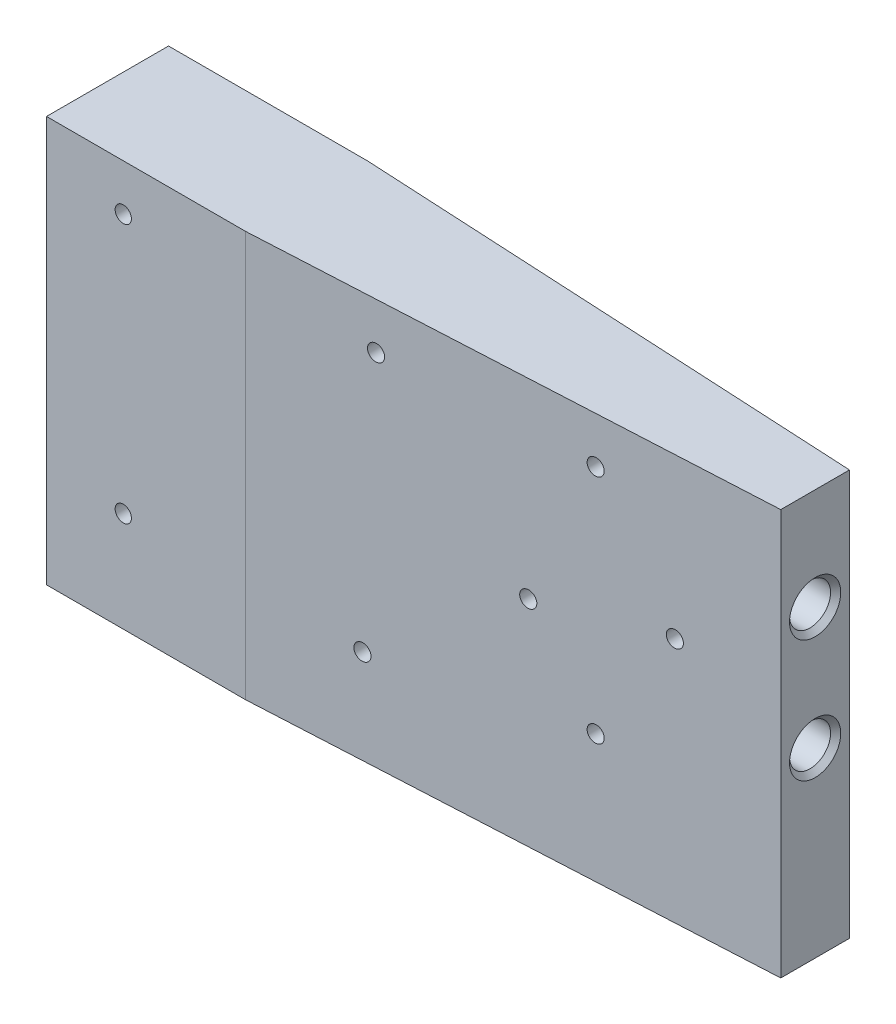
ISO-10303-21;
HEADER;
FILE_DESCRIPTION(('STEP AP214'),'2;1');
FILE_NAME('part.step','',(''),(''),'','','');
FILE_SCHEMA(('AUTOMOTIVE_DESIGN { 1 0 10303 214 1 1 1 1 }'));
ENDSEC;
DATA;
#1=APPLICATION_CONTEXT('core data for automotive mechanical design processes');
#2=APPLICATION_PROTOCOL_DEFINITION('international standard','automotive_design',2000,#1);
#3=PRODUCT_CONTEXT('',#1,'mechanical');
#4=PRODUCT('Part','Part','',(#3));
#5=PRODUCT_RELATED_PRODUCT_CATEGORY('part','',(#4));
#6=PRODUCT_DEFINITION_FORMATION('','',#4);
#7=PRODUCT_DEFINITION_CONTEXT('part definition',#1,'design');
#8=PRODUCT_DEFINITION('design','',#6,#7);
#9=PRODUCT_DEFINITION_SHAPE('','',#8);
#10=(LENGTH_UNIT() NAMED_UNIT(*) SI_UNIT(.MILLI.,.METRE.));
#11=(NAMED_UNIT(*) PLANE_ANGLE_UNIT() SI_UNIT($,.RADIAN.));
#12=(NAMED_UNIT(*) SI_UNIT($,.STERADIAN.) SOLID_ANGLE_UNIT());
#13=UNCERTAINTY_MEASURE_WITH_UNIT(LENGTH_MEASURE(1.E-05),#10,'distance_accuracy_value','');
#14=(GEOMETRIC_REPRESENTATION_CONTEXT(3) GLOBAL_UNCERTAINTY_ASSIGNED_CONTEXT((#13)) GLOBAL_UNIT_ASSIGNED_CONTEXT((#10,
#11,#12)) REPRESENTATION_CONTEXT('',''));
#15=CARTESIAN_POINT('',(0.,0.,0.));
#16=DIRECTION('',(0.,0.,1.));
#17=DIRECTION('',(1.,0.,0.));
#18=AXIS2_PLACEMENT_3D('',#15,#16,#17);
#19=CARTESIAN_POINT('',(59.7,-64.25,-2.5));
#20=DIRECTION('',(0.,0.,1.));
#21=DIRECTION('',(1.,0.,0.));
#22=AXIS2_PLACEMENT_3D('',#19,#20,#21);
#23=PLANE('',#22);
#24=CARTESIAN_POINT('',(59.7,-75.4,-2.5));
#25=DIRECTION('',(0.,0.,-1.));
#26=DIRECTION('',(-1.,0.,0.));
#27=AXIS2_PLACEMENT_3D('',#24,#25,#26);
#28=CIRCLE('',#27,1.);
#29=CARTESIAN_POINT('',(58.7,-75.4,-2.5));
#30=VERTEX_POINT('',#29);
#31=EDGE_CURVE('E1461',#30,#30,#28,.T.);
#32=ORIENTED_EDGE('',*,*,#31,.F.);
#33=EDGE_LOOP('',(#32));
#34=FACE_BOUND('',#33,.T.);
#35=CARTESIAN_POINT('',(52.3,-87.,-2.5));
#36=DIRECTION('',(0.,0.,-1.));
#37=DIRECTION('',(-1.,0.,0.));
#38=AXIS2_PLACEMENT_3D('',#35,#36,#37);
#39=CIRCLE('',#38,1.);
#40=CARTESIAN_POINT('',(51.3,-87.,-2.5));
#41=VERTEX_POINT('',#40);
#42=EDGE_CURVE('E1457',#41,#41,#39,.T.);
#43=ORIENTED_EDGE('',*,*,#42,.F.);
#44=EDGE_LOOP('',(#43));
#45=FACE_BOUND('',#44,.T.);
#46=CARTESIAN_POINT('',(52.3,-64.25,-2.5));
#47=DIRECTION('',(0.,0.,-1.));
#48=DIRECTION('',(-1.,0.,0.));
#49=AXIS2_PLACEMENT_3D('',#46,#47,#48);
#50=CIRCLE('',#49,1.);
#51=CARTESIAN_POINT('',(51.3,-64.25,-2.5));
#52=VERTEX_POINT('',#51);
#53=EDGE_CURVE('E1453',#52,#52,#50,.T.);
#54=ORIENTED_EDGE('',*,*,#53,.F.);
#55=EDGE_LOOP('',(#54));
#56=FACE_BOUND('',#55,.T.);
#57=CARTESIAN_POINT('',(31.7740209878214,-64.25,-2.5));
#58=DIRECTION('',(0.,0.,-1.));
#59=DIRECTION('',(-1.,0.,0.));
#60=AXIS2_PLACEMENT_3D('',#57,#58,#59);
#61=CIRCLE('',#60,1.);
#62=CARTESIAN_POINT('',(30.7740209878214,-64.25,-2.5));
#63=VERTEX_POINT('',#62);
#64=EDGE_CURVE('E1448',#63,#63,#61,.T.);
#65=ORIENTED_EDGE('',*,*,#64,.F.);
#66=EDGE_LOOP('',(#65));
#67=FACE_BOUND('',#66,.T.);
#68=CARTESIAN_POINT('',(30.5,-90.35,-2.5));
#69=DIRECTION('',(0.,0.,-1.));
#70=DIRECTION('',(-1.,0.,0.));
#71=AXIS2_PLACEMENT_3D('',#68,#69,#70);
#72=CIRCLE('',#71,1.);
#73=CARTESIAN_POINT('',(29.5,-90.35,-2.5));
#74=VERTEX_POINT('',#73);
#75=EDGE_CURVE('E1443',#74,#74,#72,.T.);
#76=ORIENTED_EDGE('',*,*,#75,.F.);
#77=EDGE_LOOP('',(#76));
#78=FACE_BOUND('',#77,.T.);
#79=CARTESIAN_POINT('',(7.55000000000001,-89.75,-2.5));
#80=DIRECTION('',(0.,0.,-1.));
#81=DIRECTION('',(-1.,0.,0.));
#82=AXIS2_PLACEMENT_3D('',#79,#80,#81);
#83=CIRCLE('',#82,1.);
#84=CARTESIAN_POINT('',(6.55000000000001,-89.75,-2.5));
#85=VERTEX_POINT('',#84);
#86=EDGE_CURVE('E1438',#85,#85,#83,.T.);
#87=ORIENTED_EDGE('',*,*,#86,.F.);
#88=EDGE_LOOP('',(#87));
#89=FACE_BOUND('',#88,.T.);
#90=CARTESIAN_POINT('',(59.7,-64.25,-2.5));
#91=DIRECTION('',(0.,0.,1.));
#92=DIRECTION('',(1.,0.,0.));
#93=AXIS2_PLACEMENT_3D('',#90,#91,#92);
#94=CIRCLE('',#93,3.20000000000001);
#95=CARTESIAN_POINT('',(62.9,-64.25,-2.5));
#96=VERTEX_POINT('',#95);
#97=CARTESIAN_POINT('',(59.7,-61.05,-2.5));
#98=VERTEX_POINT('',#97);
#99=EDGE_CURVE('E846',#96,#98,#94,.T.);
#100=ORIENTED_EDGE('',*,*,#99,.F.);
#101=DIRECTION('',(0.,1.,0.));
#102=VECTOR('',#101,1.);
#103=CARTESIAN_POINT('',(62.9,-89.75,-2.5));
#104=LINE('',#103,#102);
#105=CARTESIAN_POINT('',(62.9,-89.75,-2.5));
#106=VERTEX_POINT('',#105);
#107=EDGE_CURVE('E851',#106,#96,#104,.T.);
#108=ORIENTED_EDGE('',*,*,#107,.F.);
#109=CARTESIAN_POINT('',(59.7,-89.75,-2.5));
#110=DIRECTION('',(0.,0.,1.));
#111=DIRECTION('',(1.,0.,0.));
#112=AXIS2_PLACEMENT_3D('',#109,#110,#111);
#113=CIRCLE('',#112,3.20000000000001);
#114=CARTESIAN_POINT('',(59.7,-92.95,-2.5));
#115=VERTEX_POINT('',#114);
#116=EDGE_CURVE('E881',#115,#106,#113,.T.);
#117=ORIENTED_EDGE('',*,*,#116,.F.);
#118=DIRECTION('',(1.,0.,0.));
#119=VECTOR('',#118,1.);
#120=CARTESIAN_POINT('',(7.55000000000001,-92.95,-2.5));
#121=LINE('',#120,#119);
#122=CARTESIAN_POINT('',(7.55,-92.95,-2.5));
#123=VERTEX_POINT('',#122);
#124=EDGE_CURVE('E878',#123,#115,#121,.T.);
#125=ORIENTED_EDGE('',*,*,#124,.F.);
#126=CARTESIAN_POINT('',(7.55000000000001,-89.75,-2.5));
#127=DIRECTION('',(0.,0.,1.));
#128=DIRECTION('',(1.,0.,0.));
#129=AXIS2_PLACEMENT_3D('',#126,#127,#128);
#130=CIRCLE('',#129,3.20000000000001);
#131=CARTESIAN_POINT('',(4.35,-89.75,-2.5));
#132=VERTEX_POINT('',#131);
#133=EDGE_CURVE('E875',#132,#123,#130,.T.);
#134=ORIENTED_EDGE('',*,*,#133,.F.);
#135=DIRECTION('',(0.,-1.,0.));
#136=VECTOR('',#135,1.);
#137=CARTESIAN_POINT('',(4.35000000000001,-64.25,-2.5));
#138=LINE('',#137,#136);
#139=CARTESIAN_POINT('',(4.35,-64.25,-2.5));
#140=VERTEX_POINT('',#139);
#141=EDGE_CURVE('E872',#140,#132,#138,.T.);
#142=ORIENTED_EDGE('',*,*,#141,.F.);
#143=CARTESIAN_POINT('',(7.55000000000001,-64.25,-2.5));
#144=DIRECTION('',(0.,0.,1.));
#145=DIRECTION('',(1.,0.,0.));
#146=AXIS2_PLACEMENT_3D('',#143,#144,#145);
#147=CIRCLE('',#146,3.2);
#148=CARTESIAN_POINT('',(7.55000000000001,-61.05,-2.5));
#149=VERTEX_POINT('',#148);
#150=EDGE_CURVE('E869',#149,#140,#147,.T.);
#151=ORIENTED_EDGE('',*,*,#150,.F.);
#152=DIRECTION('',(-1.,0.,0.));
#153=VECTOR('',#152,1.);
#154=CARTESIAN_POINT('',(59.7,-61.05,-2.5));
#155=LINE('',#154,#153);
#156=EDGE_CURVE('E866',#98,#149,#155,.T.);
#157=ORIENTED_EDGE('',*,*,#156,.F.);
#158=EDGE_LOOP('',(#100,#108,#117,#125,#134,#142,#151,#157));
#159=FACE_BOUND('',#158,.T.);
#160=DIRECTION('',(-1.,0.,0.));
#161=VECTOR('',#160,1.);
#162=CARTESIAN_POINT('',(55.5,-66.7,-2.5));
#163=LINE('',#162,#161);
#164=CARTESIAN_POINT('',(55.5,-66.7,-2.5));
#165=VERTEX_POINT('',#164);
#166=CARTESIAN_POINT('',(31.9778636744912,-66.7,-2.5));
#167=VERTEX_POINT('',#166);
#168=EDGE_CURVE('E805',#165,#167,#163,.T.);
#169=ORIENTED_EDGE('',*,*,#168,.T.);
#170=CARTESIAN_POINT('',(31.9778636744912,-65.7,-2.5));
#171=DIRECTION('',(0.,0.,1.));
#172=DIRECTION('',(1.,0.,0.));
#173=AXIS2_PLACEMENT_3D('',#170,#171,#172);
#174=CIRCLE('',#173,1.);
#175=CARTESIAN_POINT('',(31.2592259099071,-66.3953846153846,-2.5));
#176=VERTEX_POINT('',#175);
#177=EDGE_CURVE('E1335',#167,#176,#174,.F.);
#178=ORIENTED_EDGE('',*,*,#177,.T.);
#179=CARTESIAN_POINT('',(20.3,-77.,-2.5));
#180=DIRECTION('',(0.,0.,1.));
#181=DIRECTION('',(1.,0.,0.));
#182=AXIS2_PLACEMENT_3D('',#179,#180,#181);
#183=CIRCLE('',#182,15.25);
#184=CARTESIAN_POINT('',(29.8453261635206,-88.8932438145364,-2.5));
#185=VERTEX_POINT('',#184);
#186=EDGE_CURVE('E808',#176,#185,#183,.T.);
#187=ORIENTED_EDGE('',*,*,#186,.T.);
#188=CARTESIAN_POINT('',(30.4712491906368,-89.6731286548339,-2.5));
#189=DIRECTION('',(0.,0.,1.));
#190=DIRECTION('',(1.,0.,0.));
#191=AXIS2_PLACEMENT_3D('',#188,#189,#190);
#192=CIRCLE('',#191,1.);
#193=CARTESIAN_POINT('',(31.0730642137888,-88.8744931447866,-2.5));
#194=VERTEX_POINT('',#193);
#195=EDGE_CURVE('E1339',#185,#194,#192,.F.);
#196=ORIENTED_EDGE('',*,*,#195,.T.);
#197=DIRECTION('',(0.798635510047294,-0.601815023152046,0.));
#198=VECTOR('',#197,1.);
#199=CARTESIAN_POINT('',(30.4357583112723,-88.3942487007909,-2.5));
#200=LINE('',#199,#198);
#201=CARTESIAN_POINT('',(34.4836342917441,-91.4445420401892,-2.5));
#202=VERTEX_POINT('',#201);
#203=EDGE_CURVE('E811',#194,#202,#200,.T.);
#204=ORIENTED_EDGE('',*,*,#203,.T.);
#205=CARTESIAN_POINT('',(36.8908943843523,-88.25,-2.5));
#206=DIRECTION('',(0.,0.,1.));
#207=DIRECTION('',(1.,0.,0.));
#208=AXIS2_PLACEMENT_3D('',#205,#206,#207);
#209=CIRCLE('',#208,4.00000000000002);
#210=CARTESIAN_POINT('',(39.0769411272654,-91.5998059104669,-2.5));
#211=VERTEX_POINT('',#210);
#212=EDGE_CURVE('E813',#202,#211,#209,.T.);
#213=ORIENTED_EDGE('',*,*,#212,.T.);
#214=DIRECTION('',(0.837451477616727,0.546511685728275,0.));
#215=VECTOR('',#214,1.);
#216=CARTESIAN_POINT('',(39.0769411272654,-91.5998059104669,-2.5));
#217=LINE('',#216,#215);
#218=CARTESIAN_POINT('',(44.7507489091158,-87.8971409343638,-2.5));
#219=VERTEX_POINT('',#218);
#220=EDGE_CURVE('E816',#211,#219,#217,.T.);
#221=ORIENTED_EDGE('',*,*,#220,.T.);
#222=CARTESIAN_POINT('',(55.5,-104.368840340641,-2.5));
#223=DIRECTION('',(0.,0.,-1.));
#224=DIRECTION('',(1.,0.,0.));
#225=AXIS2_PLACEMENT_3D('',#222,#223,#224);
#226=CIRCLE('',#225,19.6688403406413);
#227=CARTESIAN_POINT('',(55.5,-84.7,-2.5));
#228=VERTEX_POINT('',#227);
#229=EDGE_CURVE('E819',#219,#228,#226,.T.);
#230=ORIENTED_EDGE('',*,*,#229,.T.);
#231=CARTESIAN_POINT('',(55.5,-81.7,-2.5));
#232=DIRECTION('',(0.,0.,1.));
#233=DIRECTION('',(1.,0.,0.));
#234=AXIS2_PLACEMENT_3D('',#231,#232,#233);
#235=CIRCLE('',#234,2.99999999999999);
#236=CARTESIAN_POINT('',(56.1865794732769,-78.7796218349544,-2.5));
#237=VERTEX_POINT('',#236);
#238=EDGE_CURVE('E823',#228,#237,#235,.T.);
#239=ORIENTED_EDGE('',*,*,#238,.T.);
#240=CARTESIAN_POINT('',(56.4639079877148,-77.6,-2.5));
#241=DIRECTION('',(0.,0.,-1.));
#242=DIRECTION('',(1.,0.,0.));
#243=AXIS2_PLACEMENT_3D('',#240,#241,#242);
#244=CIRCLE('',#243,1.21178330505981);
#245=CARTESIAN_POINT('',(56.1865794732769,-76.4203781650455,-2.5));
#246=VERTEX_POINT('',#245);
#247=EDGE_CURVE('E826',#237,#246,#244,.T.);
#248=ORIENTED_EDGE('',*,*,#247,.T.);
#249=CARTESIAN_POINT('',(55.5,-73.5,-2.5));
#250=DIRECTION('',(0.,0.,1.));
#251=DIRECTION('',(1.,0.,0.));
#252=AXIS2_PLACEMENT_3D('',#249,#250,#251);
#253=CIRCLE('',#252,2.99999999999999);
#254=CARTESIAN_POINT('',(58.1399573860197,-72.075,-2.5));
#255=VERTEX_POINT('',#254);
#256=EDGE_CURVE('E782',#246,#255,#253,.T.);
#257=ORIENTED_EDGE('',*,*,#256,.T.);
#258=CARTESIAN_POINT('',(59.0199431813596,-71.6,-2.5));
#259=DIRECTION('',(0.,0.,1.));
#260=DIRECTION('',(1.,0.,0.));
#261=AXIS2_PLACEMENT_3D('',#258,#259,#260);
#262=CIRCLE('',#261,1.);
#263=CARTESIAN_POINT('',(58.1399573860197,-71.125,-2.5));
#264=VERTEX_POINT('',#263);
#265=EDGE_CURVE('E1336',#255,#264,#262,.F.);
#266=ORIENTED_EDGE('',*,*,#265,.T.);
#267=CARTESIAN_POINT('',(55.5,-69.7,-2.5));
#268=DIRECTION('',(0.,0.,1.));
#269=DIRECTION('',(1.,0.,0.));
#270=AXIS2_PLACEMENT_3D('',#267,#268,#269);
#271=CIRCLE('',#270,3.);
#272=EDGE_CURVE('E778',#264,#165,#271,.T.);
#273=ORIENTED_EDGE('',*,*,#272,.T.);
#274=EDGE_LOOP('',(#169,#178,#187,#196,#204,#213,#221,#230,#239,#248,#257,#266,#273));
#275=FACE_BOUND('',#274,.T.);
#276=CARTESIAN_POINT('',(7.55000000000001,-64.25,-2.5));
#277=DIRECTION('',(0.,0.,-1.));
#278=DIRECTION('',(-1.,0.,0.));
#279=AXIS2_PLACEMENT_3D('',#276,#277,#278);
#280=CIRCLE('',#279,1.);
#281=CARTESIAN_POINT('',(6.55000000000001,-64.25,-2.5));
#282=VERTEX_POINT('',#281);
#283=EDGE_CURVE('E1502',#282,#282,#280,.T.);
#284=ORIENTED_EDGE('',*,*,#283,.F.);
#285=EDGE_LOOP('',(#284));
#286=FACE_BOUND('',#285,.T.);
#287=ADVANCED_FACE('F57',(#34,#45,#56,#67,#78,#89,#159,#275,#286),#23,.F.);
#288=CARTESIAN_POINT('',(19.5809830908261,-170.226907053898,-6.));
#289=DIRECTION('',(0.0523359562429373,0.,-0.998629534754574));
#290=DIRECTION('',(-0.998629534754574,0.,-0.0523359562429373));
#291=AXIS2_PLACEMENT_3D('',#288,#289,#290);
#292=PLANE('',#291);
#293=DIRECTION('',(-0.998629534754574,0.,-0.0523359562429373));
#294=VECTOR('',#293,1.);
#295=CARTESIAN_POINT('',(19.5809830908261,-92.95,-6.));
#296=LINE('',#295,#294);
#297=CARTESIAN_POINT('',(59.7,-92.95,-3.89745141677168));
#298=VERTEX_POINT('',#297);
#299=CARTESIAN_POINT('',(19.5809830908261,-92.95,-6.00000000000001));
#300=VERTEX_POINT('',#299);
#301=EDGE_CURVE('E954',#298,#300,#296,.T.);
#302=ORIENTED_EDGE('',*,*,#301,.F.);
#303=CARTESIAN_POINT('',(59.7,-89.75,-3.89745141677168));
#304=DIRECTION('',(0.0523359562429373,0.,-0.998629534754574));
#305=DIRECTION('',(0.998629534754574,0.,0.0523359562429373));
#306=AXIS2_PLACEMENT_3D('',#303,#304,#305);
#307=ELLIPSE('',#306,3.20439150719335,3.20000000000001);
#308=CARTESIAN_POINT('',(62.9,-89.75,-3.72974652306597));
#309=VERTEX_POINT('',#308);
#310=EDGE_CURVE('E2385',#309,#298,#307,.T.);
#311=ORIENTED_EDGE('',*,*,#310,.F.);
#312=DIRECTION('',(0.,-1.,0.));
#313=VECTOR('',#312,1.);
#314=CARTESIAN_POINT('',(62.9,-170.226907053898,-3.72974652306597));
#315=LINE('',#314,#313);
#316=CARTESIAN_POINT('',(62.9,-64.25,-3.72974652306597));
#317=VERTEX_POINT('',#316);
#318=EDGE_CURVE('E2381',#317,#309,#315,.T.);
#319=ORIENTED_EDGE('',*,*,#318,.F.);
#320=CARTESIAN_POINT('',(59.7,-64.25,-3.89745141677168));
#321=DIRECTION('',(0.0523359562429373,0.,-0.998629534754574));
#322=DIRECTION('',(0.998629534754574,0.,0.0523359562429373));
#323=AXIS2_PLACEMENT_3D('',#320,#321,#322);
#324=ELLIPSE('',#323,3.20439150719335,3.20000000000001);
#325=CARTESIAN_POINT('',(59.7,-61.05,-3.89745141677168));
#326=VERTEX_POINT('',#325);
#327=EDGE_CURVE('E2378',#326,#317,#324,.T.);
#328=ORIENTED_EDGE('',*,*,#327,.F.);
#329=DIRECTION('',(0.998629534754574,0.,0.0523359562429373));
#330=VECTOR('',#329,1.);
#331=CARTESIAN_POINT('',(19.5809830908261,-61.05,-6.));
#332=LINE('',#331,#330);
#333=CARTESIAN_POINT('',(19.5809830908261,-61.05,-6.00000000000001));
#334=VERTEX_POINT('',#333);
#335=EDGE_CURVE('E952',#334,#326,#332,.T.);
#336=ORIENTED_EDGE('',*,*,#335,.F.);
#337=DIRECTION('',(0.,1.,0.));
#338=VECTOR('',#337,1.);
#339=CARTESIAN_POINT('',(19.5809830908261,-170.226907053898,-6.));
#340=LINE('',#339,#338);
#341=CARTESIAN_POINT('',(19.5809830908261,-59.7,-6.));
#342=VERTEX_POINT('',#341);
#343=EDGE_CURVE('E1075',#334,#342,#340,.T.);
#344=ORIENTED_EDGE('',*,*,#343,.T.);
#345=DIRECTION('',(-0.998629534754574,0.,-0.0523359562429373));
#346=VECTOR('',#345,1.);
#347=CARTESIAN_POINT('',(19.5809830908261,-59.7,-6.));
#348=LINE('',#347,#346);
#349=CARTESIAN_POINT('',(69.6,-59.7,-3.37861440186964));
#350=VERTEX_POINT('',#349);
#351=EDGE_CURVE('E1045',#350,#342,#348,.T.);
#352=ORIENTED_EDGE('',*,*,#351,.F.);
#353=DIRECTION('',(0.,1.,0.));
#354=VECTOR('',#353,1.);
#355=CARTESIAN_POINT('',(69.6,-170.226907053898,-3.37861440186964));
#356=LINE('',#355,#354);
#357=CARTESIAN_POINT('',(69.6,-99.6,-3.37861440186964));
#358=VERTEX_POINT('',#357);
#359=EDGE_CURVE('E1049',#358,#350,#356,.T.);
#360=ORIENTED_EDGE('',*,*,#359,.F.);
#361=DIRECTION('',(0.998629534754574,0.,0.0523359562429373));
#362=VECTOR('',#361,1.);
#363=CARTESIAN_POINT('',(19.5809830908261,-99.6,-6.));
#364=LINE('',#363,#362);
#365=CARTESIAN_POINT('',(19.5809830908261,-99.6,-6.));
#366=VERTEX_POINT('',#365);
#367=EDGE_CURVE('E1055',#366,#358,#364,.T.);
#368=ORIENTED_EDGE('',*,*,#367,.F.);
#369=EDGE_CURVE('E1085',#366,#300,#340,.T.);
#370=ORIENTED_EDGE('',*,*,#369,.T.);
#371=EDGE_LOOP('',(#302,#311,#319,#328,#336,#344,#352,#360,#368,#370));
#372=FACE_BOUND('',#371,.T.);
#373=ADVANCED_FACE('F1209',(#372),#292,.T.);
#374=CARTESIAN_POINT('',(0.,-170.226907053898,-6.00000000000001));
#375=DIRECTION('',(0.,0.,-1.));
#376=DIRECTION('',(-1.,0.,0.));
#377=AXIS2_PLACEMENT_3D('',#374,#375,#376);
#378=PLANE('',#377);
#379=DIRECTION('',(1.,0.,0.));
#380=VECTOR('',#379,1.);
#381=CARTESIAN_POINT('',(7.55000000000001,-92.95,-6.00000000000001));
#382=LINE('',#381,#380);
#383=CARTESIAN_POINT('',(7.55,-92.95,-6.00000000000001));
#384=VERTEX_POINT('',#383);
#385=EDGE_CURVE('E860',#384,#300,#382,.T.);
#386=ORIENTED_EDGE('',*,*,#385,.T.);
#387=ORIENTED_EDGE('',*,*,#369,.F.);
#388=DIRECTION('',(1.,0.,0.));
#389=VECTOR('',#388,1.);
#390=CARTESIAN_POINT('',(0.,-99.6,-6.00000000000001));
#391=LINE('',#390,#389);
#392=CARTESIAN_POINT('',(0.,-99.6,-6.00000000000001));
#393=VERTEX_POINT('',#392);
#394=EDGE_CURVE('E1057',#393,#366,#391,.T.);
#395=ORIENTED_EDGE('',*,*,#394,.F.);
#396=DIRECTION('',(0.,1.,0.));
#397=VECTOR('',#396,1.);
#398=CARTESIAN_POINT('',(0.,-170.226907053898,-6.00000000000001));
#399=LINE('',#398,#397);
#400=CARTESIAN_POINT('',(0.,-59.7,-6.00000000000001));
#401=VERTEX_POINT('',#400);
#402=EDGE_CURVE('E1083',#393,#401,#399,.T.);
#403=ORIENTED_EDGE('',*,*,#402,.T.);
#404=DIRECTION('',(-1.,0.,0.));
#405=VECTOR('',#404,1.);
#406=CARTESIAN_POINT('',(0.,-59.7,-6.00000000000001));
#407=LINE('',#406,#405);
#408=EDGE_CURVE('E1060',#342,#401,#407,.T.);
#409=ORIENTED_EDGE('',*,*,#408,.F.);
#410=ORIENTED_EDGE('',*,*,#343,.F.);
#411=DIRECTION('',(-1.,0.,0.));
#412=VECTOR('',#411,1.);
#413=CARTESIAN_POINT('',(59.7,-61.05,-6.00000000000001));
#414=LINE('',#413,#412);
#415=CARTESIAN_POINT('',(7.55000000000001,-61.05,-6.00000000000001));
#416=VERTEX_POINT('',#415);
#417=EDGE_CURVE('E847',#334,#416,#414,.T.);
#418=ORIENTED_EDGE('',*,*,#417,.T.);
#419=CARTESIAN_POINT('',(7.55000000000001,-64.25,-6.00000000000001));
#420=DIRECTION('',(0.,0.,1.));
#421=DIRECTION('',(1.,0.,0.));
#422=AXIS2_PLACEMENT_3D('',#419,#420,#421);
#423=CIRCLE('',#422,3.2);
#424=CARTESIAN_POINT('',(4.35,-64.25,-6.00000000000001));
#425=VERTEX_POINT('',#424);
#426=EDGE_CURVE('E850',#416,#425,#423,.T.);
#427=ORIENTED_EDGE('',*,*,#426,.T.);
#428=DIRECTION('',(0.,-1.,0.));
#429=VECTOR('',#428,1.);
#430=CARTESIAN_POINT('',(4.35000000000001,-64.25,-6.00000000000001));
#431=LINE('',#430,#429);
#432=CARTESIAN_POINT('',(4.35,-89.75,-6.00000000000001));
#433=VERTEX_POINT('',#432);
#434=EDGE_CURVE('E854',#425,#433,#431,.T.);
#435=ORIENTED_EDGE('',*,*,#434,.T.);
#436=CARTESIAN_POINT('',(7.55000000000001,-89.75,-6.00000000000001));
#437=DIRECTION('',(0.,0.,1.));
#438=DIRECTION('',(1.,0.,0.));
#439=AXIS2_PLACEMENT_3D('',#436,#437,#438);
#440=CIRCLE('',#439,3.20000000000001);
#441=EDGE_CURVE('E857',#433,#384,#440,.T.);
#442=ORIENTED_EDGE('',*,*,#441,.T.);
#443=EDGE_LOOP('',(#386,#387,#395,#403,#409,#410,#418,#427,#435,#442));
#444=FACE_BOUND('',#443,.T.);
#445=ADVANCED_FACE('F1199',(#444),#378,.T.);
#446=CARTESIAN_POINT('',(55.5,-70.2,-6.00000000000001));
#447=DIRECTION('',(0.,-1.,0.));
#448=DIRECTION('',(1.,0.,0.));
#449=AXIS2_PLACEMENT_3D('',#446,#447,#448);
#450=PLANE('',#449);
#451=DIRECTION('',(-1.,0.,0.));
#452=VECTOR('',#451,1.);
#453=CARTESIAN_POINT('',(55.5,-70.2,-2.5));
#454=LINE('',#453,#452);
#455=CARTESIAN_POINT('',(55.5,-70.2,-2.5));
#456=VERTEX_POINT('',#455);
#457=CARTESIAN_POINT('',(32.7668560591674,-70.2,-2.5));
#458=VERTEX_POINT('',#457);
#459=EDGE_CURVE('E926',#456,#458,#454,.T.);
#460=ORIENTED_EDGE('',*,*,#459,.T.);
#461=DIRECTION('',(0.,0.,1.));
#462=VECTOR('',#461,1.);
#463=CARTESIAN_POINT('',(32.7668560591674,-70.2,-1.7));
#464=LINE('',#463,#462);
#465=CARTESIAN_POINT('',(32.7668560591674,-70.2,-1.7));
#466=VERTEX_POINT('',#465);
#467=EDGE_CURVE('E1373',#458,#466,#464,.T.);
#468=ORIENTED_EDGE('',*,*,#467,.T.);
#469=DIRECTION('',(1.,0.,0.));
#470=VECTOR('',#469,1.);
#471=CARTESIAN_POINT('',(55.5,-70.2,-1.7));
#472=LINE('',#471,#470);
#473=CARTESIAN_POINT('',(55.5,-70.2,-1.7));
#474=VERTEX_POINT('',#473);
#475=EDGE_CURVE('E1037',#466,#474,#472,.T.);
#476=ORIENTED_EDGE('',*,*,#475,.T.);
#477=DIRECTION('',(0.,0.,1.));
#478=VECTOR('',#477,1.);
#479=CARTESIAN_POINT('',(55.5,-70.2,-6.00000000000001));
#480=LINE('',#479,#478);
#481=EDGE_CURVE('E1019',#456,#474,#480,.T.);
#482=ORIENTED_EDGE('',*,*,#481,.F.);
#483=EDGE_LOOP('',(#460,#468,#476,#482));
#484=FACE_BOUND('',#483,.T.);
#485=ADVANCED_FACE('F1196',(#484),#450,.F.);
#486=CARTESIAN_POINT('',(69.6,-170.226907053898,-3.37861440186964));
#487=DIRECTION('',(1.,0.,0.));
#488=DIRECTION('',(0.,0.,-1.));
#489=AXIS2_PLACEMENT_3D('',#486,#487,#488);
#490=PLANE('',#489);
#491=CARTESIAN_POINT('',(69.6,-81.7,0.));
#492=DIRECTION('',(1.,0.,0.));
#493=DIRECTION('',(0.,0.,-1.));
#494=AXIS2_PLACEMENT_3D('',#491,#492,#493);
#495=CIRCLE('',#494,2.51968);
#496=CARTESIAN_POINT('',(69.6,-81.7,-2.51968));
#497=VERTEX_POINT('',#496);
#498=EDGE_CURVE('E2360',#497,#497,#495,.T.);
#499=ORIENTED_EDGE('',*,*,#498,.F.);
#500=EDGE_LOOP('',(#499));
#501=FACE_BOUND('',#500,.T.);
#502=CARTESIAN_POINT('',(69.6,-69.7,0.));
#503=DIRECTION('',(1.,0.,0.));
#504=DIRECTION('',(0.,0.,-1.));
#505=AXIS2_PLACEMENT_3D('',#502,#503,#504);
#506=CIRCLE('',#505,2.51968);
#507=CARTESIAN_POINT('',(69.6,-69.7,-2.51968));
#508=VERTEX_POINT('',#507);
#509=EDGE_CURVE('E1472',#508,#508,#506,.T.);
#510=ORIENTED_EDGE('',*,*,#509,.F.);
#511=EDGE_LOOP('',(#510));
#512=FACE_BOUND('',#511,.T.);
#513=DIRECTION('',(0.,0.,1.));
#514=VECTOR('',#513,1.);
#515=CARTESIAN_POINT('',(69.6,-99.6,-3.37861440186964));
#516=LINE('',#515,#514);
#517=CARTESIAN_POINT('',(69.6,-99.6,3.37861440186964));
#518=VERTEX_POINT('',#517);
#519=EDGE_CURVE('E1053',#358,#518,#516,.T.);
#520=ORIENTED_EDGE('',*,*,#519,.F.);
#521=ORIENTED_EDGE('',*,*,#359,.T.);
#522=DIRECTION('',(0.,0.,-1.));
#523=VECTOR('',#522,1.);
#524=CARTESIAN_POINT('',(69.6,-59.7,-3.37861440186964));
#525=LINE('',#524,#523);
#526=CARTESIAN_POINT('',(69.6,-59.7,3.37861440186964));
#527=VERTEX_POINT('',#526);
#528=EDGE_CURVE('E1072',#527,#350,#525,.T.);
#529=ORIENTED_EDGE('',*,*,#528,.F.);
#530=DIRECTION('',(0.,1.,0.));
#531=VECTOR('',#530,1.);
#532=CARTESIAN_POINT('',(69.6,-170.226907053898,3.37861440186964));
#533=LINE('',#532,#531);
#534=EDGE_CURVE('E1077',#518,#527,#533,.T.);
#535=ORIENTED_EDGE('',*,*,#534,.F.);
#536=EDGE_LOOP('',(#520,#521,#529,#535));
#537=FACE_BOUND('',#536,.T.);
#538=ADVANCED_FACE('F1198',(#501,#512,#537),#490,.T.);
#539=CARTESIAN_POINT('',(69.6,-170.226907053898,3.37861440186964));
#540=DIRECTION('',(0.0523359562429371,0.,0.998629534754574));
#541=DIRECTION('',(0.998629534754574,0.,-0.0523359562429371));
#542=AXIS2_PLACEMENT_3D('',#539,#540,#541);
#543=PLANE('',#542);
#544=CARTESIAN_POINT('',(59.7,-75.4,3.89745141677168));
#545=DIRECTION('',(0.0523359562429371,0.,0.998629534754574));
#546=DIRECTION('',(0.998629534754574,0.,-0.0523359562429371));
#547=AXIS2_PLACEMENT_3D('',#544,#545,#546);
#548=ELLIPSE('',#547,0.801097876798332,0.799999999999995);
#549=CARTESIAN_POINT('',(60.5,-75.4,3.85552519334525));
#550=VERTEX_POINT('',#549);
#551=EDGE_CURVE('E1455',#550,#550,#548,.T.);
#552=ORIENTED_EDGE('',*,*,#551,.F.);
#553=EDGE_LOOP('',(#552));
#554=FACE_BOUND('',#553,.T.);
#555=CARTESIAN_POINT('',(52.3,-87.,4.28526898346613));
#556=DIRECTION('',(0.0523359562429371,0.,0.998629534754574));
#557=DIRECTION('',(0.998629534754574,0.,-0.0523359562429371));
#558=AXIS2_PLACEMENT_3D('',#555,#556,#557);
#559=ELLIPSE('',#558,0.801097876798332,0.799999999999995);
#560=CARTESIAN_POINT('',(53.1,-87.,4.2433427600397));
#561=VERTEX_POINT('',#560);
#562=EDGE_CURVE('E1450',#561,#561,#559,.T.);
#563=ORIENTED_EDGE('',*,*,#562,.F.);
#564=EDGE_LOOP('',(#563));
#565=FACE_BOUND('',#564,.T.);
#566=CARTESIAN_POINT('',(52.3,-64.25,4.28526898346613));
#567=DIRECTION('',(0.0523359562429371,0.,0.998629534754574));
#568=DIRECTION('',(0.998629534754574,0.,-0.0523359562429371));
#569=AXIS2_PLACEMENT_3D('',#566,#567,#568);
#570=ELLIPSE('',#569,0.801097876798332,0.799999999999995);
#571=CARTESIAN_POINT('',(53.1,-64.25,4.2433427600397));
#572=VERTEX_POINT('',#571);
#573=EDGE_CURVE('E1445',#572,#572,#570,.T.);
#574=ORIENTED_EDGE('',*,*,#573,.F.);
#575=EDGE_LOOP('',(#574));
#576=FACE_BOUND('',#575,.T.);
#577=CARTESIAN_POINT('',(31.7740209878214,-64.25,5.36098996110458));
#578=DIRECTION('',(0.0523359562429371,0.,0.998629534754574));
#579=DIRECTION('',(0.998629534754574,0.,-0.0523359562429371));
#580=AXIS2_PLACEMENT_3D('',#577,#578,#579);
#581=ELLIPSE('',#580,0.801097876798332,0.799999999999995);
#582=CARTESIAN_POINT('',(32.5740209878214,-64.25,5.31906373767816));
#583=VERTEX_POINT('',#582);
#584=EDGE_CURVE('E1440',#583,#583,#581,.T.);
#585=ORIENTED_EDGE('',*,*,#584,.F.);
#586=EDGE_LOOP('',(#585));
#587=FACE_BOUND('',#586,.T.);
#588=CARTESIAN_POINT('',(30.5,-90.35,5.42775857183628));
#589=DIRECTION('',(0.0523359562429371,0.,0.998629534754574));
#590=DIRECTION('',(0.998629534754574,0.,-0.0523359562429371));
#591=AXIS2_PLACEMENT_3D('',#588,#589,#590);
#592=ELLIPSE('',#591,0.801097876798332,0.799999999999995);
#593=CARTESIAN_POINT('',(31.3,-90.35,5.38583234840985));
#594=VERTEX_POINT('',#593);
#595=EDGE_CURVE('E1435',#594,#594,#592,.T.);
#596=ORIENTED_EDGE('',*,*,#595,.F.);
#597=EDGE_LOOP('',(#596));
#598=FACE_BOUND('',#597,.T.);
#599=CARTESIAN_POINT('',(46.,-78.5,4.61543799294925));
#600=DIRECTION('',(0.0523359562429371,0.,0.998629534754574));
#601=DIRECTION('',(0.998629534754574,0.,-0.0523359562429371));
#602=AXIS2_PLACEMENT_3D('',#599,#600,#601);
#603=ELLIPSE('',#602,0.801097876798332,0.799999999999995);
#604=CARTESIAN_POINT('',(46.8,-78.5,4.57351176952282));
#605=VERTEX_POINT('',#604);
#606=EDGE_CURVE('E652',#605,#605,#603,.T.);
#607=ORIENTED_EDGE('',*,*,#606,.F.);
#608=EDGE_LOOP('',(#607));
#609=FACE_BOUND('',#608,.T.);
#610=DIRECTION('',(-0.998629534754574,0.,0.0523359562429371));
#611=VECTOR('',#610,1.);
#612=CARTESIAN_POINT('',(69.6,-99.6,3.37861440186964));
#613=LINE('',#612,#611);
#614=CARTESIAN_POINT('',(19.5809830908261,-99.6,5.99999999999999));
#615=VERTEX_POINT('',#614);
#616=EDGE_CURVE('E1051',#518,#615,#613,.T.);
#617=ORIENTED_EDGE('',*,*,#616,.F.);
#618=ORIENTED_EDGE('',*,*,#534,.T.);
#619=DIRECTION('',(0.998629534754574,0.,-0.0523359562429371));
#620=VECTOR('',#619,1.);
#621=CARTESIAN_POINT('',(69.6,-59.7,3.37861440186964));
#622=LINE('',#621,#620);
#623=CARTESIAN_POINT('',(19.5809830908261,-59.7,5.99999999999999));
#624=VERTEX_POINT('',#623);
#625=EDGE_CURVE('E1069',#624,#527,#622,.T.);
#626=ORIENTED_EDGE('',*,*,#625,.F.);
#627=DIRECTION('',(0.,1.,0.));
#628=VECTOR('',#627,1.);
#629=CARTESIAN_POINT('',(19.5809830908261,-170.226907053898,5.99999999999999));
#630=LINE('',#629,#628);
#631=EDGE_CURVE('E1079',#615,#624,#630,.T.);
#632=ORIENTED_EDGE('',*,*,#631,.F.);
#633=EDGE_LOOP('',(#617,#618,#626,#632));
#634=FACE_BOUND('',#633,.T.);
#635=ADVANCED_FACE('F2064',(#554,#565,#576,#587,#598,#609,#634),#543,.T.);
#636=CARTESIAN_POINT('',(19.5809830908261,-170.226907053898,5.99999999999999));
#637=DIRECTION('',(0.,0.,1.));
#638=DIRECTION('',(1.,0.,0.));
#639=AXIS2_PLACEMENT_3D('',#636,#637,#638);
#640=PLANE('',#639);
#641=CARTESIAN_POINT('',(7.55000000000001,-89.75,6.00000000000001));
#642=DIRECTION('',(0.,0.,-1.));
#643=DIRECTION('',(-1.,0.,0.));
#644=AXIS2_PLACEMENT_3D('',#641,#642,#643);
#645=CIRCLE('',#644,0.799999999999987);
#646=CARTESIAN_POINT('',(6.75000000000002,-89.75,6.00000000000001));
#647=VERTEX_POINT('',#646);
#648=EDGE_CURVE('E1499',#647,#647,#645,.T.);
#649=ORIENTED_EDGE('',*,*,#648,.T.);
#650=EDGE_LOOP('',(#649));
#651=FACE_BOUND('',#650,.T.);
#652=CARTESIAN_POINT('',(7.55000000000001,-64.25,6.00000000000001));
#653=DIRECTION('',(0.,0.,-1.));
#654=DIRECTION('',(-1.,0.,0.));
#655=AXIS2_PLACEMENT_3D('',#652,#653,#654);
#656=CIRCLE('',#655,0.799999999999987);
#657=CARTESIAN_POINT('',(6.75000000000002,-64.25,6.00000000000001));
#658=VERTEX_POINT('',#657);
#659=EDGE_CURVE('E1508',#658,#658,#656,.T.);
#660=ORIENTED_EDGE('',*,*,#659,.T.);
#661=EDGE_LOOP('',(#660));
#662=FACE_BOUND('',#661,.T.);
#663=DIRECTION('',(-1.,0.,0.));
#664=VECTOR('',#663,1.);
#665=CARTESIAN_POINT('',(19.5809830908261,-99.6,5.99999999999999));
#666=LINE('',#665,#664);
#667=CARTESIAN_POINT('',(0.,-99.6,5.99999999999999));
#668=VERTEX_POINT('',#667);
#669=EDGE_CURVE('E1048',#615,#668,#666,.T.);
#670=ORIENTED_EDGE('',*,*,#669,.F.);
#671=ORIENTED_EDGE('',*,*,#631,.T.);
#672=DIRECTION('',(1.,0.,0.));
#673=VECTOR('',#672,1.);
#674=CARTESIAN_POINT('',(19.5809830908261,-59.7,5.99999999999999));
#675=LINE('',#674,#673);
#676=CARTESIAN_POINT('',(0.,-59.7,5.99999999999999));
#677=VERTEX_POINT('',#676);
#678=EDGE_CURVE('E1066',#677,#624,#675,.T.);
#679=ORIENTED_EDGE('',*,*,#678,.F.);
#680=DIRECTION('',(0.,1.,0.));
#681=VECTOR('',#680,1.);
#682=CARTESIAN_POINT('',(0.,-170.226907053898,5.99999999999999));
#683=LINE('',#682,#681);
#684=EDGE_CURVE('E1081',#668,#677,#683,.T.);
#685=ORIENTED_EDGE('',*,*,#684,.F.);
#686=EDGE_LOOP('',(#670,#671,#679,#685));
#687=FACE_BOUND('',#686,.T.);
#688=ADVANCED_FACE('F2069',(#651,#662,#687),#640,.T.);
#689=CARTESIAN_POINT('',(0.,-170.226907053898,-6.00000000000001));
#690=DIRECTION('',(-1.,0.,0.));
#691=DIRECTION('',(0.,0.,1.));
#692=AXIS2_PLACEMENT_3D('',#689,#690,#691);
#693=PLANE('',#692);
#694=DIRECTION('',(0.,0.,-1.));
#695=VECTOR('',#694,1.);
#696=CARTESIAN_POINT('',(0.,-99.6,-6.00000000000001));
#697=LINE('',#696,#695);
#698=EDGE_CURVE('E1046',#668,#393,#697,.T.);
#699=ORIENTED_EDGE('',*,*,#698,.F.);
#700=ORIENTED_EDGE('',*,*,#684,.T.);
#701=DIRECTION('',(0.,0.,1.));
#702=VECTOR('',#701,1.);
#703=CARTESIAN_POINT('',(0.,-59.7,-6.00000000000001));
#704=LINE('',#703,#702);
#705=EDGE_CURVE('E1063',#401,#677,#704,.T.);
#706=ORIENTED_EDGE('',*,*,#705,.F.);
#707=ORIENTED_EDGE('',*,*,#402,.F.);
#708=EDGE_LOOP('',(#699,#700,#706,#707));
#709=FACE_BOUND('',#708,.T.);
#710=ADVANCED_FACE('F2080',(#709),#693,.T.);
#711=CARTESIAN_POINT('',(0.,-59.7,0.));
#712=DIRECTION('',(0.,-1.,0.));
#713=DIRECTION('',(0.,0.,-1.));
#714=AXIS2_PLACEMENT_3D('',#711,#712,#713);
#715=PLANE('',#714);
#716=ORIENTED_EDGE('',*,*,#351,.T.);
#717=ORIENTED_EDGE('',*,*,#408,.T.);
#718=ORIENTED_EDGE('',*,*,#705,.T.);
#719=ORIENTED_EDGE('',*,*,#678,.T.);
#720=ORIENTED_EDGE('',*,*,#625,.T.);
#721=ORIENTED_EDGE('',*,*,#528,.T.);
#722=EDGE_LOOP('',(#716,#717,#718,#719,#720,#721));
#723=FACE_BOUND('',#722,.T.);
#724=ADVANCED_FACE('F2680',(#723),#715,.F.);
#725=CARTESIAN_POINT('',(0.,-99.6,0.));
#726=DIRECTION('',(0.,1.,0.));
#727=DIRECTION('',(0.,0.,1.));
#728=AXIS2_PLACEMENT_3D('',#725,#726,#727);
#729=PLANE('',#728);
#730=ORIENTED_EDGE('',*,*,#367,.T.);
#731=ORIENTED_EDGE('',*,*,#519,.T.);
#732=ORIENTED_EDGE('',*,*,#616,.T.);
#733=ORIENTED_EDGE('',*,*,#669,.T.);
#734=ORIENTED_EDGE('',*,*,#698,.T.);
#735=ORIENTED_EDGE('',*,*,#394,.T.);
#736=EDGE_LOOP('',(#730,#731,#732,#733,#734,#735));
#737=FACE_BOUND('',#736,.T.);
#738=ADVANCED_FACE('F1206',(#737),#729,.F.);
#739=CARTESIAN_POINT('',(55.5,-69.7,-6.00000000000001));
#740=DIRECTION('',(0.,0.,1.));
#741=DIRECTION('',(1.,0.,0.));
#742=AXIS2_PLACEMENT_3D('',#739,#740,#741);
#743=CYLINDRICAL_SURFACE('',#742,0.500000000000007);
#744=CARTESIAN_POINT('',(55.,-69.7,-0.799999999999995));
#745=CARTESIAN_POINT('',(55.0000017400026,-69.7254041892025,-0.799998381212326));
#746=CARTESIAN_POINT('',(55.001949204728,-69.7508385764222,-0.798777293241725));
#747=CARTESIAN_POINT('',(55.0096343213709,-69.8009273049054,-0.794008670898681));
#748=CARTESIAN_POINT('',(55.0153791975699,-69.8255800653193,-0.790456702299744));
#749=CARTESIAN_POINT('',(55.0303245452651,-69.873282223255,-0.781383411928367));
#750=CARTESIAN_POINT('',(55.0395079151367,-69.8963388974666,-0.775871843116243));
#751=CARTESIAN_POINT('',(55.0609543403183,-69.9405041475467,-0.763338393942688));
#752=CARTESIAN_POINT('',(55.0732170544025,-69.9616129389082,-0.756316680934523));
#753=CARTESIAN_POINT('',(55.1015546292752,-70.0031896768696,-0.740680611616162));
#754=CARTESIAN_POINT('',(55.1178557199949,-70.0234718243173,-0.731983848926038));
#755=CARTESIAN_POINT('',(55.1532876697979,-70.0611945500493,-0.714125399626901));
#756=CARTESIAN_POINT('',(55.1724223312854,-70.0786312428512,-0.704963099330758));
#757=CARTESIAN_POINT('',(55.2160135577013,-70.1125714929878,-0.685721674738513));
#758=CARTESIAN_POINT('',(55.2408399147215,-70.1286288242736,-0.675686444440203));
#759=CARTESIAN_POINT('',(55.2934259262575,-70.1562958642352,-0.657320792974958));
#760=CARTESIAN_POINT('',(55.32118052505,-70.1679130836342,-0.648987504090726));
#761=CARTESIAN_POINT('',(55.3715242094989,-70.1837336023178,-0.637238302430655));
#762=CARTESIAN_POINT('',(55.3935867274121,-70.1890782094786,-0.633107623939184));
#763=CARTESIAN_POINT('',(55.4385223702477,-70.1967273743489,-0.627125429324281));
#764=CARTESIAN_POINT('',(55.4613943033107,-70.1990362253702,-0.62527069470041));
#765=CARTESIAN_POINT('',(55.5073652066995,-70.200475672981,-0.624119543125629));
#766=CARTESIAN_POINT('',(55.5304646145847,-70.1995979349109,-0.624829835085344));
#767=CARTESIAN_POINT('',(55.5761240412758,-70.1947052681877,-0.628709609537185));
#768=CARTESIAN_POINT('',(55.5986836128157,-70.1906878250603,-0.63188106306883));
#769=CARTESIAN_POINT('',(55.6421753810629,-70.1798724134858,-0.640130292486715));
#770=CARTESIAN_POINT('',(55.6631329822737,-70.1731400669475,-0.645162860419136));
#771=CARTESIAN_POINT('',(55.7036644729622,-70.1571607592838,-0.656582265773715));
#772=CARTESIAN_POINT('',(55.7232378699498,-70.1479129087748,-0.662969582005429));
#773=CARTESIAN_POINT('',(55.7643333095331,-70.1251795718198,-0.677819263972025));
#774=CARTESIAN_POINT('',(55.7855363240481,-70.1112251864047,-0.686446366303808));
#775=CARTESIAN_POINT('',(55.8255321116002,-70.0803525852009,-0.704022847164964));
#776=CARTESIAN_POINT('',(55.8443223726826,-70.0634313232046,-0.712972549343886));
#777=CARTESIAN_POINT('',(55.8821206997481,-70.0238078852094,-0.731919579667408));
#778=CARTESIAN_POINT('',(55.9006531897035,-70.0006125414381,-0.741846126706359));
#779=CARTESIAN_POINT('',(55.9335403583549,-69.9508592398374,-0.760112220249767));
#780=CARTESIAN_POINT('',(55.9478966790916,-69.9243026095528,-0.768452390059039));
#781=CARTESIAN_POINT('',(55.9711054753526,-69.8699534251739,-0.782213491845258));
#782=CARTESIAN_POINT('',(55.9802136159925,-69.8423053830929,-0.787767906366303));
#783=CARTESIAN_POINT('',(55.9935059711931,-69.78544486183,-0.795939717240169));
#784=CARTESIAN_POINT('',(55.9976971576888,-69.7562346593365,-0.798561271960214));
#785=CARTESIAN_POINT('',(56.0006263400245,-69.7018062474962,-0.800391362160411));
#786=CARTESIAN_POINT('',(56.0000812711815,-69.6766388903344,-0.800048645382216));
#787=CARTESIAN_POINT('',(55.9952468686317,-69.6268111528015,-0.797035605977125));
#788=CARTESIAN_POINT('',(55.9909577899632,-69.6021507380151,-0.7943654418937));
#789=CARTESIAN_POINT('',(55.9791045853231,-69.5549915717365,-0.787096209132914));
#790=CARTESIAN_POINT('',(55.971675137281,-69.5324459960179,-0.782576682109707));
#791=CARTESIAN_POINT('',(55.953881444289,-69.4889446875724,-0.771982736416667));
#792=CARTESIAN_POINT('',(55.9435167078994,-69.4679892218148,-0.765908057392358));
#793=CARTESIAN_POINT('',(55.9189939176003,-69.4259663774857,-0.751960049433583));
#794=CARTESIAN_POINT('',(55.9045585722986,-69.4051012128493,-0.743967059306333));
#795=CARTESIAN_POINT('',(55.872882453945,-69.3659429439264,-0.72722787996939));
#796=CARTESIAN_POINT('',(55.8556385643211,-69.3476527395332,-0.718480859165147));
#797=CARTESIAN_POINT('',(55.8159459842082,-69.3114103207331,-0.699623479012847));
#798=CARTESIAN_POINT('',(55.7931051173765,-69.2938925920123,-0.689499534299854));
#799=CARTESIAN_POINT('',(55.7444496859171,-69.2628785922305,-0.67026705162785));
#800=CARTESIAN_POINT('',(55.718637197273,-69.2493795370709,-0.661157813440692));
#801=CARTESIAN_POINT('',(55.6701231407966,-69.2292609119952,-0.646934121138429));
#802=CARTESIAN_POINT('',(55.6479036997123,-69.2217924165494,-0.641382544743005));
#803=CARTESIAN_POINT('',(55.6022427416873,-69.2099995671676,-0.632420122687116));
#804=CARTESIAN_POINT('',(55.578803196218,-69.2056703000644,-0.629005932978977));
#805=CARTESIAN_POINT('',(55.5311638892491,-69.2003944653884,-0.6248252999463));
#806=CARTESIAN_POINT('',(55.5069605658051,-69.1994672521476,-0.624074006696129));
#807=CARTESIAN_POINT('',(55.4587476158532,-69.2011208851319,-0.625396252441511));
#808=CARTESIAN_POINT('',(55.434738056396,-69.2037028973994,-0.627470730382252));
#809=CARTESIAN_POINT('',(55.3895880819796,-69.2118469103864,-0.633821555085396));
#810=CARTESIAN_POINT('',(55.3683722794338,-69.2171523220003,-0.637907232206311));
#811=CARTESIAN_POINT('',(55.3271459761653,-69.2303295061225,-0.647670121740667));
#812=CARTESIAN_POINT('',(55.3071359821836,-69.2382023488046,-0.653347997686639));
#813=CARTESIAN_POINT('',(55.2657613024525,-69.2575892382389,-0.666655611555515));
#814=CARTESIAN_POINT('',(55.2446198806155,-69.2694654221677,-0.674448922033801));
#815=CARTESIAN_POINT('',(55.2044246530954,-69.2959999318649,-0.690670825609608));
#816=CARTESIAN_POINT('',(55.1853725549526,-69.3106605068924,-0.699099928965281));
#817=CARTESIAN_POINT('',(55.1459942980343,-69.3457319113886,-0.717607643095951));
#818=CARTESIAN_POINT('',(55.1261636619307,-69.3667065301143,-0.727682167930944));
#819=CARTESIAN_POINT('',(55.0902020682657,-69.4120710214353,-0.746794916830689));
#820=CARTESIAN_POINT('',(55.0740734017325,-69.4364629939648,-0.755832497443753));
#821=CARTESIAN_POINT('',(55.0460915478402,-69.4882578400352,-0.77194684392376));
#822=CARTESIAN_POINT('',(55.03424559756,-69.5156657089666,-0.779020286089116));
#823=CARTESIAN_POINT('',(55.0155712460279,-69.5726421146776,-0.790326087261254));
#824=CARTESIAN_POINT('',(55.0087251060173,-69.602202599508,-0.794568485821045));
#825=CARTESIAN_POINT('',(55.003080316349,-69.6434326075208,-0.798077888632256));
#826=CARTESIAN_POINT('',(55.0019272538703,-69.6547005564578,-0.798796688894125));
#827=CARTESIAN_POINT('',(55.0003866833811,-69.6773103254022,-0.799758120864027));
#828=CARTESIAN_POINT('',(54.9999992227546,-69.6886521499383,-0.800000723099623));
#829=CARTESIAN_POINT('',(55.,-69.7,-0.799999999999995));
#830=B_SPLINE_CURVE_WITH_KNOTS('',3,(#744,#745,#746,#747,#748,#749,#750,#751,#752,#753,#754,
#755,#756,#757,#758,#759,#760,#761,#762,#763,#764,#765,#766,#767,#768,#769,#770,#771,#772,#773,
#774,#775,#776,#777,#778,#779,#780,#781,#782,#783,#784,#785,#786,#787,#788,#789,#790,#791,#792,
#793,#794,#795,#796,#797,#798,#799,#800,#801,#802,#803,#804,#805,#806,#807,#808,#809,#810,#811,
#812,#813,#814,#815,#816,#817,#818,#819,#820,#821,#822,#823,#824,#825,#826,#827,#828,#829),
.UNSPECIFIED.,.T.,.F.,(4,2,2,2,2,2,2,2,2,2,2,2,2,2,2,2,2,2,2,2,2,2,2,2,2,2,2,2,2,2,2,2,2,2,2,2,
2,2,2,2,2,2,4),(0.,0.076164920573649,0.152475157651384,0.228410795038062,0.304338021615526,
0.386328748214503,0.468430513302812,0.561651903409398,0.654714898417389,0.723648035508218,
0.792483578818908,0.861499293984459,0.930570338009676,0.998063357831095,1.06558027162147,
1.14570980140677,1.22592209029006,1.31936872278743,1.41277856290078,1.50113669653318,
1.58936939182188,1.66450872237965,1.73964293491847,1.81183801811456,1.88404519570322,
1.96354092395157,2.04312547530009,2.13426283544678,2.22533690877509,2.29731976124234,
2.36918970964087,2.44146789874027,2.51377011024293,2.58025267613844,2.64676298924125,
2.72290209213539,2.79910296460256,2.89040215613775,2.98175769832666,3.07326690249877,
3.16444984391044,3.19847000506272,3.23249227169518),.UNSPECIFIED.);
#831=CARTESIAN_POINT('',(55.,-69.7,-0.799999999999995));
#832=VERTEX_POINT('',#831);
#833=EDGE_CURVE('E1095',#832,#832,#830,.T.);
#834=ORIENTED_EDGE('',*,*,#833,.T.);
#835=EDGE_LOOP('',(#834));
#836=FACE_BOUND('',#835,.T.);
#837=DIRECTION('',(0.,0.,1.));
#838=VECTOR('',#837,1.);
#839=CARTESIAN_POINT('',(55.5,-69.2,-6.00000000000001));
#840=LINE('',#839,#838);
#841=CARTESIAN_POINT('',(55.5,-69.2,-2.5));
#842=VERTEX_POINT('',#841);
#843=CARTESIAN_POINT('',(55.5,-69.2,-1.7));
#844=VERTEX_POINT('',#843);
#845=EDGE_CURVE('E1039',#842,#844,#840,.T.);
#846=ORIENTED_EDGE('',*,*,#845,.F.);
#847=CARTESIAN_POINT('',(55.5,-69.7,-2.5));
#848=DIRECTION('',(0.,0.,1.));
#849=DIRECTION('',(1.,0.,0.));
#850=AXIS2_PLACEMENT_3D('',#847,#848,#849);
#851=CIRCLE('',#850,0.500000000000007);
#852=EDGE_CURVE('E923',#842,#456,#851,.F.);
#853=ORIENTED_EDGE('',*,*,#852,.T.);
#854=ORIENTED_EDGE('',*,*,#481,.T.);
#855=CARTESIAN_POINT('',(55.5,-69.7,-1.7));
#856=DIRECTION('',(0.,0.,-1.));
#857=DIRECTION('',(-1.,0.,0.));
#858=AXIS2_PLACEMENT_3D('',#855,#856,#857);
#859=CIRCLE('',#858,0.500000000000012);
#860=EDGE_CURVE('E1092',#474,#844,#859,.T.);
#861=ORIENTED_EDGE('',*,*,#860,.T.);
#862=EDGE_LOOP('',(#846,#853,#854,#861));
#863=FACE_BOUND('',#862,.T.);
#864=ADVANCED_FACE('F1110',(#836,#863),#743,.F.);
#865=CARTESIAN_POINT('',(30.3857572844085,-69.2,-6.00000000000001));
#866=DIRECTION('',(0.,1.,0.));
#867=DIRECTION('',(-1.,0.,0.));
#868=AXIS2_PLACEMENT_3D('',#865,#866,#867);
#869=PLANE('',#868);
#870=DIRECTION('',(-1.,0.,0.));
#871=VECTOR('',#870,1.);
#872=CARTESIAN_POINT('',(30.3857572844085,-69.2,-1.7));
#873=LINE('',#872,#871);
#874=CARTESIAN_POINT('',(30.8651549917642,-69.2,-1.7));
#875=VERTEX_POINT('',#874);
#876=EDGE_CURVE('E970',#844,#875,#873,.T.);
#877=ORIENTED_EDGE('',*,*,#876,.T.);
#878=DIRECTION('',(0.,0.,1.));
#879=VECTOR('',#878,1.);
#880=CARTESIAN_POINT('',(30.8651549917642,-69.2,-2.5));
#881=LINE('',#880,#879);
#882=CARTESIAN_POINT('',(30.8651549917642,-69.2,-2.5));
#883=VERTEX_POINT('',#882);
#884=EDGE_CURVE('E1357',#875,#883,#881,.F.);
#885=ORIENTED_EDGE('',*,*,#884,.T.);
#886=DIRECTION('',(1.,0.,0.));
#887=VECTOR('',#886,1.);
#888=CARTESIAN_POINT('',(30.3857572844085,-69.2,-2.5));
#889=LINE('',#888,#887);
#890=EDGE_CURVE('E921',#883,#842,#889,.T.);
#891=ORIENTED_EDGE('',*,*,#890,.T.);
#892=ORIENTED_EDGE('',*,*,#845,.T.);
#893=EDGE_LOOP('',(#877,#885,#891,#892));
#894=FACE_BOUND('',#893,.T.);
#895=ADVANCED_FACE('F1172',(#894),#869,.F.);
#896=CARTESIAN_POINT('',(55.5,-104.368840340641,-6.00000000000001));
#897=DIRECTION('',(0.,0.,1.));
#898=DIRECTION('',(1.,0.,0.));
#899=AXIS2_PLACEMENT_3D('',#896,#897,#898);
#900=CYLINDRICAL_SURFACE('',#899,23.1688403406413);
#901=DIRECTION('',(0.,0.,1.));
#902=VECTOR('',#901,1.);
#903=CARTESIAN_POINT('',(42.8379580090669,-84.9660607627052,-6.00000000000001));
#904=LINE('',#903,#902);
#905=CARTESIAN_POINT('',(42.8379580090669,-84.9660607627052,-2.5));
#906=VERTEX_POINT('',#905);
#907=CARTESIAN_POINT('',(42.8379580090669,-84.9660607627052,-1.7));
#908=VERTEX_POINT('',#907);
#909=EDGE_CURVE('E997',#906,#908,#904,.T.);
#910=ORIENTED_EDGE('',*,*,#909,.F.);
#911=CARTESIAN_POINT('',(55.5,-104.368840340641,-2.5));
#912=DIRECTION('',(0.,0.,1.));
#913=DIRECTION('',(1.,0.,0.));
#914=AXIS2_PLACEMENT_3D('',#911,#912,#913);
#915=CIRCLE('',#914,23.1688403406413);
#916=CARTESIAN_POINT('',(55.5,-81.2,-2.5));
#917=VERTEX_POINT('',#916);
#918=EDGE_CURVE('E917',#906,#917,#915,.F.);
#919=ORIENTED_EDGE('',*,*,#918,.T.);
#920=DIRECTION('',(0.,0.,1.));
#921=VECTOR('',#920,1.);
#922=CARTESIAN_POINT('',(55.5,-81.2,-6.00000000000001));
#923=LINE('',#922,#921);
#924=CARTESIAN_POINT('',(55.5,-81.2,-1.7));
#925=VERTEX_POINT('',#924);
#926=EDGE_CURVE('E998',#917,#925,#923,.T.);
#927=ORIENTED_EDGE('',*,*,#926,.T.);
#928=CARTESIAN_POINT('',(55.5,-104.368840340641,-1.7));
#929=DIRECTION('',(0.,0.,1.));
#930=DIRECTION('',(-1.,0.,0.));
#931=AXIS2_PLACEMENT_3D('',#928,#929,#930);
#932=CIRCLE('',#931,23.1688403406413);
#933=EDGE_CURVE('E971',#925,#908,#932,.T.);
#934=ORIENTED_EDGE('',*,*,#933,.T.);
#935=EDGE_LOOP('',(#910,#919,#927,#934));
#936=FACE_BOUND('',#935,.T.);
#937=ADVANCED_FACE('F1142',(#936),#900,.F.);
#938=CARTESIAN_POINT('',(55.5,-81.7,-6.00000000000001));
#939=DIRECTION('',(0.,0.,1.));
#940=DIRECTION('',(1.,0.,0.));
#941=AXIS2_PLACEMENT_3D('',#938,#939,#940);
#942=CYLINDRICAL_SURFACE('',#941,0.499999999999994);
#943=CARTESIAN_POINT('',(55.,-81.7,-0.799999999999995));
#944=CARTESIAN_POINT('',(55.0000017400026,-81.7254041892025,-0.799998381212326));
#945=CARTESIAN_POINT('',(55.001949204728,-81.7508385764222,-0.798777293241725));
#946=CARTESIAN_POINT('',(55.009634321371,-81.8009273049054,-0.794008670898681));
#947=CARTESIAN_POINT('',(55.0153791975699,-81.8255800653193,-0.790456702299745));
#948=CARTESIAN_POINT('',(55.0303245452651,-81.873282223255,-0.781383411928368));
#949=CARTESIAN_POINT('',(55.0395079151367,-81.8963388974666,-0.775871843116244));
#950=CARTESIAN_POINT('',(55.0609543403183,-81.9405041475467,-0.763338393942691));
#951=CARTESIAN_POINT('',(55.0732170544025,-81.9616129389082,-0.756316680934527));
#952=CARTESIAN_POINT('',(55.1015546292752,-82.0031896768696,-0.740680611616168));
#953=CARTESIAN_POINT('',(55.1178557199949,-82.0234718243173,-0.731983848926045));
#954=CARTESIAN_POINT('',(55.1532876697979,-82.0611945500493,-0.714125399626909));
#955=CARTESIAN_POINT('',(55.1724223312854,-82.0786312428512,-0.704963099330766));
#956=CARTESIAN_POINT('',(55.2160135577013,-82.1125714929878,-0.68572167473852));
#957=CARTESIAN_POINT('',(55.2408399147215,-82.1286288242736,-0.675686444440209));
#958=CARTESIAN_POINT('',(55.2934259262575,-82.1562958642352,-0.657320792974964));
#959=CARTESIAN_POINT('',(55.32118052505,-82.1679130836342,-0.648987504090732));
#960=CARTESIAN_POINT('',(55.3715242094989,-82.1837336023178,-0.637238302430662));
#961=CARTESIAN_POINT('',(55.3935867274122,-82.1890782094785,-0.633107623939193));
#962=CARTESIAN_POINT('',(55.4385223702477,-82.1967273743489,-0.62712542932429));
#963=CARTESIAN_POINT('',(55.4613943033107,-82.1990362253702,-0.62527069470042));
#964=CARTESIAN_POINT('',(55.5073652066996,-82.200475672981,-0.624119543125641));
#965=CARTESIAN_POINT('',(55.5304646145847,-82.1995979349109,-0.624829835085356));
#966=CARTESIAN_POINT('',(55.5761240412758,-82.1947052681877,-0.628709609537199));
#967=CARTESIAN_POINT('',(55.5986836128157,-82.1906878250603,-0.631881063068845));
#968=CARTESIAN_POINT('',(55.6421753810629,-82.1798724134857,-0.64013029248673));
#969=CARTESIAN_POINT('',(55.6631329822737,-82.1731400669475,-0.64516286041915));
#970=CARTESIAN_POINT('',(55.7036644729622,-82.1571607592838,-0.656582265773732));
#971=CARTESIAN_POINT('',(55.7232378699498,-82.1479129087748,-0.662969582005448));
#972=CARTESIAN_POINT('',(55.7643333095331,-82.1251795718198,-0.677819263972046));
#973=CARTESIAN_POINT('',(55.7855363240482,-82.1112251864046,-0.686446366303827));
#974=CARTESIAN_POINT('',(55.8255321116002,-82.0803525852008,-0.704022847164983));
#975=CARTESIAN_POINT('',(55.8443223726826,-82.0634313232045,-0.712972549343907));
#976=CARTESIAN_POINT('',(55.8821206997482,-82.0238078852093,-0.731919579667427));
#977=CARTESIAN_POINT('',(55.9006531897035,-82.0006125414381,-0.741846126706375));
#978=CARTESIAN_POINT('',(55.9335403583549,-81.9508592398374,-0.76011222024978));
#979=CARTESIAN_POINT('',(55.9478966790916,-81.9243026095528,-0.76845239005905));
#980=CARTESIAN_POINT('',(55.9711054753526,-81.8699534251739,-0.782213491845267));
#981=CARTESIAN_POINT('',(55.9802136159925,-81.8423053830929,-0.78776790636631));
#982=CARTESIAN_POINT('',(55.9935059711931,-81.78544486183,-0.795939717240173));
#983=CARTESIAN_POINT('',(55.9976971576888,-81.7562346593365,-0.798561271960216));
#984=CARTESIAN_POINT('',(56.0006263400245,-81.7018062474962,-0.800391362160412));
#985=CARTESIAN_POINT('',(56.0000812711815,-81.6766388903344,-0.800048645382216));
#986=CARTESIAN_POINT('',(55.9952468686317,-81.6268111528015,-0.797035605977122));
#987=CARTESIAN_POINT('',(55.9909577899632,-81.6021507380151,-0.794365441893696));
#988=CARTESIAN_POINT('',(55.9791045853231,-81.5549915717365,-0.78709620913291));
#989=CARTESIAN_POINT('',(55.9716751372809,-81.5324459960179,-0.782576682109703));
#990=CARTESIAN_POINT('',(55.9538814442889,-81.4889446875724,-0.771982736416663));
#991=CARTESIAN_POINT('',(55.9435167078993,-81.4679892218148,-0.765908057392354));
#992=CARTESIAN_POINT('',(55.9189939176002,-81.4259663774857,-0.751960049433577));
#993=CARTESIAN_POINT('',(55.9045585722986,-81.4051012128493,-0.743967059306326));
#994=CARTESIAN_POINT('',(55.872882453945,-81.3659429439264,-0.727227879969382));
#995=CARTESIAN_POINT('',(55.855638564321,-81.3476527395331,-0.71848085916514));
#996=CARTESIAN_POINT('',(55.8159459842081,-81.3114103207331,-0.699623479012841));
#997=CARTESIAN_POINT('',(55.7931051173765,-81.2938925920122,-0.689499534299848));
#998=CARTESIAN_POINT('',(55.7444496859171,-81.2628785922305,-0.670267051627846));
#999=CARTESIAN_POINT('',(55.718637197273,-81.2493795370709,-0.661157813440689));
#1000=CARTESIAN_POINT('',(55.6701231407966,-81.2292609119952,-0.64693412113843));
#1001=CARTESIAN_POINT('',(55.6479036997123,-81.2217924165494,-0.641382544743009));
#1002=CARTESIAN_POINT('',(55.6022427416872,-81.2099995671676,-0.632420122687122));
#1003=CARTESIAN_POINT('',(55.578803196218,-81.2056703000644,-0.629005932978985));
#1004=CARTESIAN_POINT('',(55.5311638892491,-81.2003944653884,-0.624825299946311));
#1005=CARTESIAN_POINT('',(55.5069605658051,-81.1994672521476,-0.62407400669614));
#1006=CARTESIAN_POINT('',(55.4587476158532,-81.2011208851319,-0.625396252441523));
#1007=CARTESIAN_POINT('',(55.434738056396,-81.2037028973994,-0.627470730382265));
#1008=CARTESIAN_POINT('',(55.3895880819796,-81.2118469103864,-0.633821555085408));
#1009=CARTESIAN_POINT('',(55.3683722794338,-81.2171523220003,-0.637907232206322));
#1010=CARTESIAN_POINT('',(55.3271459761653,-81.2303295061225,-0.647670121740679));
#1011=CARTESIAN_POINT('',(55.3071359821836,-81.2382023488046,-0.653347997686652));
#1012=CARTESIAN_POINT('',(55.2657613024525,-81.2575892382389,-0.666655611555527));
#1013=CARTESIAN_POINT('',(55.2446198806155,-81.2694654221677,-0.674448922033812));
#1014=CARTESIAN_POINT('',(55.2044246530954,-81.2959999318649,-0.690670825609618));
#1015=CARTESIAN_POINT('',(55.1853725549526,-81.3106605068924,-0.699099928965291));
#1016=CARTESIAN_POINT('',(55.1459942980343,-81.3457319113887,-0.717607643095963));
#1017=CARTESIAN_POINT('',(55.1261636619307,-81.3667065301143,-0.727682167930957));
#1018=CARTESIAN_POINT('',(55.0902020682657,-81.4120710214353,-0.746794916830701));
#1019=CARTESIAN_POINT('',(55.0740734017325,-81.4364629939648,-0.755832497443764));
#1020=CARTESIAN_POINT('',(55.0460915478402,-81.4882578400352,-0.771946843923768));
#1021=CARTESIAN_POINT('',(55.03424559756,-81.5156657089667,-0.779020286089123));
#1022=CARTESIAN_POINT('',(55.0155712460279,-81.5726421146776,-0.790326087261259));
#1023=CARTESIAN_POINT('',(55.0087251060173,-81.602202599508,-0.794568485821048));
#1024=CARTESIAN_POINT('',(55.003080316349,-81.6434326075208,-0.798077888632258));
#1025=CARTESIAN_POINT('',(55.0019272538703,-81.6547005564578,-0.798796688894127));
#1026=CARTESIAN_POINT('',(55.0003866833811,-81.6773103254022,-0.799758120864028));
#1027=CARTESIAN_POINT('',(54.9999992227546,-81.6886521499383,-0.800000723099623));
#1028=CARTESIAN_POINT('',(55.,-81.7,-0.799999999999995));
#1029=B_SPLINE_CURVE_WITH_KNOTS('',3,(#943,#944,#945,#946,#947,#948,#949,#950,#951,#952,#953,
#954,#955,#956,#957,#958,#959,#960,#961,#962,#963,#964,#965,#966,#967,#968,#969,#970,#971,#972,
#973,#974,#975,#976,#977,#978,#979,#980,#981,#982,#983,#984,#985,#986,#987,#988,#989,#990,#991,
#992,#993,#994,#995,#996,#997,#998,#999,#1000,#1001,#1002,#1003,#1004,#1005,#1006,#1007,#1008,
#1009,#1010,#1011,#1012,#1013,#1014,#1015,#1016,#1017,#1018,#1019,#1020,#1021,#1022,#1023,#1024,
#1025,#1026,#1027,#1028),.UNSPECIFIED.,.T.,.F.,(4,2,2,2,2,2,2,2,2,2,2,2,2,2,2,2,2,2,2,2,2,2,2,2,
2,2,2,2,2,2,2,2,2,2,2,2,2,2,2,2,2,2,4),(0.,0.076164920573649,0.152475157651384,
0.228410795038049,0.304338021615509,0.386328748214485,0.468430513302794,0.56165190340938,
0.654714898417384,0.723648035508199,0.792483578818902,0.86149929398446,0.930570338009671,
0.998063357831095,1.06558027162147,1.14570980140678,1.22592209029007,1.31936872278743,
1.41277856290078,1.50113669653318,1.58936939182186,1.66450872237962,1.73964293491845,
1.81183801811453,1.88404519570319,1.96354092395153,2.04312547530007,2.13426283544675,
2.22533690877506,2.29731976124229,2.36918970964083,2.44146789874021,2.51377011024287,
2.58025267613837,2.64676298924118,2.72290209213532,2.7991029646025,2.8904021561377,
2.98175769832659,3.07326690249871,3.16444984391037,3.19847000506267,3.23249227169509),.UNSPECIFIED.);
#1030=CARTESIAN_POINT('',(55.,-81.7000000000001,-0.800000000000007));
#1031=VERTEX_POINT('',#1030);
#1032=EDGE_CURVE('E1103',#1031,#1031,#1029,.T.);
#1033=ORIENTED_EDGE('',*,*,#1032,.T.);
#1034=EDGE_LOOP('',(#1033));
#1035=FACE_BOUND('',#1034,.T.);
#1036=ORIENTED_EDGE('',*,*,#926,.F.);
#1037=CARTESIAN_POINT('',(55.5,-81.7,-2.5));
#1038=DIRECTION('',(0.,0.,1.));
#1039=DIRECTION('',(1.,0.,0.));
#1040=AXIS2_PLACEMENT_3D('',#1037,#1038,#1039);
#1041=CIRCLE('',#1040,0.499999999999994);
#1042=CARTESIAN_POINT('',(55.5,-82.2,-2.5));
#1043=VERTEX_POINT('',#1042);
#1044=EDGE_CURVE('E914',#917,#1043,#1041,.F.);
#1045=ORIENTED_EDGE('',*,*,#1044,.T.);
#1046=DIRECTION('',(0.,0.,1.));
#1047=VECTOR('',#1046,1.);
#1048=CARTESIAN_POINT('',(55.5,-82.2,-6.00000000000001));
#1049=LINE('',#1048,#1047);
#1050=CARTESIAN_POINT('',(55.5,-82.2,-1.7));
#1051=VERTEX_POINT('',#1050);
#1052=EDGE_CURVE('E1001',#1043,#1051,#1049,.T.);
#1053=ORIENTED_EDGE('',*,*,#1052,.T.);
#1054=CARTESIAN_POINT('',(55.5,-81.7,-1.7));
#1055=DIRECTION('',(0.,0.,-1.));
#1056=DIRECTION('',(-1.,0.,0.));
#1057=AXIS2_PLACEMENT_3D('',#1054,#1055,#1056);
#1058=CIRCLE('',#1057,0.500000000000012);
#1059=EDGE_CURVE('E1089',#1051,#925,#1058,.T.);
#1060=ORIENTED_EDGE('',*,*,#1059,.T.);
#1061=EDGE_LOOP('',(#1036,#1045,#1053,#1060));
#1062=FACE_BOUND('',#1061,.T.);
#1063=ADVANCED_FACE('F1137',(#1035,#1062),#942,.F.);
#1064=CARTESIAN_POINT('',(55.5,-104.368840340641,-6.00000000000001));
#1065=DIRECTION('',(0.,0.,1.));
#1066=DIRECTION('',(1.,0.,0.));
#1067=AXIS2_PLACEMENT_3D('',#1064,#1065,#1066);
#1068=CYLINDRICAL_SURFACE('',#1067,22.1688403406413);
#1069=ORIENTED_EDGE('',*,*,#1052,.F.);
#1070=CARTESIAN_POINT('',(55.5,-104.368840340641,-2.5));
#1071=DIRECTION('',(0.,0.,1.));
#1072=DIRECTION('',(1.,0.,0.));
#1073=AXIS2_PLACEMENT_3D('',#1070,#1071,#1072);
#1074=CIRCLE('',#1073,22.1688403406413);
#1075=CARTESIAN_POINT('',(43.3844696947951,-85.8035122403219,-2.5));
#1076=VERTEX_POINT('',#1075);
#1077=EDGE_CURVE('E910',#1043,#1076,#1074,.T.);
#1078=ORIENTED_EDGE('',*,*,#1077,.T.);
#1079=DIRECTION('',(0.,0.,1.));
#1080=VECTOR('',#1079,1.);
#1081=CARTESIAN_POINT('',(43.3844696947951,-85.8035122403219,-6.00000000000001));
#1082=LINE('',#1081,#1080);
#1083=CARTESIAN_POINT('',(43.3844696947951,-85.8035122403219,-1.7));
#1084=VERTEX_POINT('',#1083);
#1085=EDGE_CURVE('E1003',#1076,#1084,#1082,.T.);
#1086=ORIENTED_EDGE('',*,*,#1085,.T.);
#1087=CARTESIAN_POINT('',(55.5,-104.368840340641,-1.7));
#1088=DIRECTION('',(0.,0.,-1.));
#1089=DIRECTION('',(-1.,0.,0.));
#1090=AXIS2_PLACEMENT_3D('',#1087,#1088,#1089);
#1091=CIRCLE('',#1090,22.1688403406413);
#1092=EDGE_CURVE('E993',#1084,#1051,#1091,.T.);
#1093=ORIENTED_EDGE('',*,*,#1092,.T.);
#1094=EDGE_LOOP('',(#1069,#1078,#1086,#1093));
#1095=FACE_BOUND('',#1094,.T.);
#1096=ADVANCED_FACE('F1141',(#1095),#1068,.T.);
#1097=CARTESIAN_POINT('',(43.3844696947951,-85.8035122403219,-6.00000000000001));
#1098=DIRECTION('',(0.546511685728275,-0.837451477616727,0.));
#1099=DIRECTION('',(0.837451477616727,0.546511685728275,0.));
#1100=AXIS2_PLACEMENT_3D('',#1097,#1098,#1099);
#1101=PLANE('',#1100);
#1102=ORIENTED_EDGE('',*,*,#1085,.F.);
#1103=DIRECTION('',(-0.837451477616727,-0.546511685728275,0.));
#1104=VECTOR('',#1103,1.);
#1105=CARTESIAN_POINT('',(43.3844696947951,-85.8035122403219,-2.5));
#1106=LINE('',#1105,#1104);
#1107=CARTESIAN_POINT('',(37.7106619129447,-89.5061772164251,-2.5));
#1108=VERTEX_POINT('',#1107);
#1109=EDGE_CURVE('E907',#1076,#1108,#1106,.T.);
#1110=ORIENTED_EDGE('',*,*,#1109,.T.);
#1111=DIRECTION('',(0.,0.,1.));
#1112=VECTOR('',#1111,1.);
#1113=CARTESIAN_POINT('',(37.7106619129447,-89.5061772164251,-6.00000000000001));
#1114=LINE('',#1113,#1112);
#1115=CARTESIAN_POINT('',(37.7106619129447,-89.5061772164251,-1.7));
#1116=VERTEX_POINT('',#1115);
#1117=EDGE_CURVE('E1005',#1108,#1116,#1114,.T.);
#1118=ORIENTED_EDGE('',*,*,#1117,.T.);
#1119=DIRECTION('',(0.837451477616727,0.546511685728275,0.));
#1120=VECTOR('',#1119,1.);
#1121=CARTESIAN_POINT('',(43.3844696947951,-85.8035122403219,-1.7));
#1122=LINE('',#1121,#1120);
#1123=EDGE_CURVE('E990',#1116,#1084,#1122,.T.);
#1124=ORIENTED_EDGE('',*,*,#1123,.T.);
#1125=EDGE_LOOP('',(#1102,#1110,#1118,#1124));
#1126=FACE_BOUND('',#1125,.T.);
#1127=ADVANCED_FACE('F1146',(#1126),#1101,.F.);
#1128=CARTESIAN_POINT('',(36.8908943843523,-88.25,-6.00000000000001));
#1129=DIRECTION('',(0.,0.,1.));
#1130=DIRECTION('',(1.,0.,0.));
#1131=AXIS2_PLACEMENT_3D('',#1128,#1129,#1130);
#1132=CYLINDRICAL_SURFACE('',#1131,1.49999999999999);
#1133=ORIENTED_EDGE('',*,*,#1117,.F.);
#1134=CARTESIAN_POINT('',(36.8908943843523,-88.25,-2.5));
#1135=DIRECTION('',(0.,0.,1.));
#1136=DIRECTION('',(1.,0.,0.));
#1137=AXIS2_PLACEMENT_3D('',#1134,#1135,#1136);
#1138=CIRCLE('',#1137,1.49999999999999);
#1139=CARTESIAN_POINT('',(35.9881718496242,-89.4479532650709,-2.5));
#1140=VERTEX_POINT('',#1139);
#1141=EDGE_CURVE('E904',#1108,#1140,#1138,.F.);
#1142=ORIENTED_EDGE('',*,*,#1141,.T.);
#1143=DIRECTION('',(0.,0.,1.));
#1144=VECTOR('',#1143,1.);
#1145=CARTESIAN_POINT('',(35.9881718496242,-89.4479532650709,-6.00000000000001));
#1146=LINE('',#1145,#1144);
#1147=CARTESIAN_POINT('',(35.9881718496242,-89.4479532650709,-1.7));
#1148=VERTEX_POINT('',#1147);
#1149=EDGE_CURVE('E1007',#1140,#1148,#1146,.T.);
#1150=ORIENTED_EDGE('',*,*,#1149,.T.);
#1151=CARTESIAN_POINT('',(36.8908943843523,-88.25,-1.7));
#1152=DIRECTION('',(0.,0.,1.));
#1153=DIRECTION('',(-1.,0.,0.));
#1154=AXIS2_PLACEMENT_3D('',#1151,#1152,#1153);
#1155=CIRCLE('',#1154,1.49999999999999);
#1156=EDGE_CURVE('E987',#1148,#1116,#1155,.T.);
#1157=ORIENTED_EDGE('',*,*,#1156,.T.);
#1158=EDGE_LOOP('',(#1133,#1142,#1150,#1157));
#1159=FACE_BOUND('',#1158,.T.);
#1160=ADVANCED_FACE('F1150',(#1159),#1132,.F.);
#1161=CARTESIAN_POINT('',(30.1738624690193,-85.0665568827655,-6.00000000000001));
#1162=DIRECTION('',(-0.601815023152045,-0.798635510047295,0.));
#1163=DIRECTION('',(0.798635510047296,-0.601815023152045,0.));
#1164=AXIS2_PLACEMENT_3D('',#1161,#1162,#1163);
#1165=PLANE('',#1164);
#1166=DIRECTION('',(-0.798635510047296,0.601815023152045,0.));
#1167=VECTOR('',#1166,1.);
#1168=CARTESIAN_POINT('',(30.1738624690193,-85.0665568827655,-2.5));
#1169=LINE('',#1168,#1167);
#1170=CARTESIAN_POINT('',(30.9147922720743,-85.6248875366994,-2.5));
#1171=VERTEX_POINT('',#1170);
#1172=EDGE_CURVE('E888',#1140,#1171,#1169,.T.);
#1173=ORIENTED_EDGE('',*,*,#1172,.T.);
#1174=DIRECTION('',(0.,0.,1.));
#1175=VECTOR('',#1174,1.);
#1176=CARTESIAN_POINT('',(30.9147922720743,-85.6248875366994,-1.7));
#1177=LINE('',#1176,#1175);
#1178=CARTESIAN_POINT('',(30.9147922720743,-85.6248875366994,-1.7));
#1179=VERTEX_POINT('',#1178);
#1180=EDGE_CURVE('E1377',#1171,#1179,#1177,.T.);
#1181=ORIENTED_EDGE('',*,*,#1180,.T.);
#1182=DIRECTION('',(0.798635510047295,-0.601815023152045,0.));
#1183=VECTOR('',#1182,1.);
#1184=CARTESIAN_POINT('',(30.1738624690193,-85.0665568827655,-1.7));
#1185=LINE('',#1184,#1183);
#1186=EDGE_CURVE('E985',#1179,#1148,#1185,.T.);
#1187=ORIENTED_EDGE('',*,*,#1186,.T.);
#1188=ORIENTED_EDGE('',*,*,#1149,.F.);
#1189=EDGE_LOOP('',(#1173,#1181,#1187,#1188));
#1190=FACE_BOUND('',#1189,.T.);
#1191=ADVANCED_FACE('F1154',(#1190),#1165,.F.);
#1192=CARTESIAN_POINT('',(30.7756774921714,-84.2679213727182,-6.00000000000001));
#1193=DIRECTION('',(0.601815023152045,0.798635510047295,0.));
#1194=DIRECTION('',(-0.798635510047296,0.601815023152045,0.));
#1195=AXIS2_PLACEMENT_3D('',#1192,#1193,#1194);
#1196=PLANE('',#1195);
#1197=DIRECTION('',(-0.798635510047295,0.601815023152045,0.));
#1198=VECTOR('',#1197,1.);
#1199=CARTESIAN_POINT('',(30.7756774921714,-84.2679213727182,-1.7));
#1200=LINE('',#1199,#1198);
#1201=CARTESIAN_POINT('',(36.5899868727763,-88.6493177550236,-1.7));
#1202=VERTEX_POINT('',#1201);
#1203=CARTESIAN_POINT('',(31.5166072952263,-84.8262520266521,-1.7));
#1204=VERTEX_POINT('',#1203);
#1205=EDGE_CURVE('E982',#1202,#1204,#1200,.T.);
#1206=ORIENTED_EDGE('',*,*,#1205,.T.);
#1207=DIRECTION('',(0.,0.,1.));
#1208=VECTOR('',#1207,1.);
#1209=CARTESIAN_POINT('',(31.5166072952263,-84.8262520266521,-2.5));
#1210=LINE('',#1209,#1208);
#1211=CARTESIAN_POINT('',(31.5166072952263,-84.8262520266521,-2.5));
#1212=VERTEX_POINT('',#1211);
#1213=EDGE_CURVE('E1375',#1204,#1212,#1210,.F.);
#1214=ORIENTED_EDGE('',*,*,#1213,.T.);
#1215=DIRECTION('',(0.798635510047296,-0.601815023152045,0.));
#1216=VECTOR('',#1215,1.);
#1217=CARTESIAN_POINT('',(30.7756774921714,-84.2679213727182,-2.5));
#1218=LINE('',#1217,#1216);
#1219=CARTESIAN_POINT('',(36.5899868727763,-88.6493177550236,-2.5));
#1220=VERTEX_POINT('',#1219);
#1221=EDGE_CURVE('E938',#1212,#1220,#1218,.T.);
#1222=ORIENTED_EDGE('',*,*,#1221,.T.);
#1223=DIRECTION('',(0.,0.,1.));
#1224=VECTOR('',#1223,1.);
#1225=CARTESIAN_POINT('',(36.5899868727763,-88.6493177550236,-6.00000000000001));
#1226=LINE('',#1225,#1224);
#1227=EDGE_CURVE('E1010',#1220,#1202,#1226,.T.);
#1228=ORIENTED_EDGE('',*,*,#1227,.T.);
#1229=EDGE_LOOP('',(#1206,#1214,#1222,#1228));
#1230=FACE_BOUND('',#1229,.T.);
#1231=ADVANCED_FACE('F1158',(#1230),#1196,.F.);
#1232=CARTESIAN_POINT('',(36.8908943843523,-88.25,-6.00000000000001));
#1233=DIRECTION('',(0.,0.,1.));
#1234=DIRECTION('',(1.,0.,0.));
#1235=AXIS2_PLACEMENT_3D('',#1232,#1233,#1234);
#1236=CYLINDRICAL_SURFACE('',#1235,0.499999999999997);
#1237=ORIENTED_EDGE('',*,*,#1227,.F.);
#1238=CARTESIAN_POINT('',(36.8908943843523,-88.25,-2.5));
#1239=DIRECTION('',(0.,0.,1.));
#1240=DIRECTION('',(1.,0.,0.));
#1241=AXIS2_PLACEMENT_3D('',#1238,#1239,#1240);
#1242=CIRCLE('',#1241,0.499999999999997);
#1243=CARTESIAN_POINT('',(37.1641502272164,-88.6687257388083,-2.5));
#1244=VERTEX_POINT('',#1243);
#1245=EDGE_CURVE('E935',#1220,#1244,#1242,.T.);
#1246=ORIENTED_EDGE('',*,*,#1245,.T.);
#1247=DIRECTION('',(0.,0.,1.));
#1248=VECTOR('',#1247,1.);
#1249=CARTESIAN_POINT('',(37.1641502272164,-88.6687257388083,-6.00000000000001));
#1250=LINE('',#1249,#1248);
#1251=CARTESIAN_POINT('',(37.1641502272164,-88.6687257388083,-1.7));
#1252=VERTEX_POINT('',#1251);
#1253=EDGE_CURVE('E1012',#1244,#1252,#1250,.T.);
#1254=ORIENTED_EDGE('',*,*,#1253,.T.);
#1255=CARTESIAN_POINT('',(36.8908943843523,-88.25,-1.7));
#1256=DIRECTION('',(0.,0.,-1.));
#1257=DIRECTION('',(-1.,0.,0.));
#1258=AXIS2_PLACEMENT_3D('',#1255,#1256,#1257);
#1259=CIRCLE('',#1258,0.499999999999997);
#1260=EDGE_CURVE('E979',#1252,#1202,#1259,.T.);
#1261=ORIENTED_EDGE('',*,*,#1260,.T.);
#1262=EDGE_LOOP('',(#1237,#1246,#1254,#1261));
#1263=FACE_BOUND('',#1262,.T.);
#1264=ADVANCED_FACE('F1162',(#1263),#1236,.T.);
#1265=CARTESIAN_POINT('',(37.1641502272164,-88.6687257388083,-6.00000000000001));
#1266=DIRECTION('',(-0.546511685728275,0.837451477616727,0.));
#1267=DIRECTION('',(-0.837451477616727,-0.546511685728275,0.));
#1268=AXIS2_PLACEMENT_3D('',#1265,#1266,#1267);
#1269=PLANE('',#1268);
#1270=ORIENTED_EDGE('',*,*,#1253,.F.);
#1271=DIRECTION('',(0.837451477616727,0.546511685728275,0.));
#1272=VECTOR('',#1271,1.);
#1273=CARTESIAN_POINT('',(37.1641502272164,-88.6687257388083,-2.5));
#1274=LINE('',#1273,#1272);
#1275=EDGE_CURVE('E932',#1244,#906,#1274,.T.);
#1276=ORIENTED_EDGE('',*,*,#1275,.T.);
#1277=ORIENTED_EDGE('',*,*,#909,.T.);
#1278=DIRECTION('',(-0.837451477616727,-0.546511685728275,0.));
#1279=VECTOR('',#1278,1.);
#1280=CARTESIAN_POINT('',(37.1641502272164,-88.6687257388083,-1.7));
#1281=LINE('',#1280,#1279);
#1282=EDGE_CURVE('E975',#908,#1252,#1281,.T.);
#1283=ORIENTED_EDGE('',*,*,#1282,.T.);
#1284=EDGE_LOOP('',(#1270,#1276,#1277,#1283));
#1285=FACE_BOUND('',#1284,.T.);
#1286=ADVANCED_FACE('F1135',(#1285),#1269,.F.);
#1287=CARTESIAN_POINT('',(55.5,-104.368840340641,-1.7));
#1288=DIRECTION('',(0.,0.,-1.));
#1289=DIRECTION('',(-1.,0.,0.));
#1290=AXIS2_PLACEMENT_3D('',#1287,#1288,#1289);
#1291=PLANE('',#1290);
#1292=ORIENTED_EDGE('',*,*,#860,.F.);
#1293=ORIENTED_EDGE('',*,*,#475,.F.);
#1294=CARTESIAN_POINT('',(32.7668560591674,-71.2,-1.7));
#1295=DIRECTION('',(0.,0.,-1.));
#1296=DIRECTION('',(-1.,0.,0.));
#1297=AXIS2_PLACEMENT_3D('',#1294,#1295,#1296);
#1298=CIRCLE('',#1297,1.);
#1299=CARTESIAN_POINT('',(31.8601756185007,-71.6218181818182,-1.7));
#1300=VERTEX_POINT('',#1299);
#1301=EDGE_CURVE('E1417',#466,#1300,#1298,.F.);
#1302=ORIENTED_EDGE('',*,*,#1301,.T.);
#1303=CARTESIAN_POINT('',(20.3,-77.,-1.7));
#1304=DIRECTION('',(0.,0.,-1.));
#1305=DIRECTION('',(-1.,0.,0.));
#1306=AXIS2_PLACEMENT_3D('',#1303,#1304,#1305);
#1307=CIRCLE('',#1306,12.75);
#1308=CARTESIAN_POINT('',(31.2589006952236,-83.516517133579,-1.7));
#1309=VERTEX_POINT('',#1308);
#1310=EDGE_CURVE('E964',#1300,#1309,#1307,.T.);
#1311=ORIENTED_EDGE('',*,*,#1310,.T.);
#1312=CARTESIAN_POINT('',(32.1184223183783,-84.0276165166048,-1.7));
#1313=DIRECTION('',(0.,0.,-1.));
#1314=DIRECTION('',(-1.,0.,0.));
#1315=AXIS2_PLACEMENT_3D('',#1312,#1313,#1314);
#1316=CIRCLE('',#1315,1.);
#1317=EDGE_CURVE('E1419',#1309,#1204,#1316,.F.);
#1318=ORIENTED_EDGE('',*,*,#1317,.T.);
#1319=ORIENTED_EDGE('',*,*,#1205,.F.);
#1320=ORIENTED_EDGE('',*,*,#1260,.F.);
#1321=ORIENTED_EDGE('',*,*,#1282,.F.);
#1322=ORIENTED_EDGE('',*,*,#933,.F.);
#1323=ORIENTED_EDGE('',*,*,#1059,.F.);
#1324=ORIENTED_EDGE('',*,*,#1092,.F.);
#1325=ORIENTED_EDGE('',*,*,#1123,.F.);
#1326=ORIENTED_EDGE('',*,*,#1156,.F.);
#1327=ORIENTED_EDGE('',*,*,#1186,.F.);
#1328=CARTESIAN_POINT('',(30.3129772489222,-86.4235230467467,-1.7));
#1329=DIRECTION('',(0.,0.,-1.));
#1330=DIRECTION('',(-1.,0.,0.));
#1331=AXIS2_PLACEMENT_3D('',#1328,#1329,#1330);
#1332=CIRCLE('',#1331,1.);
#1333=CARTESIAN_POINT('',(29.5847607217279,-85.7381759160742,-1.7));
#1334=VERTEX_POINT('',#1333);
#1335=EDGE_CURVE('E1421',#1179,#1334,#1332,.F.);
#1336=ORIENTED_EDGE('',*,*,#1335,.T.);
#1337=CARTESIAN_POINT('',(30.0967800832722,-68.84,-1.7));
#1338=VERTEX_POINT('',#1337);
#1339=EDGE_CURVE('E963',#1334,#1338,#1307,.T.);
#1340=ORIENTED_EDGE('',*,*,#1339,.T.);
#1341=CARTESIAN_POINT('',(30.8651549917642,-68.2,-1.7));
#1342=DIRECTION('',(0.,0.,-1.));
#1343=DIRECTION('',(-1.,0.,0.));
#1344=AXIS2_PLACEMENT_3D('',#1341,#1342,#1343);
#1345=CIRCLE('',#1344,1.);
#1346=EDGE_CURVE('E1415',#1338,#875,#1345,.F.);
#1347=ORIENTED_EDGE('',*,*,#1346,.T.);
#1348=ORIENTED_EDGE('',*,*,#876,.F.);
#1349=EDGE_LOOP('',(#1292,#1293,#1302,#1311,#1318,#1319,#1320,#1321,#1322,#1323,#1324,#1325,
#1326,#1327,#1336,#1340,#1347,#1348));
#1350=FACE_BOUND('',#1349,.T.);
#1351=CARTESIAN_POINT('',(20.3,-77.,-1.7));
#1352=DIRECTION('',(0.,0.,-1.));
#1353=DIRECTION('',(-1.,0.,0.));
#1354=AXIS2_PLACEMENT_3D('',#1351,#1352,#1353);
#1355=CIRCLE('',#1354,11.75);
#1356=CARTESIAN_POINT('',(8.55000000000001,-77.,-1.7));
#1357=VERTEX_POINT('',#1356);
#1358=EDGE_CURVE('E967',#1357,#1357,#1355,.T.);
#1359=ORIENTED_EDGE('',*,*,#1358,.F.);
#1360=EDGE_LOOP('',(#1359));
#1361=FACE_BOUND('',#1360,.T.);
#1362=ADVANCED_FACE('F1133',(#1350,#1361),#1291,.T.);
#1363=CARTESIAN_POINT('',(20.3,-77.,34.3624458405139));
#1364=DIRECTION('',(0.,0.,-1.));
#1365=DIRECTION('',(-1.,0.,0.));
#1366=AXIS2_PLACEMENT_3D('',#1363,#1364,#1365);
#1367=CYLINDRICAL_SURFACE('',#1366,12.75);
#1368=ORIENTED_EDGE('',*,*,#1310,.F.);
#1369=DIRECTION('',(0.,0.,-1.));
#1370=VECTOR('',#1369,1.);
#1371=CARTESIAN_POINT('',(31.8601756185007,-71.6218181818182,34.3624458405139));
#1372=LINE('',#1371,#1370);
#1373=CARTESIAN_POINT('',(31.8601756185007,-71.6218181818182,-2.5));
#1374=VERTEX_POINT('',#1373);
#1375=EDGE_CURVE('E1370',#1300,#1374,#1372,.T.);
#1376=ORIENTED_EDGE('',*,*,#1375,.T.);
#1377=CARTESIAN_POINT('',(20.3,-77.,-2.5));
#1378=DIRECTION('',(0.,0.,1.));
#1379=DIRECTION('',(1.,0.,0.));
#1380=AXIS2_PLACEMENT_3D('',#1377,#1378,#1379);
#1381=CIRCLE('',#1380,12.75);
#1382=CARTESIAN_POINT('',(31.2589006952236,-83.516517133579,-2.5));
#1383=VERTEX_POINT('',#1382);
#1384=EDGE_CURVE('E929',#1383,#1374,#1381,.T.);
#1385=ORIENTED_EDGE('',*,*,#1384,.F.);
#1386=DIRECTION('',(0.,0.,-1.));
#1387=VECTOR('',#1386,1.);
#1388=CARTESIAN_POINT('',(31.2589006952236,-83.516517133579,34.3624458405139));
#1389=LINE('',#1388,#1387);
#1390=EDGE_CURVE('E1367',#1383,#1309,#1389,.F.);
#1391=ORIENTED_EDGE('',*,*,#1390,.T.);
#1392=EDGE_LOOP('',(#1368,#1376,#1385,#1391));
#1393=FACE_BOUND('',#1392,.T.);
#1394=ADVANCED_FACE('F1131',(#1393),#1367,.F.);
#1395=CARTESIAN_POINT('',(20.3,-77.,-2.5));
#1396=DIRECTION('',(0.,0.,1.));
#1397=DIRECTION('',(1.,0.,0.));
#1398=AXIS2_PLACEMENT_3D('',#1395,#1396,#1397);
#1399=CIRCLE('',#1398,12.75);
#1400=CARTESIAN_POINT('',(30.0967800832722,-68.84,-2.5));
#1401=VERTEX_POINT('',#1400);
#1402=CARTESIAN_POINT('',(29.5847607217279,-85.7381759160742,-2.5));
#1403=VERTEX_POINT('',#1402);
#1404=EDGE_CURVE('E2376',#1401,#1403,#1399,.T.);
#1405=ORIENTED_EDGE('',*,*,#1404,.F.);
#1406=DIRECTION('',(0.,0.,-1.));
#1407=VECTOR('',#1406,1.);
#1408=CARTESIAN_POINT('',(30.0967800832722,-68.84,34.3624458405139));
#1409=LINE('',#1408,#1407);
#1410=EDGE_CURVE('E1354',#1401,#1338,#1409,.F.);
#1411=ORIENTED_EDGE('',*,*,#1410,.T.);
#1412=ORIENTED_EDGE('',*,*,#1339,.F.);
#1413=DIRECTION('',(0.,0.,-1.));
#1414=VECTOR('',#1413,1.);
#1415=CARTESIAN_POINT('',(29.5847607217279,-85.7381759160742,34.3624458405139));
#1416=LINE('',#1415,#1414);
#1417=EDGE_CURVE('E1352',#1334,#1403,#1416,.T.);
#1418=ORIENTED_EDGE('',*,*,#1417,.T.);
#1419=EDGE_LOOP('',(#1405,#1411,#1412,#1418));
#1420=FACE_BOUND('',#1419,.T.);
#1421=ADVANCED_FACE('F1127',(#1420),#1367,.F.);
#1422=CARTESIAN_POINT('',(0.,0.,0.));
#1423=DIRECTION('',(0.,0.,1.));
#1424=DIRECTION('',(1.,0.,0.));
#1425=AXIS2_PLACEMENT_3D('',#1422,#1423,#1424);
#1426=PLANE('',#1425);
#1427=CARTESIAN_POINT('',(20.3,-77.,0.));
#1428=DIRECTION('',(0.,0.,1.));
#1429=DIRECTION('',(1.,0.,0.));
#1430=AXIS2_PLACEMENT_3D('',#1427,#1428,#1429);
#1431=CIRCLE('',#1430,11.75);
#1432=CARTESIAN_POINT('',(32.05,-77.,0.));
#1433=VERTEX_POINT('',#1432);
#1434=EDGE_CURVE('E1000',#1433,#1433,#1431,.T.);
#1435=ORIENTED_EDGE('',*,*,#1434,.F.);
#1436=EDGE_LOOP('',(#1435));
#1437=FACE_BOUND('',#1436,.T.);
#1438=ADVANCED_FACE('F1130',(#1437),#1426,.F.);
#1439=CARTESIAN_POINT('',(20.3,-77.,33.2340187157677));
#1440=DIRECTION('',(0.,0.,-1.));
#1441=DIRECTION('',(-1.,0.,0.));
#1442=AXIS2_PLACEMENT_3D('',#1439,#1440,#1441);
#1443=CYLINDRICAL_SURFACE('',#1442,11.75);
#1444=ORIENTED_EDGE('',*,*,#1434,.T.);
#1445=EDGE_LOOP('',(#1444));
#1446=FACE_BOUND('',#1445,.T.);
#1447=ORIENTED_EDGE('',*,*,#1358,.T.);
#1448=EDGE_LOOP('',(#1447));
#1449=FACE_BOUND('',#1448,.T.);
#1450=ADVANCED_FACE('F1120',(#1446,#1449),#1443,.F.);
#1451=CARTESIAN_POINT('',(69.6,-69.7,0.));
#1452=DIRECTION('',(1.,0.,0.));
#1453=DIRECTION('',(0.,0.,-1.));
#1454=AXIS2_PLACEMENT_3D('',#1451,#1452,#1453);
#1455=CYLINDRICAL_SURFACE('',#1454,0.799999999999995);
#1456=CARTESIAN_POINT('',(60.8673706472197,-69.7,0.));
#1457=DIRECTION('',(1.,0.,0.));
#1458=DIRECTION('',(0.,0.,-1.));
#1459=AXIS2_PLACEMENT_3D('',#1456,#1457,#1458);
#1460=CIRCLE('',#1459,0.799999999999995);
#1461=CARTESIAN_POINT('',(60.8673706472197,-69.7,-0.799999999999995));
#1462=VERTEX_POINT('',#1461);
#1463=EDGE_CURVE('E1459',#1462,#1462,#1460,.T.);
#1464=ORIENTED_EDGE('',*,*,#1463,.T.);
#1465=EDGE_LOOP('',(#1464));
#1466=FACE_BOUND('',#1465,.T.);
#1467=CARTESIAN_POINT('',(55.,-69.7,0.));
#1468=DIRECTION('',(1.,0.,0.));
#1469=DIRECTION('',(0.,0.,-1.));
#1470=AXIS2_PLACEMENT_3D('',#1467,#1468,#1469);
#1471=CIRCLE('',#1470,0.799999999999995);
#1472=EDGE_CURVE('E960',#832,#832,#1471,.T.);
#1473=ORIENTED_EDGE('',*,*,#1472,.F.);
#1474=ORIENTED_EDGE('',*,*,#833,.F.);
#1475=EDGE_LOOP('',(#1473,#1474));
#1476=FACE_BOUND('',#1475,.T.);
#1477=ADVANCED_FACE('F1114',(#1466,#1476),#1455,.F.);
#1478=CARTESIAN_POINT('',(55.,-69.7,0.));
#1479=DIRECTION('',(1.,0.,0.));
#1480=DIRECTION('',(0.,0.,-1.));
#1481=AXIS2_PLACEMENT_3D('',#1478,#1479,#1480);
#1482=CONICAL_SURFACE('',#1481,0.799999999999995,1.02974425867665);
#1483=CARTESIAN_POINT('',(54.5193115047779,-69.7,0.));
#1484=VERTEX_POINT('',#1483);
#1485=VERTEX_LOOP('',#1484);
#1486=FACE_BOUND('',#1485,.T.);
#1487=ORIENTED_EDGE('',*,*,#1472,.T.);
#1488=EDGE_LOOP('',(#1487));
#1489=FACE_BOUND('',#1488,.T.);
#1490=ADVANCED_FACE('F1119',(#1486,#1489),#1482,.F.);
#1491=CARTESIAN_POINT('',(69.6,-81.7,0.));
#1492=DIRECTION('',(1.,0.,0.));
#1493=DIRECTION('',(0.,0.,-1.));
#1494=AXIS2_PLACEMENT_3D('',#1491,#1492,#1493);
#1495=CYLINDRICAL_SURFACE('',#1494,0.799999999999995);
#1496=CARTESIAN_POINT('',(60.8673706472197,-81.7,0.));
#1497=DIRECTION('',(1.,0.,0.));
#1498=DIRECTION('',(0.,0.,-1.));
#1499=AXIS2_PLACEMENT_3D('',#1496,#1497,#1498);
#1500=CIRCLE('',#1499,0.799999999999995);
#1501=CARTESIAN_POINT('',(60.8673706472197,-81.7,-0.799999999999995));
#1502=VERTEX_POINT('',#1501);
#1503=EDGE_CURVE('E61',#1502,#1502,#1500,.T.);
#1504=ORIENTED_EDGE('',*,*,#1503,.T.);
#1505=EDGE_LOOP('',(#1504));
#1506=FACE_BOUND('',#1505,.T.);
#1507=CARTESIAN_POINT('',(55.,-81.7,0.));
#1508=DIRECTION('',(1.,0.,0.));
#1509=DIRECTION('',(0.,0.,-1.));
#1510=AXIS2_PLACEMENT_3D('',#1507,#1508,#1509);
#1511=CIRCLE('',#1510,0.799999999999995);
#1512=EDGE_CURVE('E957',#1031,#1031,#1511,.T.);
#1513=ORIENTED_EDGE('',*,*,#1512,.F.);
#1514=ORIENTED_EDGE('',*,*,#1032,.F.);
#1515=EDGE_LOOP('',(#1513,#1514));
#1516=FACE_BOUND('',#1515,.T.);
#1517=ADVANCED_FACE('F1125',(#1506,#1516),#1495,.F.);
#1518=CARTESIAN_POINT('',(55.,-81.7,0.));
#1519=DIRECTION('',(1.,0.,0.));
#1520=DIRECTION('',(0.,0.,-1.));
#1521=AXIS2_PLACEMENT_3D('',#1518,#1519,#1520);
#1522=CONICAL_SURFACE('',#1521,0.799999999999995,1.02974425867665);
#1523=CARTESIAN_POINT('',(54.519311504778,-81.7,0.));
#1524=VERTEX_POINT('',#1523);
#1525=VERTEX_LOOP('',#1524);
#1526=FACE_BOUND('',#1525,.T.);
#1527=ORIENTED_EDGE('',*,*,#1512,.T.);
#1528=EDGE_LOOP('',(#1527));
#1529=FACE_BOUND('',#1528,.T.);
#1530=ADVANCED_FACE('F1122',(#1526,#1529),#1522,.F.);
#1531=DIRECTION('',(-1.,0.,0.));
#1532=VECTOR('',#1531,1.);
#1533=CARTESIAN_POINT('',(55.5,-68.7,-2.5));
#1534=LINE('',#1533,#1532);
#1535=CARTESIAN_POINT('',(55.5,-68.7,-2.5));
#1536=VERTEX_POINT('',#1535);
#1537=CARTESIAN_POINT('',(30.8651549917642,-68.7,-2.5));
#1538=VERTEX_POINT('',#1537);
#1539=EDGE_CURVE('E651',#1536,#1538,#1534,.T.);
#1540=ORIENTED_EDGE('',*,*,#1539,.F.);
#1541=CARTESIAN_POINT('',(55.5,-69.7,-2.5));
#1542=DIRECTION('',(0.,0.,1.));
#1543=DIRECTION('',(1.,0.,0.));
#1544=AXIS2_PLACEMENT_3D('',#1541,#1542,#1543);
#1545=CIRCLE('',#1544,1.);
#1546=CARTESIAN_POINT('',(55.5,-70.7,-2.5));
#1547=VERTEX_POINT('',#1546);
#1548=EDGE_CURVE('E610',#1547,#1536,#1545,.T.);
#1549=ORIENTED_EDGE('',*,*,#1548,.F.);
#1550=DIRECTION('',(1.,0.,0.));
#1551=VECTOR('',#1550,1.);
#1552=CARTESIAN_POINT('',(31.9564359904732,-70.7,-2.5));
#1553=LINE('',#1552,#1551);
#1554=CARTESIAN_POINT('',(32.7668560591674,-70.7,-2.5));
#1555=VERTEX_POINT('',#1554);
#1556=EDGE_CURVE('E604',#1555,#1547,#1553,.T.);
#1557=ORIENTED_EDGE('',*,*,#1556,.F.);
#1558=CARTESIAN_POINT('',(32.7668560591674,-71.2,-2.5));
#1559=DIRECTION('',(0.,0.,1.));
#1560=DIRECTION('',(1.,0.,0.));
#1561=AXIS2_PLACEMENT_3D('',#1558,#1559,#1560);
#1562=CIRCLE('',#1561,0.5);
#1563=CARTESIAN_POINT('',(32.3135158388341,-71.4109090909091,-2.5));
#1564=VERTEX_POINT('',#1563);
#1565=EDGE_CURVE('E2425',#1555,#1564,#1562,.T.);
#1566=ORIENTED_EDGE('',*,*,#1565,.T.);
#1567=CARTESIAN_POINT('',(20.3,-77.,-2.5));
#1568=DIRECTION('',(0.,0.,1.));
#1569=DIRECTION('',(1.,0.,0.));
#1570=AXIS2_PLACEMENT_3D('',#1567,#1568,#1569);
#1571=CIRCLE('',#1570,13.25);
#1572=CARTESIAN_POINT('',(31.6886615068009,-83.7720668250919,-2.5));
#1573=VERTEX_POINT('',#1572);
#1574=EDGE_CURVE('E681',#1573,#1564,#1571,.T.);
#1575=ORIENTED_EDGE('',*,*,#1574,.F.);
#1576=CARTESIAN_POINT('',(32.1184223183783,-84.0276165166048,-2.5));
#1577=DIRECTION('',(0.,0.,1.));
#1578=DIRECTION('',(1.,0.,0.));
#1579=AXIS2_PLACEMENT_3D('',#1576,#1577,#1578);
#1580=CIRCLE('',#1579,0.5);
#1581=CARTESIAN_POINT('',(31.8175148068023,-84.4269342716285,-2.5));
#1582=VERTEX_POINT('',#1581);
#1583=EDGE_CURVE('E1341',#1573,#1582,#1580,.T.);
#1584=ORIENTED_EDGE('',*,*,#1583,.T.);
#1585=DIRECTION('',(-0.798635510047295,0.601815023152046,0.));
#1586=VECTOR('',#1585,1.);
#1587=CARTESIAN_POINT('',(36.8908943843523,-88.25,-2.5));
#1588=LINE('',#1587,#1586);
#1589=CARTESIAN_POINT('',(36.610623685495,-88.038800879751,-2.5));
#1590=VERTEX_POINT('',#1589);
#1591=EDGE_CURVE('E678',#1590,#1582,#1588,.T.);
#1592=ORIENTED_EDGE('',*,*,#1591,.F.);
#1593=CARTESIAN_POINT('',(36.9115311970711,-87.6394831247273,-2.5));
#1594=DIRECTION('',(0.,0.,1.));
#1595=DIRECTION('',(1.,0.,0.));
#1596=AXIS2_PLACEMENT_3D('',#1593,#1594,#1595);
#1597=CIRCLE('',#1596,0.5);
#1598=CARTESIAN_POINT('',(37.1847870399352,-88.0582088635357,-2.5));
#1599=VERTEX_POINT('',#1598);
#1600=EDGE_CURVE('E2421',#1590,#1599,#1597,.T.);
#1601=ORIENTED_EDGE('',*,*,#1600,.T.);
#1602=DIRECTION('',(-0.837451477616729,-0.546511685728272,0.));
#1603=VECTOR('',#1602,1.);
#1604=CARTESIAN_POINT('',(36.8908943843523,-88.25,-2.5));
#1605=LINE('',#1604,#1603);
#1606=CARTESIAN_POINT('',(42.5647021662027,-84.5473350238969,-2.5));
#1607=VERTEX_POINT('',#1606);
#1608=EDGE_CURVE('E675',#1607,#1599,#1605,.T.);
#1609=ORIENTED_EDGE('',*,*,#1608,.F.);
#1610=CARTESIAN_POINT('',(55.5,-104.368840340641,-2.5));
#1611=DIRECTION('',(0.,0.,1.));
#1612=DIRECTION('',(1.,0.,0.));
#1613=AXIS2_PLACEMENT_3D('',#1610,#1611,#1612);
#1614=CIRCLE('',#1613,23.6688403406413);
#1615=CARTESIAN_POINT('',(55.5,-80.7,-2.5));
#1616=VERTEX_POINT('',#1615);
#1617=EDGE_CURVE('E672',#1616,#1607,#1614,.T.);
#1618=ORIENTED_EDGE('',*,*,#1617,.F.);
#1619=CARTESIAN_POINT('',(55.5,-81.7,-2.5));
#1620=DIRECTION('',(0.,0.,1.));
#1621=DIRECTION('',(1.,0.,0.));
#1622=AXIS2_PLACEMENT_3D('',#1619,#1620,#1621);
#1623=CIRCLE('',#1622,0.999999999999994);
#1624=CARTESIAN_POINT('',(55.5,-82.7,-2.5));
#1625=VERTEX_POINT('',#1624);
#1626=EDGE_CURVE('E669',#1625,#1616,#1623,.T.);
#1627=ORIENTED_EDGE('',*,*,#1626,.F.);
#1628=CARTESIAN_POINT('',(55.5,-104.368840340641,-2.5));
#1629=DIRECTION('',(0.,0.,-1.));
#1630=DIRECTION('',(1.,0.,0.));
#1631=AXIS2_PLACEMENT_3D('',#1628,#1629,#1630);
#1632=CIRCLE('',#1631,21.6688403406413);
#1633=CARTESIAN_POINT('',(43.6577255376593,-86.2222379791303,-2.5));
#1634=VERTEX_POINT('',#1633);
#1635=EDGE_CURVE('E665',#1634,#1625,#1632,.T.);
#1636=ORIENTED_EDGE('',*,*,#1635,.F.);
#1637=DIRECTION('',(0.837451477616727,0.546511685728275,0.));
#1638=VECTOR('',#1637,1.);
#1639=CARTESIAN_POINT('',(43.6577255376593,-86.2222379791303,-2.5));
#1640=LINE('',#1639,#1638);
#1641=CARTESIAN_POINT('',(37.9839177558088,-89.9249029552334,-2.5));
#1642=VERTEX_POINT('',#1641);
#1643=EDGE_CURVE('E662',#1642,#1634,#1640,.T.);
#1644=ORIENTED_EDGE('',*,*,#1643,.F.);
#1645=CARTESIAN_POINT('',(36.8908943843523,-88.25,-2.5));
#1646=DIRECTION('',(0.,0.,1.));
#1647=DIRECTION('',(1.,0.,0.));
#1648=AXIS2_PLACEMENT_3D('',#1645,#1646,#1647);
#1649=CIRCLE('',#1648,1.99999999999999);
#1650=CARTESIAN_POINT('',(35.6872643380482,-89.8472710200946,-2.5));
#1651=VERTEX_POINT('',#1650);
#1652=EDGE_CURVE('E659',#1651,#1642,#1649,.T.);
#1653=ORIENTED_EDGE('',*,*,#1652,.F.);
#1654=DIRECTION('',(0.798635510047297,-0.601815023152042,0.));
#1655=VECTOR('',#1654,1.);
#1656=CARTESIAN_POINT('',(30.2499252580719,-85.7499421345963,-2.5));
#1657=LINE('',#1656,#1655);
#1658=CARTESIAN_POINT('',(30.6138847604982,-86.024205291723,-2.5));
#1659=VERTEX_POINT('',#1658);
#1660=EDGE_CURVE('E657',#1659,#1651,#1657,.T.);
#1661=ORIENTED_EDGE('',*,*,#1660,.F.);
#1662=CARTESIAN_POINT('',(30.3129772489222,-86.4235230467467,-2.5));
#1663=DIRECTION('',(0.,0.,1.));
#1664=DIRECTION('',(1.,0.,0.));
#1665=AXIS2_PLACEMENT_3D('',#1662,#1663,#1664);
#1666=CIRCLE('',#1665,0.5);
#1667=CARTESIAN_POINT('',(29.948868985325,-86.0808494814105,-2.5));
#1668=VERTEX_POINT('',#1667);
#1669=EDGE_CURVE('E1337',#1659,#1668,#1666,.T.);
#1670=ORIENTED_EDGE('',*,*,#1669,.T.);
#1671=CARTESIAN_POINT('',(20.3,-77.,-2.5));
#1672=DIRECTION('',(0.,0.,1.));
#1673=DIRECTION('',(1.,0.,0.));
#1674=AXIS2_PLACEMENT_3D('',#1671,#1672,#1673);
#1675=CIRCLE('',#1674,13.25);
#1676=CARTESIAN_POINT('',(30.4809675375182,-68.52,-2.5));
#1677=VERTEX_POINT('',#1676);
#1678=EDGE_CURVE('E654',#1677,#1668,#1675,.T.);
#1679=ORIENTED_EDGE('',*,*,#1678,.F.);
#1680=CARTESIAN_POINT('',(30.8651549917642,-68.2,-2.5));
#1681=DIRECTION('',(0.,0.,1.));
#1682=DIRECTION('',(1.,0.,0.));
#1683=AXIS2_PLACEMENT_3D('',#1680,#1681,#1682);
#1684=CIRCLE('',#1683,0.5);
#1685=EDGE_CURVE('E2423',#1677,#1538,#1684,.T.);
#1686=ORIENTED_EDGE('',*,*,#1685,.T.);
#1687=EDGE_LOOP('',(#1540,#1549,#1557,#1566,#1575,#1584,#1592,#1601,#1609,#1618,#1627,#1636,
#1644,#1653,#1661,#1670,#1679,#1686));
#1688=FACE_BOUND('',#1687,.T.);
#1689=ORIENTED_EDGE('',*,*,#890,.F.);
#1690=CARTESIAN_POINT('',(30.8651549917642,-68.2,-2.5));
#1691=DIRECTION('',(0.,0.,1.));
#1692=DIRECTION('',(1.,0.,0.));
#1693=AXIS2_PLACEMENT_3D('',#1690,#1691,#1692);
#1694=CIRCLE('',#1693,1.);
#1695=EDGE_CURVE('E1365',#883,#1401,#1694,.F.);
#1696=ORIENTED_EDGE('',*,*,#1695,.T.);
#1697=ORIENTED_EDGE('',*,*,#1404,.T.);
#1698=CARTESIAN_POINT('',(30.3129772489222,-86.4235230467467,-2.5));
#1699=DIRECTION('',(0.,0.,1.));
#1700=DIRECTION('',(1.,0.,0.));
#1701=AXIS2_PLACEMENT_3D('',#1698,#1699,#1700);
#1702=CIRCLE('',#1701,1.);
#1703=EDGE_CURVE('E1359',#1403,#1171,#1702,.F.);
#1704=ORIENTED_EDGE('',*,*,#1703,.T.);
#1705=ORIENTED_EDGE('',*,*,#1172,.F.);
#1706=ORIENTED_EDGE('',*,*,#1141,.F.);
#1707=ORIENTED_EDGE('',*,*,#1109,.F.);
#1708=ORIENTED_EDGE('',*,*,#1077,.F.);
#1709=ORIENTED_EDGE('',*,*,#1044,.F.);
#1710=ORIENTED_EDGE('',*,*,#918,.F.);
#1711=ORIENTED_EDGE('',*,*,#1275,.F.);
#1712=ORIENTED_EDGE('',*,*,#1245,.F.);
#1713=ORIENTED_EDGE('',*,*,#1221,.F.);
#1714=CARTESIAN_POINT('',(32.1184223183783,-84.0276165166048,-2.5));
#1715=DIRECTION('',(0.,0.,1.));
#1716=DIRECTION('',(1.,0.,0.));
#1717=AXIS2_PLACEMENT_3D('',#1714,#1715,#1716);
#1718=CIRCLE('',#1717,1.);
#1719=EDGE_CURVE('E1361',#1212,#1383,#1718,.F.);
#1720=ORIENTED_EDGE('',*,*,#1719,.T.);
#1721=ORIENTED_EDGE('',*,*,#1384,.T.);
#1722=CARTESIAN_POINT('',(32.7668560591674,-71.2,-2.5));
#1723=DIRECTION('',(0.,0.,1.));
#1724=DIRECTION('',(1.,0.,0.));
#1725=AXIS2_PLACEMENT_3D('',#1722,#1723,#1724);
#1726=CIRCLE('',#1725,1.);
#1727=EDGE_CURVE('E1363',#1374,#458,#1726,.F.);
#1728=ORIENTED_EDGE('',*,*,#1727,.T.);
#1729=ORIENTED_EDGE('',*,*,#459,.F.);
#1730=ORIENTED_EDGE('',*,*,#852,.F.);
#1731=EDGE_LOOP('',(#1689,#1696,#1697,#1704,#1705,#1706,#1707,#1708,#1709,#1710,#1711,#1712,
#1713,#1720,#1721,#1728,#1729,#1730));
#1732=FACE_BOUND('',#1731,.T.);
#1733=ADVANCED_FACE('F1213',(#1688,#1732),#23,.F.);
#1734=CARTESIAN_POINT('',(59.7,-64.25,-6.00000000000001));
#1735=DIRECTION('',(0.,0.,1.));
#1736=DIRECTION('',(1.,0.,0.));
#1737=AXIS2_PLACEMENT_3D('',#1734,#1735,#1736);
#1738=CYLINDRICAL_SURFACE('',#1737,3.20000000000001);
#1739=ORIENTED_EDGE('',*,*,#327,.T.);
#1740=DIRECTION('',(0.,0.,1.));
#1741=VECTOR('',#1740,1.);
#1742=CARTESIAN_POINT('',(62.9,-64.25,-6.00000000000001));
#1743=LINE('',#1742,#1741);
#1744=EDGE_CURVE('E886',#317,#96,#1743,.T.);
#1745=ORIENTED_EDGE('',*,*,#1744,.T.);
#1746=ORIENTED_EDGE('',*,*,#99,.T.);
#1747=DIRECTION('',(0.,0.,1.));
#1748=VECTOR('',#1747,1.);
#1749=CARTESIAN_POINT('',(59.7,-61.05,-6.00000000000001));
#1750=LINE('',#1749,#1748);
#1751=EDGE_CURVE('E863',#326,#98,#1750,.T.);
#1752=ORIENTED_EDGE('',*,*,#1751,.F.);
#1753=EDGE_LOOP('',(#1739,#1745,#1746,#1752));
#1754=FACE_BOUND('',#1753,.T.);
#1755=ADVANCED_FACE('F1227',(#1754),#1738,.F.);
#1756=CARTESIAN_POINT('',(62.9,-89.75,-6.00000000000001));
#1757=DIRECTION('',(1.,0.,0.));
#1758=DIRECTION('',(0.,0.,-1.));
#1759=AXIS2_PLACEMENT_3D('',#1756,#1757,#1758);
#1760=PLANE('',#1759);
#1761=ORIENTED_EDGE('',*,*,#318,.T.);
#1762=DIRECTION('',(0.,0.,1.));
#1763=VECTOR('',#1762,1.);
#1764=CARTESIAN_POINT('',(62.9,-89.75,-6.00000000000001));
#1765=LINE('',#1764,#1763);
#1766=EDGE_CURVE('E889',#309,#106,#1765,.T.);
#1767=ORIENTED_EDGE('',*,*,#1766,.T.);
#1768=ORIENTED_EDGE('',*,*,#107,.T.);
#1769=ORIENTED_EDGE('',*,*,#1744,.F.);
#1770=EDGE_LOOP('',(#1761,#1767,#1768,#1769));
#1771=FACE_BOUND('',#1770,.T.);
#1772=ADVANCED_FACE('F1233',(#1771),#1760,.F.);
#1773=CARTESIAN_POINT('',(59.7,-89.75,-6.00000000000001));
#1774=DIRECTION('',(0.,0.,1.));
#1775=DIRECTION('',(1.,0.,0.));
#1776=AXIS2_PLACEMENT_3D('',#1773,#1774,#1775);
#1777=CYLINDRICAL_SURFACE('',#1776,3.20000000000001);
#1778=ORIENTED_EDGE('',*,*,#310,.T.);
#1779=DIRECTION('',(0.,0.,1.));
#1780=VECTOR('',#1779,1.);
#1781=CARTESIAN_POINT('',(59.7,-92.95,-6.00000000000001));
#1782=LINE('',#1781,#1780);
#1783=EDGE_CURVE('E891',#298,#115,#1782,.T.);
#1784=ORIENTED_EDGE('',*,*,#1783,.T.);
#1785=ORIENTED_EDGE('',*,*,#116,.T.);
#1786=ORIENTED_EDGE('',*,*,#1766,.F.);
#1787=EDGE_LOOP('',(#1778,#1784,#1785,#1786));
#1788=FACE_BOUND('',#1787,.T.);
#1789=ADVANCED_FACE('F2470',(#1788),#1777,.F.);
#1790=CARTESIAN_POINT('',(7.55000000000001,-92.95,-6.00000000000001));
#1791=DIRECTION('',(0.,-1.,0.));
#1792=DIRECTION('',(0.,0.,-1.));
#1793=AXIS2_PLACEMENT_3D('',#1790,#1791,#1792);
#1794=PLANE('',#1793);
#1795=ORIENTED_EDGE('',*,*,#301,.T.);
#1796=ORIENTED_EDGE('',*,*,#385,.F.);
#1797=DIRECTION('',(0.,0.,1.));
#1798=VECTOR('',#1797,1.);
#1799=CARTESIAN_POINT('',(7.55,-92.95,-6.00000000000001));
#1800=LINE('',#1799,#1798);
#1801=EDGE_CURVE('E893',#384,#123,#1800,.T.);
#1802=ORIENTED_EDGE('',*,*,#1801,.T.);
#1803=ORIENTED_EDGE('',*,*,#124,.T.);
#1804=ORIENTED_EDGE('',*,*,#1783,.F.);
#1805=EDGE_LOOP('',(#1795,#1796,#1802,#1803,#1804));
#1806=FACE_BOUND('',#1805,.T.);
#1807=ADVANCED_FACE('F2475',(#1806),#1794,.F.);
#1808=CARTESIAN_POINT('',(7.55000000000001,-89.75,-6.00000000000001));
#1809=DIRECTION('',(0.,0.,1.));
#1810=DIRECTION('',(1.,0.,0.));
#1811=AXIS2_PLACEMENT_3D('',#1808,#1809,#1810);
#1812=CYLINDRICAL_SURFACE('',#1811,3.20000000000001);
#1813=ORIENTED_EDGE('',*,*,#133,.T.);
#1814=ORIENTED_EDGE('',*,*,#1801,.F.);
#1815=ORIENTED_EDGE('',*,*,#441,.F.);
#1816=DIRECTION('',(0.,0.,1.));
#1817=VECTOR('',#1816,1.);
#1818=CARTESIAN_POINT('',(4.35,-89.75,-6.00000000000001));
#1819=LINE('',#1818,#1817);
#1820=EDGE_CURVE('E895',#433,#132,#1819,.T.);
#1821=ORIENTED_EDGE('',*,*,#1820,.T.);
#1822=EDGE_LOOP('',(#1813,#1814,#1815,#1821));
#1823=FACE_BOUND('',#1822,.T.);
#1824=ADVANCED_FACE('F2491',(#1823),#1812,.F.);
#1825=CARTESIAN_POINT('',(4.35000000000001,-64.25,-6.00000000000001));
#1826=DIRECTION('',(-1.,0.,0.));
#1827=DIRECTION('',(0.,-1.,0.));
#1828=AXIS2_PLACEMENT_3D('',#1825,#1826,#1827);
#1829=PLANE('',#1828);
#1830=ORIENTED_EDGE('',*,*,#141,.T.);
#1831=ORIENTED_EDGE('',*,*,#1820,.F.);
#1832=ORIENTED_EDGE('',*,*,#434,.F.);
#1833=DIRECTION('',(0.,0.,1.));
#1834=VECTOR('',#1833,1.);
#1835=CARTESIAN_POINT('',(4.35,-64.25,-6.00000000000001));
#1836=LINE('',#1835,#1834);
#1837=EDGE_CURVE('E897',#425,#140,#1836,.T.);
#1838=ORIENTED_EDGE('',*,*,#1837,.T.);
#1839=EDGE_LOOP('',(#1830,#1831,#1832,#1838));
#1840=FACE_BOUND('',#1839,.T.);
#1841=ADVANCED_FACE('F2494',(#1840),#1829,.F.);
#1842=CARTESIAN_POINT('',(7.55000000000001,-64.25,-6.00000000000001));
#1843=DIRECTION('',(0.,0.,1.));
#1844=DIRECTION('',(1.,0.,0.));
#1845=AXIS2_PLACEMENT_3D('',#1842,#1843,#1844);
#1846=CYLINDRICAL_SURFACE('',#1845,3.2);
#1847=ORIENTED_EDGE('',*,*,#150,.T.);
#1848=ORIENTED_EDGE('',*,*,#1837,.F.);
#1849=ORIENTED_EDGE('',*,*,#426,.F.);
#1850=DIRECTION('',(0.,0.,1.));
#1851=VECTOR('',#1850,1.);
#1852=CARTESIAN_POINT('',(7.55000000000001,-61.05,-6.00000000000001));
#1853=LINE('',#1852,#1851);
#1854=EDGE_CURVE('E899',#416,#149,#1853,.T.);
#1855=ORIENTED_EDGE('',*,*,#1854,.T.);
#1856=EDGE_LOOP('',(#1847,#1848,#1849,#1855));
#1857=FACE_BOUND('',#1856,.T.);
#1858=ADVANCED_FACE('F1280',(#1857),#1846,.F.);
#1859=CARTESIAN_POINT('',(59.7,-61.05,-6.00000000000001));
#1860=DIRECTION('',(0.,1.,0.));
#1861=DIRECTION('',(0.,0.,1.));
#1862=AXIS2_PLACEMENT_3D('',#1859,#1860,#1861);
#1863=PLANE('',#1862);
#1864=ORIENTED_EDGE('',*,*,#335,.T.);
#1865=ORIENTED_EDGE('',*,*,#1751,.T.);
#1866=ORIENTED_EDGE('',*,*,#156,.T.);
#1867=ORIENTED_EDGE('',*,*,#1854,.F.);
#1868=ORIENTED_EDGE('',*,*,#417,.F.);
#1869=EDGE_LOOP('',(#1864,#1865,#1866,#1867,#1868));
#1870=FACE_BOUND('',#1869,.T.);
#1871=ADVANCED_FACE('F1273',(#1870),#1863,.F.);
#1872=CARTESIAN_POINT('',(55.5,-69.7,-1.4));
#1873=DIRECTION('',(0.,0.,1.));
#1874=DIRECTION('',(1.,0.,0.));
#1875=AXIS2_PLACEMENT_3D('',#1872,#1873,#1874);
#1876=PLANE('',#1875);
#1877=CARTESIAN_POINT('',(55.5,-69.7,-1.4));
#1878=DIRECTION('',(0.,0.,1.));
#1879=DIRECTION('',(1.,0.,0.));
#1880=AXIS2_PLACEMENT_3D('',#1877,#1878,#1879);
#1881=CIRCLE('',#1880,3.);
#1882=CARTESIAN_POINT('',(58.1399573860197,-71.125,-1.4));
#1883=VERTEX_POINT('',#1882);
#1884=CARTESIAN_POINT('',(55.5,-66.7,-1.4));
#1885=VERTEX_POINT('',#1884);
#1886=EDGE_CURVE('E779',#1883,#1885,#1881,.T.);
#1887=ORIENTED_EDGE('',*,*,#1886,.F.);
#1888=CARTESIAN_POINT('',(59.0199431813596,-71.6,-1.4));
#1889=DIRECTION('',(0.,0.,1.));
#1890=DIRECTION('',(1.,0.,0.));
#1891=AXIS2_PLACEMENT_3D('',#1888,#1889,#1890);
#1892=CIRCLE('',#1891,1.);
#1893=CARTESIAN_POINT('',(58.1399573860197,-72.075,-1.4));
#1894=VERTEX_POINT('',#1893);
#1895=EDGE_CURVE('E13',#1883,#1894,#1892,.T.);
#1896=ORIENTED_EDGE('',*,*,#1895,.T.);
#1897=CARTESIAN_POINT('',(55.5,-73.5,-1.4));
#1898=DIRECTION('',(0.,0.,1.));
#1899=DIRECTION('',(1.,0.,0.));
#1900=AXIS2_PLACEMENT_3D('',#1897,#1898,#1899);
#1901=CIRCLE('',#1900,2.99999999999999);
#1902=CARTESIAN_POINT('',(56.1865794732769,-76.4203781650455,-1.4));
#1903=VERTEX_POINT('',#1902);
#1904=EDGE_CURVE('E801',#1903,#1894,#1901,.T.);
#1905=ORIENTED_EDGE('',*,*,#1904,.F.);
#1906=CARTESIAN_POINT('',(56.4639079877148,-77.6,-1.4));
#1907=DIRECTION('',(0.,0.,-1.));
#1908=DIRECTION('',(1.,0.,0.));
#1909=AXIS2_PLACEMENT_3D('',#1906,#1907,#1908);
#1910=CIRCLE('',#1909,1.21178330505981);
#1911=CARTESIAN_POINT('',(56.1865794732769,-78.7796218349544,-1.4));
#1912=VERTEX_POINT('',#1911);
#1913=EDGE_CURVE('E799',#1912,#1903,#1910,.T.);
#1914=ORIENTED_EDGE('',*,*,#1913,.F.);
#1915=CARTESIAN_POINT('',(55.5,-81.7,-1.4));
#1916=DIRECTION('',(0.,0.,1.));
#1917=DIRECTION('',(1.,0.,0.));
#1918=AXIS2_PLACEMENT_3D('',#1915,#1916,#1917);
#1919=CIRCLE('',#1918,2.99999999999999);
#1920=CARTESIAN_POINT('',(55.5,-84.7,-1.4));
#1921=VERTEX_POINT('',#1920);
#1922=EDGE_CURVE('E797',#1921,#1912,#1919,.T.);
#1923=ORIENTED_EDGE('',*,*,#1922,.F.);
#1924=CARTESIAN_POINT('',(55.5,-104.368840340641,-1.4));
#1925=DIRECTION('',(0.,0.,-1.));
#1926=DIRECTION('',(1.,0.,0.));
#1927=AXIS2_PLACEMENT_3D('',#1924,#1925,#1926);
#1928=CIRCLE('',#1927,19.6688403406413);
#1929=CARTESIAN_POINT('',(44.7507489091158,-87.8971409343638,-1.4));
#1930=VERTEX_POINT('',#1929);
#1931=EDGE_CURVE('E794',#1930,#1921,#1928,.T.);
#1932=ORIENTED_EDGE('',*,*,#1931,.F.);
#1933=DIRECTION('',(0.837451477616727,0.546511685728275,0.));
#1934=VECTOR('',#1933,1.);
#1935=CARTESIAN_POINT('',(39.0769411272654,-91.5998059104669,-1.4));
#1936=LINE('',#1935,#1934);
#1937=CARTESIAN_POINT('',(39.0769411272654,-91.5998059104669,-1.4));
#1938=VERTEX_POINT('',#1937);
#1939=EDGE_CURVE('E792',#1938,#1930,#1936,.T.);
#1940=ORIENTED_EDGE('',*,*,#1939,.F.);
#1941=CARTESIAN_POINT('',(36.8908943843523,-88.25,-1.4));
#1942=DIRECTION('',(0.,0.,1.));
#1943=DIRECTION('',(1.,0.,0.));
#1944=AXIS2_PLACEMENT_3D('',#1941,#1942,#1943);
#1945=CIRCLE('',#1944,4.00000000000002);
#1946=CARTESIAN_POINT('',(34.4836342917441,-91.4445420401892,-1.4));
#1947=VERTEX_POINT('',#1946);
#1948=EDGE_CURVE('E790',#1947,#1938,#1945,.T.);
#1949=ORIENTED_EDGE('',*,*,#1948,.F.);
#1950=DIRECTION('',(0.798635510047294,-0.601815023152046,0.));
#1951=VECTOR('',#1950,1.);
#1952=CARTESIAN_POINT('',(30.4357583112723,-88.3942487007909,-1.4));
#1953=LINE('',#1952,#1951);
#1954=CARTESIAN_POINT('',(31.0730642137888,-88.8744931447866,-1.4));
#1955=VERTEX_POINT('',#1954);
#1956=EDGE_CURVE('E788',#1955,#1947,#1953,.T.);
#1957=ORIENTED_EDGE('',*,*,#1956,.F.);
#1958=CARTESIAN_POINT('',(30.4712491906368,-89.6731286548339,-1.4));
#1959=DIRECTION('',(0.,0.,1.));
#1960=DIRECTION('',(1.,0.,0.));
#1961=AXIS2_PLACEMENT_3D('',#1958,#1959,#1960);
#1962=CIRCLE('',#1961,1.);
#1963=CARTESIAN_POINT('',(29.8453261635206,-88.8932438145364,-1.4));
#1964=VERTEX_POINT('',#1963);
#1965=EDGE_CURVE('E66',#1955,#1964,#1962,.T.);
#1966=ORIENTED_EDGE('',*,*,#1965,.T.);
#1967=CARTESIAN_POINT('',(20.3,-77.,-1.4));
#1968=DIRECTION('',(0.,0.,1.));
#1969=DIRECTION('',(1.,0.,0.));
#1970=AXIS2_PLACEMENT_3D('',#1967,#1968,#1969);
#1971=CIRCLE('',#1970,15.25);
#1972=CARTESIAN_POINT('',(31.2592259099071,-66.3953846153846,-1.4));
#1973=VERTEX_POINT('',#1972);
#1974=EDGE_CURVE('E785',#1973,#1964,#1971,.T.);
#1975=ORIENTED_EDGE('',*,*,#1974,.F.);
#1976=CARTESIAN_POINT('',(31.9778636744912,-65.7,-1.4));
#1977=DIRECTION('',(0.,0.,1.));
#1978=DIRECTION('',(1.,0.,0.));
#1979=AXIS2_PLACEMENT_3D('',#1976,#1977,#1978);
#1980=CIRCLE('',#1979,1.);
#1981=CARTESIAN_POINT('',(31.9778636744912,-66.7,-1.4));
#1982=VERTEX_POINT('',#1981);
#1983=EDGE_CURVE('E1334',#1973,#1982,#1980,.T.);
#1984=ORIENTED_EDGE('',*,*,#1983,.T.);
#1985=DIRECTION('',(-1.,0.,0.));
#1986=VECTOR('',#1985,1.);
#1987=CARTESIAN_POINT('',(55.5,-66.7,-1.4));
#1988=LINE('',#1987,#1986);
#1989=EDGE_CURVE('E781',#1885,#1982,#1988,.T.);
#1990=ORIENTED_EDGE('',*,*,#1989,.F.);
#1991=EDGE_LOOP('',(#1887,#1896,#1905,#1914,#1923,#1932,#1940,#1949,#1957,#1966,#1975,#1984,#1990));
#1992=FACE_BOUND('',#1991,.T.);
#1993=CARTESIAN_POINT('',(20.3,-77.,-1.4));
#1994=DIRECTION('',(0.,0.,-1.));
#1995=DIRECTION('',(1.,0.,0.));
#1996=AXIS2_PLACEMENT_3D('',#1993,#1994,#1995);
#1997=CIRCLE('',#1996,15.25);
#1998=CARTESIAN_POINT('',(35.2322325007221,-73.9030769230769,-1.4));
#1999=VERTEX_POINT('',#1998);
#2000=CARTESIAN_POINT('',(34.3635681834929,-82.8973341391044,-1.4));
#2001=VERTEX_POINT('',#2000);
#2002=EDGE_CURVE('E727',#1999,#2001,#1997,.T.);
#2003=ORIENTED_EDGE('',*,*,#2002,.T.);
#2004=CARTESIAN_POINT('',(35.2857693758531,-83.2840445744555,-1.4));
#2005=DIRECTION('',(0.,0.,1.));
#2006=DIRECTION('',(1.,0.,0.));
#2007=AXIS2_PLACEMENT_3D('',#2004,#2005,#2006);
#2008=CIRCLE('',#2007,1.);
#2009=CARTESIAN_POINT('',(34.683954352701,-84.0826800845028,-1.4));
#2010=VERTEX_POINT('',#2009);
#2011=EDGE_CURVE('E1425',#2001,#2010,#2008,.T.);
#2012=ORIENTED_EDGE('',*,*,#2011,.T.);
#2013=DIRECTION('',(0.798635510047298,-0.601815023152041,0.));
#2014=VECTOR('',#2013,1.);
#2015=CARTESIAN_POINT('',(36.9734416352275,-85.8079324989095,-1.4));
#2016=LINE('',#2015,#2014);
#2017=CARTESIAN_POINT('',(36.4129002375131,-85.3855342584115,-1.4));
#2018=VERTEX_POINT('',#2017);
#2019=EDGE_CURVE('E730',#2010,#2018,#2016,.T.);
#2020=ORIENTED_EDGE('',*,*,#2019,.T.);
#2021=CARTESIAN_POINT('',(37.0147152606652,-84.5868987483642,-1.4));
#2022=DIRECTION('',(0.,0.,1.));
#2023=DIRECTION('',(1.,0.,0.));
#2024=AXIS2_PLACEMENT_3D('',#2021,#2022,#2023);
#2025=CIRCLE('',#2024,1.);
#2026=CARTESIAN_POINT('',(37.5612269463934,-85.4243502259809,-1.4));
#2027=VERTEX_POINT('',#2026);
#2028=EDGE_CURVE('E1423',#2018,#2027,#2025,.T.);
#2029=ORIENTED_EDGE('',*,*,#2028,.T.);
#2030=DIRECTION('',(0.837451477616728,0.546511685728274,0.));
#2031=VECTOR('',#2030,1.);
#2032=CARTESIAN_POINT('',(41.4716787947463,-82.8724320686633,-1.4));
#2033=LINE('',#2032,#2031);
#2034=CARTESIAN_POINT('',(41.4716787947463,-82.8724320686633,-1.4));
#2035=VERTEX_POINT('',#2034);
#2036=EDGE_CURVE('E734',#2027,#2035,#2033,.T.);
#2037=ORIENTED_EDGE('',*,*,#2036,.T.);
#2038=CARTESIAN_POINT('',(55.5,-104.368840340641,-1.4));
#2039=DIRECTION('',(0.,0.,-1.));
#2040=DIRECTION('',(1.,0.,0.));
#2041=AXIS2_PLACEMENT_3D('',#2038,#2039,#2040);
#2042=CIRCLE('',#2041,25.6688403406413);
#2043=CARTESIAN_POINT('',(52.1963034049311,-78.9134881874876,-1.4));
#2044=VERTEX_POINT('',#2043);
#2045=EDGE_CURVE('E736',#2035,#2044,#2042,.T.);
#2046=ORIENTED_EDGE('',*,*,#2045,.T.);
#2047=CARTESIAN_POINT('',(52.0403413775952,-77.7117833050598,-1.4));
#2048=DIRECTION('',(0.,0.,1.));
#2049=DIRECTION('',(-1.,0.,0.));
#2050=AXIS2_PLACEMENT_3D('',#2047,#2048,#2049);
#2051=CIRCLE('',#2050,1.21178330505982);
#2052=CARTESIAN_POINT('',(52.0403413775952,-76.5,-1.4));
#2053=VERTEX_POINT('',#2052);
#2054=EDGE_CURVE('E738',#2044,#2053,#2051,.T.);
#2055=ORIENTED_EDGE('',*,*,#2054,.T.);
#2056=DIRECTION('',(-1.,0.,0.));
#2057=VECTOR('',#2056,1.);
#2058=CARTESIAN_POINT('',(43.,-76.5,-1.4));
#2059=LINE('',#2058,#2057);
#2060=CARTESIAN_POINT('',(43.,-76.5,-1.4));
#2061=VERTEX_POINT('',#2060);
#2062=EDGE_CURVE('E740',#2053,#2061,#2059,.T.);
#2063=ORIENTED_EDGE('',*,*,#2062,.T.);
#2064=CARTESIAN_POINT('',(43.,-73.5,-1.4));
#2065=DIRECTION('',(0.,0.,-1.));
#2066=DIRECTION('',(1.,0.,0.));
#2067=AXIS2_PLACEMENT_3D('',#2064,#2065,#2066);
#2068=CIRCLE('',#2067,2.99999999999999);
#2069=CARTESIAN_POINT('',(40.0037523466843,-73.65,-1.4));
#2070=VERTEX_POINT('',#2069);
#2071=EDGE_CURVE('E742',#2061,#2070,#2068,.T.);
#2072=ORIENTED_EDGE('',*,*,#2071,.T.);
#2073=CARTESIAN_POINT('',(39.0050031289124,-73.7,-1.4));
#2074=DIRECTION('',(0.,0.,1.));
#2075=DIRECTION('',(1.,0.,0.));
#2076=AXIS2_PLACEMENT_3D('',#2073,#2074,#2075);
#2077=CIRCLE('',#2076,1.);
#2078=CARTESIAN_POINT('',(39.0050031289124,-72.7,-1.4));
#2079=VERTEX_POINT('',#2078);
#2080=EDGE_CURVE('E1429',#2070,#2079,#2077,.T.);
#2081=ORIENTED_EDGE('',*,*,#2080,.T.);
#2082=DIRECTION('',(-1.,0.,0.));
#2083=VECTOR('',#2082,1.);
#2084=CARTESIAN_POINT('',(34.9312166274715,-72.7,-1.4));
#2085=LINE('',#2084,#2083);
#2086=CARTESIAN_POINT('',(36.2113952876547,-72.7,-1.4));
#2087=VERTEX_POINT('',#2086);
#2088=EDGE_CURVE('E745',#2079,#2087,#2085,.T.);
#2089=ORIENTED_EDGE('',*,*,#2088,.T.);
#2090=CARTESIAN_POINT('',(36.2113952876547,-73.7,-1.4));
#2091=DIRECTION('',(0.,0.,1.));
#2092=DIRECTION('',(1.,0.,0.));
#2093=AXIS2_PLACEMENT_3D('',#2090,#2091,#2092);
#2094=CIRCLE('',#2093,1.);
#2095=EDGE_CURVE('E1427',#2087,#1999,#2094,.T.);
#2096=ORIENTED_EDGE('',*,*,#2095,.T.);
#2097=EDGE_LOOP('',(#2003,#2012,#2020,#2029,#2037,#2046,#2055,#2063,#2072,#2081,#2089,#2096));
#2098=FACE_BOUND('',#2097,.T.);
#2099=DIRECTION('',(-1.,0.,0.));
#2100=VECTOR('',#2099,1.);
#2101=CARTESIAN_POINT('',(55.5,-72.5,-1.4));
#2102=LINE('',#2101,#2100);
#2103=CARTESIAN_POINT('',(55.5,-72.5,-1.4));
#2104=VERTEX_POINT('',#2103);
#2105=CARTESIAN_POINT('',(43.,-72.5,-1.4));
#2106=VERTEX_POINT('',#2105);
#2107=EDGE_CURVE('E700',#2104,#2106,#2102,.T.);
#2108=ORIENTED_EDGE('',*,*,#2107,.T.);
#2109=CARTESIAN_POINT('',(43.,-73.5,-1.4));
#2110=DIRECTION('',(0.,0.,1.));
#2111=DIRECTION('',(1.,0.,0.));
#2112=AXIS2_PLACEMENT_3D('',#2109,#2110,#2111);
#2113=CIRCLE('',#2112,0.999999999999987);
#2114=CARTESIAN_POINT('',(43.,-74.5,-1.4));
#2115=VERTEX_POINT('',#2114);
#2116=EDGE_CURVE('E703',#2106,#2115,#2113,.T.);
#2117=ORIENTED_EDGE('',*,*,#2116,.T.);
#2118=DIRECTION('',(1.,0.,0.));
#2119=VECTOR('',#2118,1.);
#2120=CARTESIAN_POINT('',(43.,-74.5,-1.4));
#2121=LINE('',#2120,#2119);
#2122=CARTESIAN_POINT('',(55.5,-74.5,-1.4));
#2123=VERTEX_POINT('',#2122);
#2124=EDGE_CURVE('E706',#2115,#2123,#2121,.T.);
#2125=ORIENTED_EDGE('',*,*,#2124,.T.);
#2126=CARTESIAN_POINT('',(55.5,-73.5,-1.4));
#2127=DIRECTION('',(0.,0.,1.));
#2128=DIRECTION('',(1.,0.,0.));
#2129=AXIS2_PLACEMENT_3D('',#2126,#2127,#2128);
#2130=CIRCLE('',#2129,1.);
#2131=EDGE_CURVE('E698',#2123,#2104,#2130,.T.);
#2132=ORIENTED_EDGE('',*,*,#2131,.T.);
#2133=EDGE_LOOP('',(#2108,#2117,#2125,#2132));
#2134=FACE_BOUND('',#2133,.T.);
#2135=DIRECTION('',(-0.837451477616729,-0.546511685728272,0.));
#2136=VECTOR('',#2135,1.);
#2137=CARTESIAN_POINT('',(36.8908943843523,-88.25,-1.4));
#2138=LINE('',#2137,#2136);
#2139=CARTESIAN_POINT('',(42.5647021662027,-84.5473350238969,-1.4));
#2140=VERTEX_POINT('',#2139);
#2141=CARTESIAN_POINT('',(37.1847870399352,-88.0582088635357,-1.4));
#2142=VERTEX_POINT('',#2141);
#2143=EDGE_CURVE('E640',#2140,#2142,#2138,.T.);
#2144=ORIENTED_EDGE('',*,*,#2143,.T.);
#2145=CARTESIAN_POINT('',(36.9115311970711,-87.6394831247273,-1.4));
#2146=DIRECTION('',(0.,0.,1.));
#2147=DIRECTION('',(1.,0.,0.));
#2148=AXIS2_PLACEMENT_3D('',#2145,#2146,#2147);
#2149=CIRCLE('',#2148,0.5);
#2150=CARTESIAN_POINT('',(36.610623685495,-88.038800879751,-1.4));
#2151=VERTEX_POINT('',#2150);
#2152=EDGE_CURVE('E2402',#2142,#2151,#2149,.F.);
#2153=ORIENTED_EDGE('',*,*,#2152,.T.);
#2154=DIRECTION('',(-0.798635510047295,0.601815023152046,0.));
#2155=VECTOR('',#2154,1.);
#2156=CARTESIAN_POINT('',(36.8908943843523,-88.25,-1.4));
#2157=LINE('',#2156,#2155);
#2158=CARTESIAN_POINT('',(31.8175148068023,-84.4269342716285,-1.4));
#2159=VERTEX_POINT('',#2158);
#2160=EDGE_CURVE('E642',#2151,#2159,#2157,.T.);
#2161=ORIENTED_EDGE('',*,*,#2160,.T.);
#2162=CARTESIAN_POINT('',(32.1184223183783,-84.0276165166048,-1.4));
#2163=DIRECTION('',(0.,0.,1.));
#2164=DIRECTION('',(1.,0.,0.));
#2165=AXIS2_PLACEMENT_3D('',#2162,#2163,#2164);
#2166=CIRCLE('',#2165,0.5);
#2167=CARTESIAN_POINT('',(31.6886615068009,-83.7720668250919,-1.4));
#2168=VERTEX_POINT('',#2167);
#2169=EDGE_CURVE('E2396',#2159,#2168,#2166,.F.);
#2170=ORIENTED_EDGE('',*,*,#2169,.T.);
#2171=CARTESIAN_POINT('',(20.3,-77.,-1.4));
#2172=DIRECTION('',(0.,0.,1.));
#2173=DIRECTION('',(1.,0.,0.));
#2174=AXIS2_PLACEMENT_3D('',#2171,#2172,#2173);
#2175=CIRCLE('',#2174,13.25);
#2176=CARTESIAN_POINT('',(32.3135158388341,-71.4109090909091,-1.4));
#2177=VERTEX_POINT('',#2176);
#2178=EDGE_CURVE('E645',#2168,#2177,#2175,.T.);
#2179=ORIENTED_EDGE('',*,*,#2178,.T.);
#2180=CARTESIAN_POINT('',(32.7668560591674,-71.2,-1.4));
#2181=DIRECTION('',(0.,0.,1.));
#2182=DIRECTION('',(1.,0.,0.));
#2183=AXIS2_PLACEMENT_3D('',#2180,#2181,#2182);
#2184=CIRCLE('',#2183,0.5);
#2185=CARTESIAN_POINT('',(32.7668560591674,-70.7,-1.4));
#2186=VERTEX_POINT('',#2185);
#2187=EDGE_CURVE('E2398',#2177,#2186,#2184,.F.);
#2188=ORIENTED_EDGE('',*,*,#2187,.T.);
#2189=DIRECTION('',(1.,0.,0.));
#2190=VECTOR('',#2189,1.);
#2191=CARTESIAN_POINT('',(31.9564359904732,-70.7,-1.4));
#2192=LINE('',#2191,#2190);
#2193=CARTESIAN_POINT('',(55.5,-70.7,-1.4));
#2194=VERTEX_POINT('',#2193);
#2195=EDGE_CURVE('E600',#2186,#2194,#2192,.T.);
#2196=ORIENTED_EDGE('',*,*,#2195,.T.);
#2197=CARTESIAN_POINT('',(55.5,-69.7,-1.4));
#2198=DIRECTION('',(0.,0.,1.));
#2199=DIRECTION('',(1.,0.,0.));
#2200=AXIS2_PLACEMENT_3D('',#2197,#2198,#2199);
#2201=CIRCLE('',#2200,1.);
#2202=CARTESIAN_POINT('',(55.5,-68.7,-1.4));
#2203=VERTEX_POINT('',#2202);
#2204=EDGE_CURVE('E592',#2194,#2203,#2201,.T.);
#2205=ORIENTED_EDGE('',*,*,#2204,.T.);
#2206=DIRECTION('',(-1.,0.,0.));
#2207=VECTOR('',#2206,1.);
#2208=CARTESIAN_POINT('',(55.5,-68.7,-1.4));
#2209=LINE('',#2208,#2207);
#2210=CARTESIAN_POINT('',(30.8651549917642,-68.7,-1.4));
#2211=VERTEX_POINT('',#2210);
#2212=EDGE_CURVE('E597',#2203,#2211,#2209,.T.);
#2213=ORIENTED_EDGE('',*,*,#2212,.T.);
#2214=CARTESIAN_POINT('',(30.8651549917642,-68.2,-1.4));
#2215=DIRECTION('',(0.,0.,1.));
#2216=DIRECTION('',(1.,0.,0.));
#2217=AXIS2_PLACEMENT_3D('',#2214,#2215,#2216);
#2218=CIRCLE('',#2217,0.5);
#2219=CARTESIAN_POINT('',(30.4809675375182,-68.52,-1.4));
#2220=VERTEX_POINT('',#2219);
#2221=EDGE_CURVE('E2400',#2211,#2220,#2218,.F.);
#2222=ORIENTED_EDGE('',*,*,#2221,.T.);
#2223=CARTESIAN_POINT('',(20.3,-77.,-1.4));
#2224=DIRECTION('',(0.,0.,1.));
#2225=DIRECTION('',(1.,0.,0.));
#2226=AXIS2_PLACEMENT_3D('',#2223,#2224,#2225);
#2227=CIRCLE('',#2226,13.25);
#2228=CARTESIAN_POINT('',(29.948868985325,-86.0808494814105,-1.4));
#2229=VERTEX_POINT('',#2228);
#2230=EDGE_CURVE('E620',#2220,#2229,#2227,.T.);
#2231=ORIENTED_EDGE('',*,*,#2230,.T.);
#2232=CARTESIAN_POINT('',(30.3129772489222,-86.4235230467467,-1.4));
#2233=DIRECTION('',(0.,0.,1.));
#2234=DIRECTION('',(1.,0.,0.));
#2235=AXIS2_PLACEMENT_3D('',#2232,#2233,#2234);
#2236=CIRCLE('',#2235,0.5);
#2237=CARTESIAN_POINT('',(30.6138847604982,-86.024205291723,-1.4));
#2238=VERTEX_POINT('',#2237);
#2239=EDGE_CURVE('E2394',#2229,#2238,#2236,.F.);
#2240=ORIENTED_EDGE('',*,*,#2239,.T.);
#2241=DIRECTION('',(0.798635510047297,-0.601815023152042,0.));
#2242=VECTOR('',#2241,1.);
#2243=CARTESIAN_POINT('',(30.2499252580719,-85.7499421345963,-1.4));
#2244=LINE('',#2243,#2242);
#2245=CARTESIAN_POINT('',(35.6872643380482,-89.8472710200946,-1.4));
#2246=VERTEX_POINT('',#2245);
#2247=EDGE_CURVE('E623',#2238,#2246,#2244,.T.);
#2248=ORIENTED_EDGE('',*,*,#2247,.T.);
#2249=CARTESIAN_POINT('',(36.8908943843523,-88.25,-1.4));
#2250=DIRECTION('',(0.,0.,1.));
#2251=DIRECTION('',(1.,0.,0.));
#2252=AXIS2_PLACEMENT_3D('',#2249,#2250,#2251);
#2253=CIRCLE('',#2252,1.99999999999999);
#2254=CARTESIAN_POINT('',(37.9839177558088,-89.9249029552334,-1.4));
#2255=VERTEX_POINT('',#2254);
#2256=EDGE_CURVE('E628',#2246,#2255,#2253,.T.);
#2257=ORIENTED_EDGE('',*,*,#2256,.T.);
#2258=DIRECTION('',(0.837451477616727,0.546511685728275,0.));
#2259=VECTOR('',#2258,1.);
#2260=CARTESIAN_POINT('',(43.6577255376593,-86.2222379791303,-1.4));
#2261=LINE('',#2260,#2259);
#2262=CARTESIAN_POINT('',(43.6577255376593,-86.2222379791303,-1.4));
#2263=VERTEX_POINT('',#2262);
#2264=EDGE_CURVE('E630',#2255,#2263,#2261,.T.);
#2265=ORIENTED_EDGE('',*,*,#2264,.T.);
#2266=CARTESIAN_POINT('',(55.5,-104.368840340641,-1.4));
#2267=DIRECTION('',(0.,0.,-1.));
#2268=DIRECTION('',(1.,0.,0.));
#2269=AXIS2_PLACEMENT_3D('',#2266,#2267,#2268);
#2270=CIRCLE('',#2269,21.6688403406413);
#2271=CARTESIAN_POINT('',(55.5,-82.7,-1.4));
#2272=VERTEX_POINT('',#2271);
#2273=EDGE_CURVE('E632',#2263,#2272,#2270,.T.);
#2274=ORIENTED_EDGE('',*,*,#2273,.T.);
#2275=CARTESIAN_POINT('',(55.5,-81.7,-1.4));
#2276=DIRECTION('',(0.,0.,1.));
#2277=DIRECTION('',(1.,0.,0.));
#2278=AXIS2_PLACEMENT_3D('',#2275,#2276,#2277);
#2279=CIRCLE('',#2278,0.999999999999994);
#2280=CARTESIAN_POINT('',(55.5,-80.7,-1.4));
#2281=VERTEX_POINT('',#2280);
#2282=EDGE_CURVE('E635',#2272,#2281,#2279,.T.);
#2283=ORIENTED_EDGE('',*,*,#2282,.T.);
#2284=CARTESIAN_POINT('',(55.5,-104.368840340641,-1.4));
#2285=DIRECTION('',(0.,0.,1.));
#2286=DIRECTION('',(1.,0.,0.));
#2287=AXIS2_PLACEMENT_3D('',#2284,#2285,#2286);
#2288=CIRCLE('',#2287,23.6688403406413);
#2289=EDGE_CURVE('E637',#2281,#2140,#2288,.T.);
#2290=ORIENTED_EDGE('',*,*,#2289,.T.);
#2291=EDGE_LOOP('',(#2144,#2153,#2161,#2170,#2179,#2188,#2196,#2205,#2213,#2222,#2231,#2240,
#2248,#2257,#2265,#2274,#2283,#2290));
#2292=FACE_BOUND('',#2291,.T.);
#2293=ADVANCED_FACE('F595',(#1992,#2098,#2134,#2292),#1876,.F.);
#2294=CARTESIAN_POINT('',(55.5,-69.7,-1.4));
#2295=DIRECTION('',(0.,0.,-1.));
#2296=DIRECTION('',(-1.,0.,0.));
#2297=AXIS2_PLACEMENT_3D('',#2294,#2295,#2296);
#2298=CYLINDRICAL_SURFACE('',#2297,3.);
#2299=ORIENTED_EDGE('',*,*,#272,.F.);
#2300=DIRECTION('',(0.,0.,-1.));
#2301=VECTOR('',#2300,1.);
#2302=CARTESIAN_POINT('',(58.1399573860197,-71.125,-1.4));
#2303=LINE('',#2302,#2301);
#2304=EDGE_CURVE('E74',#264,#1883,#2303,.F.);
#2305=ORIENTED_EDGE('',*,*,#2304,.T.);
#2306=ORIENTED_EDGE('',*,*,#1886,.T.);
#2307=DIRECTION('',(0.,0.,-1.));
#2308=VECTOR('',#2307,1.);
#2309=CARTESIAN_POINT('',(55.5,-66.7,-1.4));
#2310=LINE('',#2309,#2308);
#2311=EDGE_CURVE('E843',#1885,#165,#2310,.T.);
#2312=ORIENTED_EDGE('',*,*,#2311,.T.);
#2313=EDGE_LOOP('',(#2299,#2305,#2306,#2312));
#2314=FACE_BOUND('',#2313,.T.);
#2315=ADVANCED_FACE('F1272',(#2314),#2298,.F.);
#2316=CARTESIAN_POINT('',(55.5,-66.7,-1.4));
#2317=DIRECTION('',(0.,-1.,0.));
#2318=DIRECTION('',(1.,0.,0.));
#2319=AXIS2_PLACEMENT_3D('',#2316,#2317,#2318);
#2320=PLANE('',#2319);
#2321=ORIENTED_EDGE('',*,*,#1989,.T.);
#2322=DIRECTION('',(0.,0.,-1.));
#2323=VECTOR('',#2322,1.);
#2324=CARTESIAN_POINT('',(31.9778636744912,-66.7,-1.4));
#2325=LINE('',#2324,#2323);
#2326=EDGE_CURVE('E1329',#1982,#167,#2325,.T.);
#2327=ORIENTED_EDGE('',*,*,#2326,.T.);
#2328=ORIENTED_EDGE('',*,*,#168,.F.);
#2329=ORIENTED_EDGE('',*,*,#2311,.F.);
#2330=EDGE_LOOP('',(#2321,#2327,#2328,#2329));
#2331=FACE_BOUND('',#2330,.T.);
#2332=ADVANCED_FACE('F1279',(#2331),#2320,.T.);
#2333=CARTESIAN_POINT('',(20.3,-77.,-1.4));
#2334=DIRECTION('',(0.,0.,-1.));
#2335=DIRECTION('',(-1.,0.,0.));
#2336=AXIS2_PLACEMENT_3D('',#2333,#2334,#2335);
#2337=CYLINDRICAL_SURFACE('',#2336,15.25);
#2338=ORIENTED_EDGE('',*,*,#186,.F.);
#2339=DIRECTION('',(0.,0.,-1.));
#2340=VECTOR('',#2339,1.);
#2341=CARTESIAN_POINT('',(31.2592259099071,-66.3953846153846,-1.4));
#2342=LINE('',#2341,#2340);
#2343=EDGE_CURVE('E1350',#176,#1973,#2342,.F.);
#2344=ORIENTED_EDGE('',*,*,#2343,.T.);
#2345=ORIENTED_EDGE('',*,*,#1974,.T.);
#2346=DIRECTION('',(0.,0.,-1.));
#2347=VECTOR('',#2346,1.);
#2348=CARTESIAN_POINT('',(29.8453261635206,-88.8932438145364,-1.4));
#2349=LINE('',#2348,#2347);
#2350=EDGE_CURVE('E1347',#1964,#185,#2349,.T.);
#2351=ORIENTED_EDGE('',*,*,#2350,.T.);
#2352=EDGE_LOOP('',(#2338,#2344,#2345,#2351));
#2353=FACE_BOUND('',#2352,.T.);
#2354=ADVANCED_FACE('F1315',(#2353),#2337,.F.);
#2355=CARTESIAN_POINT('',(30.4357583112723,-88.3942487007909,-1.4));
#2356=DIRECTION('',(0.601815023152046,0.798635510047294,0.));
#2357=DIRECTION('',(-0.798635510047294,0.601815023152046,0.));
#2358=AXIS2_PLACEMENT_3D('',#2355,#2356,#2357);
#2359=PLANE('',#2358);
#2360=ORIENTED_EDGE('',*,*,#203,.F.);
#2361=DIRECTION('',(0.,0.,-1.));
#2362=VECTOR('',#2361,1.);
#2363=CARTESIAN_POINT('',(31.0730642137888,-88.8744931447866,-1.4));
#2364=LINE('',#2363,#2362);
#2365=EDGE_CURVE('E1408',#194,#1955,#2364,.F.);
#2366=ORIENTED_EDGE('',*,*,#2365,.T.);
#2367=ORIENTED_EDGE('',*,*,#1956,.T.);
#2368=DIRECTION('',(0.,0.,-1.));
#2369=VECTOR('',#2368,1.);
#2370=CARTESIAN_POINT('',(34.4836342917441,-91.4445420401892,-1.4));
#2371=LINE('',#2370,#2369);
#2372=EDGE_CURVE('E840',#1947,#202,#2371,.T.);
#2373=ORIENTED_EDGE('',*,*,#2372,.T.);
#2374=EDGE_LOOP('',(#2360,#2366,#2367,#2373));
#2375=FACE_BOUND('',#2374,.T.);
#2376=ADVANCED_FACE('F1311',(#2375),#2359,.T.);
#2377=CARTESIAN_POINT('',(36.8908943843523,-88.25,-1.4));
#2378=DIRECTION('',(0.,0.,-1.));
#2379=DIRECTION('',(-1.,0.,0.));
#2380=AXIS2_PLACEMENT_3D('',#2377,#2378,#2379);
#2381=CYLINDRICAL_SURFACE('',#2380,4.00000000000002);
#2382=ORIENTED_EDGE('',*,*,#212,.F.);
#2383=ORIENTED_EDGE('',*,*,#2372,.F.);
#2384=ORIENTED_EDGE('',*,*,#1948,.T.);
#2385=DIRECTION('',(0.,0.,-1.));
#2386=VECTOR('',#2385,1.);
#2387=CARTESIAN_POINT('',(39.0769411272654,-91.5998059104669,-1.4));
#2388=LINE('',#2387,#2386);
#2389=EDGE_CURVE('E838',#1938,#211,#2388,.T.);
#2390=ORIENTED_EDGE('',*,*,#2389,.T.);
#2391=EDGE_LOOP('',(#2382,#2383,#2384,#2390));
#2392=FACE_BOUND('',#2391,.T.);
#2393=ADVANCED_FACE('F1307',(#2392),#2381,.F.);
#2394=CARTESIAN_POINT('',(39.0769411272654,-91.5998059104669,-1.4));
#2395=DIRECTION('',(-0.546511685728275,0.837451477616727,0.));
#2396=DIRECTION('',(-0.837451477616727,-0.546511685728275,0.));
#2397=AXIS2_PLACEMENT_3D('',#2394,#2395,#2396);
#2398=PLANE('',#2397);
#2399=ORIENTED_EDGE('',*,*,#220,.F.);
#2400=ORIENTED_EDGE('',*,*,#2389,.F.);
#2401=ORIENTED_EDGE('',*,*,#1939,.T.);
#2402=DIRECTION('',(0.,0.,-1.));
#2403=VECTOR('',#2402,1.);
#2404=CARTESIAN_POINT('',(44.7507489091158,-87.8971409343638,-1.4));
#2405=LINE('',#2404,#2403);
#2406=EDGE_CURVE('E836',#1930,#219,#2405,.T.);
#2407=ORIENTED_EDGE('',*,*,#2406,.T.);
#2408=EDGE_LOOP('',(#2399,#2400,#2401,#2407));
#2409=FACE_BOUND('',#2408,.T.);
#2410=ADVANCED_FACE('F1303',(#2409),#2398,.T.);
#2411=CARTESIAN_POINT('',(55.5,-104.368840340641,-1.4));
#2412=DIRECTION('',(0.,0.,-1.));
#2413=DIRECTION('',(-1.,0.,0.));
#2414=AXIS2_PLACEMENT_3D('',#2411,#2412,#2413);
#2415=CYLINDRICAL_SURFACE('',#2414,19.6688403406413);
#2416=ORIENTED_EDGE('',*,*,#229,.F.);
#2417=ORIENTED_EDGE('',*,*,#2406,.F.);
#2418=ORIENTED_EDGE('',*,*,#1931,.T.);
#2419=DIRECTION('',(0.,0.,-1.));
#2420=VECTOR('',#2419,1.);
#2421=CARTESIAN_POINT('',(55.5,-84.7,-1.4));
#2422=LINE('',#2421,#2420);
#2423=EDGE_CURVE('E834',#1921,#228,#2422,.T.);
#2424=ORIENTED_EDGE('',*,*,#2423,.T.);
#2425=EDGE_LOOP('',(#2416,#2417,#2418,#2424));
#2426=FACE_BOUND('',#2425,.T.);
#2427=ADVANCED_FACE('F1299',(#2426),#2415,.T.);
#2428=CARTESIAN_POINT('',(55.5,-81.7,-1.4));
#2429=DIRECTION('',(0.,0.,-1.));
#2430=DIRECTION('',(-1.,0.,0.));
#2431=AXIS2_PLACEMENT_3D('',#2428,#2429,#2430);
#2432=CYLINDRICAL_SURFACE('',#2431,2.99999999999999);
#2433=ORIENTED_EDGE('',*,*,#238,.F.);
#2434=ORIENTED_EDGE('',*,*,#2423,.F.);
#2435=ORIENTED_EDGE('',*,*,#1922,.T.);
#2436=DIRECTION('',(0.,0.,-1.));
#2437=VECTOR('',#2436,1.);
#2438=CARTESIAN_POINT('',(56.1865794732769,-78.7796218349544,-1.4));
#2439=LINE('',#2438,#2437);
#2440=EDGE_CURVE('E832',#1912,#237,#2439,.T.);
#2441=ORIENTED_EDGE('',*,*,#2440,.T.);
#2442=EDGE_LOOP('',(#2433,#2434,#2435,#2441));
#2443=FACE_BOUND('',#2442,.T.);
#2444=ADVANCED_FACE('F1295',(#2443),#2432,.F.);
#2445=CARTESIAN_POINT('',(56.4639079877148,-77.6,-1.4));
#2446=DIRECTION('',(0.,0.,-1.));
#2447=DIRECTION('',(-1.,0.,0.));
#2448=AXIS2_PLACEMENT_3D('',#2445,#2446,#2447);
#2449=CYLINDRICAL_SURFACE('',#2448,1.21178330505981);
#2450=ORIENTED_EDGE('',*,*,#247,.F.);
#2451=ORIENTED_EDGE('',*,*,#2440,.F.);
#2452=ORIENTED_EDGE('',*,*,#1913,.T.);
#2453=DIRECTION('',(0.,0.,-1.));
#2454=VECTOR('',#2453,1.);
#2455=CARTESIAN_POINT('',(56.1865794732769,-76.4203781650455,-1.4));
#2456=LINE('',#2455,#2454);
#2457=EDGE_CURVE('E803',#1903,#246,#2456,.T.);
#2458=ORIENTED_EDGE('',*,*,#2457,.T.);
#2459=EDGE_LOOP('',(#2450,#2451,#2452,#2458));
#2460=FACE_BOUND('',#2459,.T.);
#2461=ADVANCED_FACE('F1291',(#2460),#2449,.T.);
#2462=CARTESIAN_POINT('',(55.5,-73.5,-1.4));
#2463=DIRECTION('',(0.,0.,-1.));
#2464=DIRECTION('',(-1.,0.,0.));
#2465=AXIS2_PLACEMENT_3D('',#2462,#2463,#2464);
#2466=CYLINDRICAL_SURFACE('',#2465,2.99999999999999);
#2467=ORIENTED_EDGE('',*,*,#1904,.T.);
#2468=DIRECTION('',(0.,0.,-1.));
#2469=VECTOR('',#2468,1.);
#2470=CARTESIAN_POINT('',(58.1399573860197,-72.075,-1.4));
#2471=LINE('',#2470,#2469);
#2472=EDGE_CURVE('E1410',#1894,#255,#2471,.T.);
#2473=ORIENTED_EDGE('',*,*,#2472,.T.);
#2474=ORIENTED_EDGE('',*,*,#256,.F.);
#2475=ORIENTED_EDGE('',*,*,#2457,.F.);
#2476=EDGE_LOOP('',(#2467,#2473,#2474,#2475));
#2477=FACE_BOUND('',#2476,.T.);
#2478=ADVANCED_FACE('F1288',(#2477),#2466,.F.);
#2479=CARTESIAN_POINT('',(20.3,-77.,-1.4));
#2480=DIRECTION('',(0.,0.,-1.));
#2481=DIRECTION('',(-1.,0.,0.));
#2482=AXIS2_PLACEMENT_3D('',#2479,#2480,#2481);
#2483=CYLINDRICAL_SURFACE('',#2482,15.25);
#2484=CARTESIAN_POINT('',(20.3,-77.,-2.5));
#2485=DIRECTION('',(0.,0.,-1.));
#2486=DIRECTION('',(1.,0.,0.));
#2487=AXIS2_PLACEMENT_3D('',#2484,#2485,#2486);
#2488=CIRCLE('',#2487,15.25);
#2489=CARTESIAN_POINT('',(35.2322325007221,-73.9030769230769,-2.5));
#2490=VERTEX_POINT('',#2489);
#2491=CARTESIAN_POINT('',(34.3635681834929,-82.8973341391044,-2.5));
#2492=VERTEX_POINT('',#2491);
#2493=EDGE_CURVE('E726',#2490,#2492,#2488,.T.);
#2494=ORIENTED_EDGE('',*,*,#2493,.T.);
#2495=DIRECTION('',(0.,0.,-1.));
#2496=VECTOR('',#2495,1.);
#2497=CARTESIAN_POINT('',(34.3635681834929,-82.8973341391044,-1.4));
#2498=LINE('',#2497,#2496);
#2499=EDGE_CURVE('E1399',#2492,#2001,#2498,.F.);
#2500=ORIENTED_EDGE('',*,*,#2499,.T.);
#2501=ORIENTED_EDGE('',*,*,#2002,.F.);
#2502=DIRECTION('',(0.,0.,-1.));
#2503=VECTOR('',#2502,1.);
#2504=CARTESIAN_POINT('',(35.2322325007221,-73.9030769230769,-1.4));
#2505=LINE('',#2504,#2503);
#2506=EDGE_CURVE('E1396',#1999,#2490,#2505,.T.);
#2507=ORIENTED_EDGE('',*,*,#2506,.T.);
#2508=EDGE_LOOP('',(#2494,#2500,#2501,#2507));
#2509=FACE_BOUND('',#2508,.T.);
#2510=ADVANCED_FACE('F1286',(#2509),#2483,.F.);
#2511=CARTESIAN_POINT('',(36.9734416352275,-85.8079324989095,-1.4));
#2512=DIRECTION('',(0.601815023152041,0.798635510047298,0.));
#2513=DIRECTION('',(-0.798635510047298,0.601815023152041,0.));
#2514=AXIS2_PLACEMENT_3D('',#2511,#2512,#2513);
#2515=PLANE('',#2514);
#2516=DIRECTION('',(0.798635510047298,-0.601815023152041,0.));
#2517=VECTOR('',#2516,1.);
#2518=CARTESIAN_POINT('',(36.9734416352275,-85.8079324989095,-2.5));
#2519=LINE('',#2518,#2517);
#2520=CARTESIAN_POINT('',(34.683954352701,-84.0826800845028,-2.5));
#2521=VERTEX_POINT('',#2520);
#2522=CARTESIAN_POINT('',(36.4129002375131,-85.3855342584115,-2.5));
#2523=VERTEX_POINT('',#2522);
#2524=EDGE_CURVE('E751',#2521,#2523,#2519,.T.);
#2525=ORIENTED_EDGE('',*,*,#2524,.T.);
#2526=DIRECTION('',(0.,0.,-1.));
#2527=VECTOR('',#2526,1.);
#2528=CARTESIAN_POINT('',(36.4129002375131,-85.3855342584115,-1.4));
#2529=LINE('',#2528,#2527);
#2530=EDGE_CURVE('E1394',#2523,#2018,#2529,.F.);
#2531=ORIENTED_EDGE('',*,*,#2530,.T.);
#2532=ORIENTED_EDGE('',*,*,#2019,.F.);
#2533=DIRECTION('',(0.,0.,-1.));
#2534=VECTOR('',#2533,1.);
#2535=CARTESIAN_POINT('',(34.683954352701,-84.0826800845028,-1.4));
#2536=LINE('',#2535,#2534);
#2537=EDGE_CURVE('E1391',#2010,#2521,#2536,.T.);
#2538=ORIENTED_EDGE('',*,*,#2537,.T.);
#2539=EDGE_LOOP('',(#2525,#2531,#2532,#2538));
#2540=FACE_BOUND('',#2539,.T.);
#2541=ADVANCED_FACE('F1546',(#2540),#2515,.F.);
#2542=CARTESIAN_POINT('',(41.4716787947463,-82.8724320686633,-1.4));
#2543=DIRECTION('',(-0.546511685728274,0.837451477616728,0.));
#2544=DIRECTION('',(-0.837451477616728,-0.546511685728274,0.));
#2545=AXIS2_PLACEMENT_3D('',#2542,#2543,#2544);
#2546=PLANE('',#2545);
#2547=ORIENTED_EDGE('',*,*,#2036,.F.);
#2548=DIRECTION('',(0.,0.,-1.));
#2549=VECTOR('',#2548,1.);
#2550=CARTESIAN_POINT('',(37.5612269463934,-85.4243502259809,-1.4));
#2551=LINE('',#2550,#2549);
#2552=CARTESIAN_POINT('',(37.5612269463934,-85.4243502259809,-2.5));
#2553=VERTEX_POINT('',#2552);
#2554=EDGE_CURVE('E1380',#2027,#2553,#2551,.T.);
#2555=ORIENTED_EDGE('',*,*,#2554,.T.);
#2556=DIRECTION('',(0.837451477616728,0.546511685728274,0.));
#2557=VECTOR('',#2556,1.);
#2558=CARTESIAN_POINT('',(41.4716787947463,-82.8724320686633,-2.5));
#2559=LINE('',#2558,#2557);
#2560=CARTESIAN_POINT('',(41.4716787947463,-82.8724320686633,-2.5));
#2561=VERTEX_POINT('',#2560);
#2562=EDGE_CURVE('E754',#2553,#2561,#2559,.T.);
#2563=ORIENTED_EDGE('',*,*,#2562,.T.);
#2564=DIRECTION('',(0.,0.,-1.));
#2565=VECTOR('',#2564,1.);
#2566=CARTESIAN_POINT('',(41.4716787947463,-82.8724320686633,-1.4));
#2567=LINE('',#2566,#2565);
#2568=EDGE_CURVE('E775',#2035,#2561,#2567,.T.);
#2569=ORIENTED_EDGE('',*,*,#2568,.F.);
#2570=EDGE_LOOP('',(#2547,#2555,#2563,#2569));
#2571=FACE_BOUND('',#2570,.T.);
#2572=ADVANCED_FACE('F1532',(#2571),#2546,.F.);
#2573=CARTESIAN_POINT('',(55.5,-104.368840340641,-1.4));
#2574=DIRECTION('',(0.,0.,-1.));
#2575=DIRECTION('',(-1.,0.,0.));
#2576=AXIS2_PLACEMENT_3D('',#2573,#2574,#2575);
#2577=CYLINDRICAL_SURFACE('',#2576,25.6688403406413);
#2578=CARTESIAN_POINT('',(55.5,-104.368840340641,-2.5));
#2579=DIRECTION('',(0.,0.,-1.));
#2580=DIRECTION('',(1.,0.,0.));
#2581=AXIS2_PLACEMENT_3D('',#2578,#2579,#2580);
#2582=CIRCLE('',#2581,25.6688403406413);
#2583=CARTESIAN_POINT('',(52.1963034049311,-78.9134881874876,-2.5));
#2584=VERTEX_POINT('',#2583);
#2585=EDGE_CURVE('E756',#2561,#2584,#2582,.T.);
#2586=ORIENTED_EDGE('',*,*,#2585,.T.);
#2587=DIRECTION('',(0.,0.,-1.));
#2588=VECTOR('',#2587,1.);
#2589=CARTESIAN_POINT('',(52.1963034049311,-78.9134881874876,-1.4));
#2590=LINE('',#2589,#2588);
#2591=EDGE_CURVE('E773',#2044,#2584,#2590,.T.);
#2592=ORIENTED_EDGE('',*,*,#2591,.F.);
#2593=ORIENTED_EDGE('',*,*,#2045,.F.);
#2594=ORIENTED_EDGE('',*,*,#2568,.T.);
#2595=EDGE_LOOP('',(#2586,#2592,#2593,#2594));
#2596=FACE_BOUND('',#2595,.T.);
#2597=ADVANCED_FACE('F1536',(#2596),#2577,.F.);
#2598=CARTESIAN_POINT('',(52.0403413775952,-77.7117833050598,-1.4));
#2599=DIRECTION('',(0.,0.,-1.));
#2600=DIRECTION('',(-1.,0.,0.));
#2601=AXIS2_PLACEMENT_3D('',#2598,#2599,#2600);
#2602=CYLINDRICAL_SURFACE('',#2601,1.21178330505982);
#2603=CARTESIAN_POINT('',(52.0403413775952,-77.7117833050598,-2.5));
#2604=DIRECTION('',(0.,0.,1.));
#2605=DIRECTION('',(-1.,0.,0.));
#2606=AXIS2_PLACEMENT_3D('',#2603,#2604,#2605);
#2607=CIRCLE('',#2606,1.21178330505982);
#2608=CARTESIAN_POINT('',(52.0403413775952,-76.5,-2.5));
#2609=VERTEX_POINT('',#2608);
#2610=EDGE_CURVE('E759',#2584,#2609,#2607,.T.);
#2611=ORIENTED_EDGE('',*,*,#2610,.T.);
#2612=DIRECTION('',(0.,0.,-1.));
#2613=VECTOR('',#2612,1.);
#2614=CARTESIAN_POINT('',(52.0403413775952,-76.5,-1.4));
#2615=LINE('',#2614,#2613);
#2616=EDGE_CURVE('E771',#2053,#2609,#2615,.T.);
#2617=ORIENTED_EDGE('',*,*,#2616,.F.);
#2618=ORIENTED_EDGE('',*,*,#2054,.F.);
#2619=ORIENTED_EDGE('',*,*,#2591,.T.);
#2620=EDGE_LOOP('',(#2611,#2617,#2618,#2619));
#2621=FACE_BOUND('',#2620,.T.);
#2622=ADVANCED_FACE('F1579',(#2621),#2602,.T.);
#2623=CARTESIAN_POINT('',(43.,-76.5,-1.4));
#2624=DIRECTION('',(0.,-1.,0.));
#2625=DIRECTION('',(1.,0.,0.));
#2626=AXIS2_PLACEMENT_3D('',#2623,#2624,#2625);
#2627=PLANE('',#2626);
#2628=DIRECTION('',(-1.,0.,0.));
#2629=VECTOR('',#2628,1.);
#2630=CARTESIAN_POINT('',(43.,-76.5,-2.5));
#2631=LINE('',#2630,#2629);
#2632=CARTESIAN_POINT('',(43.,-76.5,-2.5));
#2633=VERTEX_POINT('',#2632);
#2634=EDGE_CURVE('E762',#2609,#2633,#2631,.T.);
#2635=ORIENTED_EDGE('',*,*,#2634,.T.);
#2636=DIRECTION('',(0.,0.,-1.));
#2637=VECTOR('',#2636,1.);
#2638=CARTESIAN_POINT('',(43.,-76.5,-1.4));
#2639=LINE('',#2638,#2637);
#2640=EDGE_CURVE('E748',#2061,#2633,#2639,.T.);
#2641=ORIENTED_EDGE('',*,*,#2640,.F.);
#2642=ORIENTED_EDGE('',*,*,#2062,.F.);
#2643=ORIENTED_EDGE('',*,*,#2616,.T.);
#2644=EDGE_LOOP('',(#2635,#2641,#2642,#2643));
#2645=FACE_BOUND('',#2644,.T.);
#2646=ADVANCED_FACE('F1577',(#2645),#2627,.F.);
#2647=CARTESIAN_POINT('',(43.,-73.5,-1.4));
#2648=DIRECTION('',(0.,0.,-1.));
#2649=DIRECTION('',(-1.,0.,0.));
#2650=AXIS2_PLACEMENT_3D('',#2647,#2648,#2649);
#2651=CYLINDRICAL_SURFACE('',#2650,2.99999999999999);
#2652=CARTESIAN_POINT('',(43.,-73.5,-2.5));
#2653=DIRECTION('',(0.,0.,-1.));
#2654=DIRECTION('',(1.,0.,0.));
#2655=AXIS2_PLACEMENT_3D('',#2652,#2653,#2654);
#2656=CIRCLE('',#2655,2.99999999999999);
#2657=CARTESIAN_POINT('',(40.0037523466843,-73.65,-2.5));
#2658=VERTEX_POINT('',#2657);
#2659=EDGE_CURVE('E765',#2633,#2658,#2656,.T.);
#2660=ORIENTED_EDGE('',*,*,#2659,.T.);
#2661=DIRECTION('',(0.,0.,-1.));
#2662=VECTOR('',#2661,1.);
#2663=CARTESIAN_POINT('',(40.0037523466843,-73.65,-1.4));
#2664=LINE('',#2663,#2662);
#2665=EDGE_CURVE('E1406',#2658,#2070,#2664,.F.);
#2666=ORIENTED_EDGE('',*,*,#2665,.T.);
#2667=ORIENTED_EDGE('',*,*,#2071,.F.);
#2668=ORIENTED_EDGE('',*,*,#2640,.T.);
#2669=EDGE_LOOP('',(#2660,#2666,#2667,#2668));
#2670=FACE_BOUND('',#2669,.T.);
#2671=ADVANCED_FACE('F1572',(#2670),#2651,.F.);
#2672=CARTESIAN_POINT('',(34.9312166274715,-72.7,-1.4));
#2673=DIRECTION('',(0.,-1.,0.));
#2674=DIRECTION('',(1.,0.,0.));
#2675=AXIS2_PLACEMENT_3D('',#2672,#2673,#2674);
#2676=PLANE('',#2675);
#2677=DIRECTION('',(-1.,0.,0.));
#2678=VECTOR('',#2677,1.);
#2679=CARTESIAN_POINT('',(34.9312166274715,-72.7,-2.5));
#2680=LINE('',#2679,#2678);
#2681=CARTESIAN_POINT('',(39.0050031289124,-72.7,-2.5));
#2682=VERTEX_POINT('',#2681);
#2683=CARTESIAN_POINT('',(36.2113952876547,-72.7,-2.5));
#2684=VERTEX_POINT('',#2683);
#2685=EDGE_CURVE('E731',#2682,#2684,#2680,.T.);
#2686=ORIENTED_EDGE('',*,*,#2685,.T.);
#2687=DIRECTION('',(0.,0.,-1.));
#2688=VECTOR('',#2687,1.);
#2689=CARTESIAN_POINT('',(36.2113952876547,-72.7,-1.4));
#2690=LINE('',#2689,#2688);
#2691=EDGE_CURVE('E1404',#2684,#2087,#2690,.F.);
#2692=ORIENTED_EDGE('',*,*,#2691,.T.);
#2693=ORIENTED_EDGE('',*,*,#2088,.F.);
#2694=DIRECTION('',(0.,0.,-1.));
#2695=VECTOR('',#2694,1.);
#2696=CARTESIAN_POINT('',(39.0050031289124,-72.7,-1.4));
#2697=LINE('',#2696,#2695);
#2698=EDGE_CURVE('E1401',#2079,#2682,#2697,.T.);
#2699=ORIENTED_EDGE('',*,*,#2698,.T.);
#2700=EDGE_LOOP('',(#2686,#2692,#2693,#2699));
#2701=FACE_BOUND('',#2700,.T.);
#2702=ADVANCED_FACE('F1562',(#2701),#2676,.F.);
#2703=CARTESIAN_POINT('',(55.5,-73.5,-1.4));
#2704=DIRECTION('',(0.,0.,-1.));
#2705=DIRECTION('',(-1.,0.,0.));
#2706=AXIS2_PLACEMENT_3D('',#2703,#2704,#2705);
#2707=CYLINDRICAL_SURFACE('',#2706,1.);
#2708=CARTESIAN_POINT('',(55.5,-73.5,-2.5));
#2709=DIRECTION('',(0.,0.,1.));
#2710=DIRECTION('',(1.,0.,0.));
#2711=AXIS2_PLACEMENT_3D('',#2708,#2709,#2710);
#2712=CIRCLE('',#2711,1.);
#2713=CARTESIAN_POINT('',(55.5,-74.5,-2.5));
#2714=VERTEX_POINT('',#2713);
#2715=CARTESIAN_POINT('',(55.5,-72.5,-2.5));
#2716=VERTEX_POINT('',#2715);
#2717=EDGE_CURVE('E614',#2714,#2716,#2712,.T.);
#2718=ORIENTED_EDGE('',*,*,#2717,.T.);
#2719=DIRECTION('',(0.,0.,-1.));
#2720=VECTOR('',#2719,1.);
#2721=CARTESIAN_POINT('',(55.5,-72.5,-1.4));
#2722=LINE('',#2721,#2720);
#2723=EDGE_CURVE('E724',#2104,#2716,#2722,.T.);
#2724=ORIENTED_EDGE('',*,*,#2723,.F.);
#2725=ORIENTED_EDGE('',*,*,#2131,.F.);
#2726=DIRECTION('',(0.,0.,-1.));
#2727=VECTOR('',#2726,1.);
#2728=CARTESIAN_POINT('',(55.5,-74.5,-1.4));
#2729=LINE('',#2728,#2727);
#2730=EDGE_CURVE('E708',#2123,#2714,#2729,.T.);
#2731=ORIENTED_EDGE('',*,*,#2730,.T.);
#2732=EDGE_LOOP('',(#2718,#2724,#2725,#2731));
#2733=FACE_BOUND('',#2732,.T.);
#2734=ADVANCED_FACE('F1263',(#2733),#2707,.T.);
#2735=CARTESIAN_POINT('',(55.5,-72.5,-1.4));
#2736=DIRECTION('',(0.,-1.,0.));
#2737=DIRECTION('',(1.,0.,0.));
#2738=AXIS2_PLACEMENT_3D('',#2735,#2736,#2737);
#2739=PLANE('',#2738);
#2740=DIRECTION('',(-1.,0.,0.));
#2741=VECTOR('',#2740,1.);
#2742=CARTESIAN_POINT('',(55.5,-72.5,-2.5));
#2743=LINE('',#2742,#2741);
#2744=CARTESIAN_POINT('',(43.,-72.5,-2.5));
#2745=VERTEX_POINT('',#2744);
#2746=EDGE_CURVE('E711',#2716,#2745,#2743,.T.);
#2747=ORIENTED_EDGE('',*,*,#2746,.T.);
#2748=DIRECTION('',(0.,0.,-1.));
#2749=VECTOR('',#2748,1.);
#2750=CARTESIAN_POINT('',(43.,-72.5,-1.4));
#2751=LINE('',#2750,#2749);
#2752=EDGE_CURVE('E722',#2106,#2745,#2751,.T.);
#2753=ORIENTED_EDGE('',*,*,#2752,.F.);
#2754=ORIENTED_EDGE('',*,*,#2107,.F.);
#2755=ORIENTED_EDGE('',*,*,#2723,.T.);
#2756=EDGE_LOOP('',(#2747,#2753,#2754,#2755));
#2757=FACE_BOUND('',#2756,.T.);
#2758=ADVANCED_FACE('F1257',(#2757),#2739,.F.);
#2759=CARTESIAN_POINT('',(43.,-73.5,-1.4));
#2760=DIRECTION('',(0.,0.,-1.));
#2761=DIRECTION('',(-1.,0.,0.));
#2762=AXIS2_PLACEMENT_3D('',#2759,#2760,#2761);
#2763=CYLINDRICAL_SURFACE('',#2762,0.999999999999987);
#2764=CARTESIAN_POINT('',(43.,-73.5,-2.5));
#2765=DIRECTION('',(0.,0.,1.));
#2766=DIRECTION('',(1.,0.,0.));
#2767=AXIS2_PLACEMENT_3D('',#2764,#2765,#2766);
#2768=CIRCLE('',#2767,0.999999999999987);
#2769=CARTESIAN_POINT('',(43.,-74.5,-2.5));
#2770=VERTEX_POINT('',#2769);
#2771=EDGE_CURVE('E714',#2745,#2770,#2768,.T.);
#2772=ORIENTED_EDGE('',*,*,#2771,.T.);
#2773=DIRECTION('',(0.,0.,-1.));
#2774=VECTOR('',#2773,1.);
#2775=CARTESIAN_POINT('',(43.,-74.5,-1.4));
#2776=LINE('',#2775,#2774);
#2777=EDGE_CURVE('E719',#2115,#2770,#2776,.T.);
#2778=ORIENTED_EDGE('',*,*,#2777,.F.);
#2779=ORIENTED_EDGE('',*,*,#2116,.F.);
#2780=ORIENTED_EDGE('',*,*,#2752,.T.);
#2781=EDGE_LOOP('',(#2772,#2778,#2779,#2780));
#2782=FACE_BOUND('',#2781,.T.);
#2783=ADVANCED_FACE('F1269',(#2782),#2763,.T.);
#2784=CARTESIAN_POINT('',(43.,-74.5,-1.4));
#2785=DIRECTION('',(0.,1.,0.));
#2786=DIRECTION('',(-1.,0.,0.));
#2787=AXIS2_PLACEMENT_3D('',#2784,#2785,#2786);
#2788=PLANE('',#2787);
#2789=DIRECTION('',(1.,0.,0.));
#2790=VECTOR('',#2789,1.);
#2791=CARTESIAN_POINT('',(43.,-74.5,-2.5));
#2792=LINE('',#2791,#2790);
#2793=EDGE_CURVE('E701',#2770,#2714,#2792,.T.);
#2794=ORIENTED_EDGE('',*,*,#2793,.T.);
#2795=ORIENTED_EDGE('',*,*,#2730,.F.);
#2796=ORIENTED_EDGE('',*,*,#2124,.F.);
#2797=ORIENTED_EDGE('',*,*,#2777,.T.);
#2798=EDGE_LOOP('',(#2794,#2795,#2796,#2797));
#2799=FACE_BOUND('',#2798,.T.);
#2800=ADVANCED_FACE('F1267',(#2799),#2788,.F.);
#2801=CARTESIAN_POINT('',(55.5,-69.7,-1.4));
#2802=DIRECTION('',(0.,0.,-1.));
#2803=DIRECTION('',(-1.,0.,0.));
#2804=AXIS2_PLACEMENT_3D('',#2801,#2802,#2803);
#2805=CYLINDRICAL_SURFACE('',#2804,1.);
#2806=ORIENTED_EDGE('',*,*,#1548,.T.);
#2807=DIRECTION('',(0.,0.,-1.));
#2808=VECTOR('',#2807,1.);
#2809=CARTESIAN_POINT('',(55.5,-68.7,-1.4));
#2810=LINE('',#2809,#2808);
#2811=EDGE_CURVE('E607',#2203,#1536,#2810,.T.);
#2812=ORIENTED_EDGE('',*,*,#2811,.F.);
#2813=ORIENTED_EDGE('',*,*,#2204,.F.);
#2814=DIRECTION('',(0.,0.,-1.));
#2815=VECTOR('',#2814,1.);
#2816=CARTESIAN_POINT('',(55.5,-70.7,-1.4));
#2817=LINE('',#2816,#2815);
#2818=EDGE_CURVE('E649',#2194,#1547,#2817,.T.);
#2819=ORIENTED_EDGE('',*,*,#2818,.T.);
#2820=EDGE_LOOP('',(#2806,#2812,#2813,#2819));
#2821=FACE_BOUND('',#2820,.T.);
#2822=ADVANCED_FACE('F608',(#2821),#2805,.T.);
#2823=CARTESIAN_POINT('',(55.5,-68.7,-1.4));
#2824=DIRECTION('',(0.,-1.,0.));
#2825=DIRECTION('',(0.,0.,-1.));
#2826=AXIS2_PLACEMENT_3D('',#2823,#2824,#2825);
#2827=PLANE('',#2826);
#2828=ORIENTED_EDGE('',*,*,#1539,.T.);
#2829=DIRECTION('',(0.,0.,1.));
#2830=VECTOR('',#2829,1.);
#2831=CARTESIAN_POINT('',(30.8651549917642,-68.7,-1.4));
#2832=LINE('',#2831,#2830);
#2833=EDGE_CURVE('E619',#1538,#2211,#2832,.T.);
#2834=ORIENTED_EDGE('',*,*,#2833,.T.);
#2835=ORIENTED_EDGE('',*,*,#2212,.F.);
#2836=ORIENTED_EDGE('',*,*,#2811,.T.);
#2837=EDGE_LOOP('',(#2828,#2834,#2835,#2836));
#2838=FACE_BOUND('',#2837,.T.);
#2839=ADVANCED_FACE('F617',(#2838),#2827,.F.);
#2840=CARTESIAN_POINT('',(20.3,-77.,-1.4));
#2841=DIRECTION('',(0.,0.,-1.));
#2842=DIRECTION('',(-1.,0.,0.));
#2843=AXIS2_PLACEMENT_3D('',#2840,#2841,#2842);
#2844=CYLINDRICAL_SURFACE('',#2843,13.25);
#2845=ORIENTED_EDGE('',*,*,#2230,.F.);
#2846=DIRECTION('',(0.,0.,-1.));
#2847=VECTOR('',#2846,1.);
#2848=CARTESIAN_POINT('',(30.4809675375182,-68.52,-1.4));
#2849=LINE('',#2848,#2847);
#2850=EDGE_CURVE('E2406',#2220,#1677,#2849,.T.);
#2851=ORIENTED_EDGE('',*,*,#2850,.T.);
#2852=ORIENTED_EDGE('',*,*,#1678,.T.);
#2853=DIRECTION('',(0.,0.,-1.));
#2854=VECTOR('',#2853,1.);
#2855=CARTESIAN_POINT('',(29.948868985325,-86.0808494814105,-1.4));
#2856=LINE('',#2855,#2854);
#2857=EDGE_CURVE('E2404',#1668,#2229,#2856,.F.);
#2858=ORIENTED_EDGE('',*,*,#2857,.T.);
#2859=EDGE_LOOP('',(#2845,#2851,#2852,#2858));
#2860=FACE_BOUND('',#2859,.T.);
#2861=ADVANCED_FACE('F1810',(#2860),#2844,.T.);
#2862=CARTESIAN_POINT('',(30.2499252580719,-85.7499421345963,-1.4));
#2863=DIRECTION('',(0.601815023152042,0.798635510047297,0.));
#2864=DIRECTION('',(-0.798635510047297,0.601815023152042,0.));
#2865=AXIS2_PLACEMENT_3D('',#2862,#2863,#2864);
#2866=PLANE('',#2865);
#2867=ORIENTED_EDGE('',*,*,#2247,.F.);
#2868=DIRECTION('',(0.,0.,1.));
#2869=VECTOR('',#2868,1.);
#2870=CARTESIAN_POINT('',(30.6138847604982,-86.024205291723,-2.5));
#2871=LINE('',#2870,#2869);
#2872=EDGE_CURVE('E2418',#2238,#1659,#2871,.F.);
#2873=ORIENTED_EDGE('',*,*,#2872,.T.);
#2874=ORIENTED_EDGE('',*,*,#1660,.T.);
#2875=DIRECTION('',(0.,0.,-1.));
#2876=VECTOR('',#2875,1.);
#2877=CARTESIAN_POINT('',(35.6872643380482,-89.8472710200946,-1.4));
#2878=LINE('',#2877,#2876);
#2879=EDGE_CURVE('E615',#2246,#1651,#2878,.T.);
#2880=ORIENTED_EDGE('',*,*,#2879,.F.);
#2881=EDGE_LOOP('',(#2867,#2873,#2874,#2880));
#2882=FACE_BOUND('',#2881,.T.);
#2883=ADVANCED_FACE('F1804',(#2882),#2866,.F.);
#2884=CARTESIAN_POINT('',(36.8908943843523,-88.25,-1.4));
#2885=DIRECTION('',(0.,0.,-1.));
#2886=DIRECTION('',(-1.,0.,0.));
#2887=AXIS2_PLACEMENT_3D('',#2884,#2885,#2886);
#2888=CYLINDRICAL_SURFACE('',#2887,1.99999999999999);
#2889=ORIENTED_EDGE('',*,*,#1652,.T.);
#2890=DIRECTION('',(0.,0.,-1.));
#2891=VECTOR('',#2890,1.);
#2892=CARTESIAN_POINT('',(37.9839177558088,-89.9249029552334,-1.4));
#2893=LINE('',#2892,#2891);
#2894=EDGE_CURVE('E694',#2255,#1642,#2893,.T.);
#2895=ORIENTED_EDGE('',*,*,#2894,.F.);
#2896=ORIENTED_EDGE('',*,*,#2256,.F.);
#2897=ORIENTED_EDGE('',*,*,#2879,.T.);
#2898=EDGE_LOOP('',(#2889,#2895,#2896,#2897));
#2899=FACE_BOUND('',#2898,.T.);
#2900=ADVANCED_FACE('F1809',(#2899),#2888,.T.);
#2901=CARTESIAN_POINT('',(43.6577255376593,-86.2222379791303,-1.4));
#2902=DIRECTION('',(-0.546511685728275,0.837451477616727,0.));
#2903=DIRECTION('',(-0.837451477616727,-0.546511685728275,0.));
#2904=AXIS2_PLACEMENT_3D('',#2901,#2902,#2903);
#2905=PLANE('',#2904);
#2906=ORIENTED_EDGE('',*,*,#1643,.T.);
#2907=DIRECTION('',(0.,0.,-1.));
#2908=VECTOR('',#2907,1.);
#2909=CARTESIAN_POINT('',(43.6577255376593,-86.2222379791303,-1.4));
#2910=LINE('',#2909,#2908);
#2911=EDGE_CURVE('E692',#2263,#1634,#2910,.T.);
#2912=ORIENTED_EDGE('',*,*,#2911,.F.);
#2913=ORIENTED_EDGE('',*,*,#2264,.F.);
#2914=ORIENTED_EDGE('',*,*,#2894,.T.);
#2915=EDGE_LOOP('',(#2906,#2912,#2913,#2914));
#2916=FACE_BOUND('',#2915,.T.);
#2917=ADVANCED_FACE('F1864',(#2916),#2905,.F.);
#2918=CARTESIAN_POINT('',(55.5,-104.368840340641,-1.4));
#2919=DIRECTION('',(0.,0.,-1.));
#2920=DIRECTION('',(-1.,0.,0.));
#2921=AXIS2_PLACEMENT_3D('',#2918,#2919,#2920);
#2922=CYLINDRICAL_SURFACE('',#2921,21.6688403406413);
#2923=ORIENTED_EDGE('',*,*,#1635,.T.);
#2924=DIRECTION('',(0.,0.,-1.));
#2925=VECTOR('',#2924,1.);
#2926=CARTESIAN_POINT('',(55.5,-82.7,-1.4));
#2927=LINE('',#2926,#2925);
#2928=EDGE_CURVE('E690',#2272,#1625,#2927,.T.);
#2929=ORIENTED_EDGE('',*,*,#2928,.F.);
#2930=ORIENTED_EDGE('',*,*,#2273,.F.);
#2931=ORIENTED_EDGE('',*,*,#2911,.T.);
#2932=EDGE_LOOP('',(#2923,#2929,#2930,#2931));
#2933=FACE_BOUND('',#2932,.T.);
#2934=ADVANCED_FACE('F1854',(#2933),#2922,.F.);
#2935=CARTESIAN_POINT('',(55.5,-81.7,-1.4));
#2936=DIRECTION('',(0.,0.,-1.));
#2937=DIRECTION('',(-1.,0.,0.));
#2938=AXIS2_PLACEMENT_3D('',#2935,#2936,#2937);
#2939=CYLINDRICAL_SURFACE('',#2938,0.999999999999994);
#2940=ORIENTED_EDGE('',*,*,#1626,.T.);
#2941=DIRECTION('',(0.,0.,-1.));
#2942=VECTOR('',#2941,1.);
#2943=CARTESIAN_POINT('',(55.5,-80.7,-1.4));
#2944=LINE('',#2943,#2942);
#2945=EDGE_CURVE('E688',#2281,#1616,#2944,.T.);
#2946=ORIENTED_EDGE('',*,*,#2945,.F.);
#2947=ORIENTED_EDGE('',*,*,#2282,.F.);
#2948=ORIENTED_EDGE('',*,*,#2928,.T.);
#2949=EDGE_LOOP('',(#2940,#2946,#2947,#2948));
#2950=FACE_BOUND('',#2949,.T.);
#2951=ADVANCED_FACE('F1844',(#2950),#2939,.T.);
#2952=CARTESIAN_POINT('',(55.5,-104.368840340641,-1.4));
#2953=DIRECTION('',(0.,0.,-1.));
#2954=DIRECTION('',(-1.,0.,0.));
#2955=AXIS2_PLACEMENT_3D('',#2952,#2953,#2954);
#2956=CYLINDRICAL_SURFACE('',#2955,23.6688403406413);
#2957=ORIENTED_EDGE('',*,*,#1617,.T.);
#2958=DIRECTION('',(0.,0.,-1.));
#2959=VECTOR('',#2958,1.);
#2960=CARTESIAN_POINT('',(42.5647021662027,-84.5473350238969,-1.4));
#2961=LINE('',#2960,#2959);
#2962=EDGE_CURVE('E686',#2140,#1607,#2961,.T.);
#2963=ORIENTED_EDGE('',*,*,#2962,.F.);
#2964=ORIENTED_EDGE('',*,*,#2289,.F.);
#2965=ORIENTED_EDGE('',*,*,#2945,.T.);
#2966=EDGE_LOOP('',(#2957,#2963,#2964,#2965));
#2967=FACE_BOUND('',#2966,.T.);
#2968=ADVANCED_FACE('F1796',(#2967),#2956,.T.);
#2969=CARTESIAN_POINT('',(36.8908943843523,-88.25,-1.4));
#2970=DIRECTION('',(0.546511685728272,-0.837451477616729,0.));
#2971=DIRECTION('',(0.837451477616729,0.546511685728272,0.));
#2972=AXIS2_PLACEMENT_3D('',#2969,#2970,#2971);
#2973=PLANE('',#2972);
#2974=ORIENTED_EDGE('',*,*,#1608,.T.);
#2975=DIRECTION('',(0.,0.,-1.));
#2976=VECTOR('',#2975,1.);
#2977=CARTESIAN_POINT('',(37.1847870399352,-88.0582088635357,-1.4));
#2978=LINE('',#2977,#2976);
#2979=EDGE_CURVE('E2392',#1599,#2142,#2978,.F.);
#2980=ORIENTED_EDGE('',*,*,#2979,.T.);
#2981=ORIENTED_EDGE('',*,*,#2143,.F.);
#2982=ORIENTED_EDGE('',*,*,#2962,.T.);
#2983=EDGE_LOOP('',(#2974,#2980,#2981,#2982));
#2984=FACE_BOUND('',#2983,.T.);
#2985=ADVANCED_FACE('F1786',(#2984),#2973,.F.);
#2986=CARTESIAN_POINT('',(36.8908943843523,-88.25,-1.4));
#2987=DIRECTION('',(-0.601815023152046,-0.798635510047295,0.));
#2988=DIRECTION('',(0.798635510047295,-0.601815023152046,0.));
#2989=AXIS2_PLACEMENT_3D('',#2986,#2987,#2988);
#2990=PLANE('',#2989);
#2991=ORIENTED_EDGE('',*,*,#2160,.F.);
#2992=DIRECTION('',(0.,0.,-1.));
#2993=VECTOR('',#2992,1.);
#2994=CARTESIAN_POINT('',(36.610623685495,-88.038800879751,-2.5));
#2995=LINE('',#2994,#2993);
#2996=EDGE_CURVE('E2389',#2151,#1590,#2995,.T.);
#2997=ORIENTED_EDGE('',*,*,#2996,.T.);
#2998=ORIENTED_EDGE('',*,*,#1591,.T.);
#2999=DIRECTION('',(0.,0.,1.));
#3000=VECTOR('',#2999,1.);
#3001=CARTESIAN_POINT('',(31.8175148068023,-84.4269342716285,-1.4));
#3002=LINE('',#3001,#3000);
#3003=EDGE_CURVE('E2387',#1582,#2159,#3002,.T.);
#3004=ORIENTED_EDGE('',*,*,#3003,.T.);
#3005=EDGE_LOOP('',(#2991,#2997,#2998,#3004));
#3006=FACE_BOUND('',#3005,.T.);
#3007=ADVANCED_FACE('F1776',(#3006),#2990,.F.);
#3008=CARTESIAN_POINT('',(20.3,-77.,-1.4));
#3009=DIRECTION('',(0.,0.,-1.));
#3010=DIRECTION('',(-1.,0.,0.));
#3011=AXIS2_PLACEMENT_3D('',#3008,#3009,#3010);
#3012=CYLINDRICAL_SURFACE('',#3011,13.25);
#3013=ORIENTED_EDGE('',*,*,#1574,.T.);
#3014=DIRECTION('',(0.,0.,-1.));
#3015=VECTOR('',#3014,1.);
#3016=CARTESIAN_POINT('',(32.3135158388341,-71.4109090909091,-1.4));
#3017=LINE('',#3016,#3015);
#3018=EDGE_CURVE('E2416',#1564,#2177,#3017,.F.);
#3019=ORIENTED_EDGE('',*,*,#3018,.T.);
#3020=ORIENTED_EDGE('',*,*,#2178,.F.);
#3021=DIRECTION('',(0.,0.,-1.));
#3022=VECTOR('',#3021,1.);
#3023=CARTESIAN_POINT('',(31.6886615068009,-83.7720668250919,-1.4));
#3024=LINE('',#3023,#3022);
#3025=EDGE_CURVE('E2413',#2168,#1573,#3024,.T.);
#3026=ORIENTED_EDGE('',*,*,#3025,.T.);
#3027=EDGE_LOOP('',(#3013,#3019,#3020,#3026));
#3028=FACE_BOUND('',#3027,.T.);
#3029=ADVANCED_FACE('F1766',(#3028),#3012,.T.);
#3030=CARTESIAN_POINT('',(31.9564359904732,-70.7,-1.4));
#3031=DIRECTION('',(0.,1.,0.));
#3032=DIRECTION('',(-1.,0.,0.));
#3033=AXIS2_PLACEMENT_3D('',#3030,#3031,#3032);
#3034=PLANE('',#3033);
#3035=ORIENTED_EDGE('',*,*,#2195,.F.);
#3036=DIRECTION('',(0.,0.,1.));
#3037=VECTOR('',#3036,1.);
#3038=CARTESIAN_POINT('',(32.7668560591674,-70.7,-2.5));
#3039=LINE('',#3038,#3037);
#3040=EDGE_CURVE('E2410',#2186,#1555,#3039,.F.);
#3041=ORIENTED_EDGE('',*,*,#3040,.T.);
#3042=ORIENTED_EDGE('',*,*,#1556,.T.);
#3043=ORIENTED_EDGE('',*,*,#2818,.F.);
#3044=EDGE_LOOP('',(#3035,#3041,#3042,#3043));
#3045=FACE_BOUND('',#3044,.T.);
#3046=ADVANCED_FACE('F1178',(#3045),#3034,.F.);
#3047=CARTESIAN_POINT('',(55.5,-73.5,-1.7));
#3048=DIRECTION('',(0.,0.,-1.));
#3049=DIRECTION('',(-1.,0.,0.));
#3050=AXIS2_PLACEMENT_3D('',#3047,#3048,#3049);
#3051=PLANE('',#3050);
#3052=CARTESIAN_POINT('',(55.5,-73.5,-1.7));
#3053=DIRECTION('',(0.,0.,1.));
#3054=DIRECTION('',(-1.,0.,0.));
#3055=AXIS2_PLACEMENT_3D('',#3052,#3053,#3054);
#3056=CIRCLE('',#3055,0.5);
#3057=CARTESIAN_POINT('',(55.5,-74.,-1.7));
#3058=VERTEX_POINT('',#3057);
#3059=CARTESIAN_POINT('',(55.5,-73.,-1.7));
#3060=VERTEX_POINT('',#3059);
#3061=EDGE_CURVE('E1015',#3058,#3060,#3056,.T.);
#3062=ORIENTED_EDGE('',*,*,#3061,.F.);
#3063=DIRECTION('',(1.,0.,0.));
#3064=VECTOR('',#3063,1.);
#3065=CARTESIAN_POINT('',(43.,-74.,-1.7));
#3066=LINE('',#3065,#3064);
#3067=CARTESIAN_POINT('',(43.,-74.,-1.7));
#3068=VERTEX_POINT('',#3067);
#3069=EDGE_CURVE('E1025',#3068,#3058,#3066,.T.);
#3070=ORIENTED_EDGE('',*,*,#3069,.F.);
#3071=CARTESIAN_POINT('',(43.,-73.5,-1.7));
#3072=DIRECTION('',(0.,0.,1.));
#3073=DIRECTION('',(1.,0.,0.));
#3074=AXIS2_PLACEMENT_3D('',#3071,#3072,#3073);
#3075=CIRCLE('',#3074,0.499999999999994);
#3076=CARTESIAN_POINT('',(43.,-73.,-1.7));
#3077=VERTEX_POINT('',#3076);
#3078=EDGE_CURVE('E1022',#3077,#3068,#3075,.T.);
#3079=ORIENTED_EDGE('',*,*,#3078,.F.);
#3080=DIRECTION('',(-1.,0.,0.));
#3081=VECTOR('',#3080,1.);
#3082=CARTESIAN_POINT('',(55.5,-73.,-1.7));
#3083=LINE('',#3082,#3081);
#3084=EDGE_CURVE('E1018',#3060,#3077,#3083,.T.);
#3085=ORIENTED_EDGE('',*,*,#3084,.F.);
#3086=EDGE_LOOP('',(#3062,#3070,#3079,#3085));
#3087=FACE_BOUND('',#3086,.T.);
#3088=ADVANCED_FACE('F1174',(#3087),#3051,.T.);
#3089=CARTESIAN_POINT('',(55.5,-73.5,-6.00000000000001));
#3090=DIRECTION('',(0.,0.,1.));
#3091=DIRECTION('',(1.,0.,0.));
#3092=AXIS2_PLACEMENT_3D('',#3089,#3090,#3091);
#3093=CYLINDRICAL_SURFACE('',#3092,0.5);
#3094=DIRECTION('',(0.,0.,1.));
#3095=VECTOR('',#3094,1.);
#3096=CARTESIAN_POINT('',(55.5,-73.,-6.00000000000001));
#3097=LINE('',#3096,#3095);
#3098=CARTESIAN_POINT('',(55.5,-73.,-2.5));
#3099=VERTEX_POINT('',#3098);
#3100=EDGE_CURVE('E1028',#3099,#3060,#3097,.T.);
#3101=ORIENTED_EDGE('',*,*,#3100,.F.);
#3102=CARTESIAN_POINT('',(55.5,-73.5,-2.5));
#3103=DIRECTION('',(0.,0.,1.));
#3104=DIRECTION('',(1.,0.,0.));
#3105=AXIS2_PLACEMENT_3D('',#3102,#3103,#3104);
#3106=CIRCLE('',#3105,0.5);
#3107=CARTESIAN_POINT('',(55.5,-74.,-2.5));
#3108=VERTEX_POINT('',#3107);
#3109=EDGE_CURVE('E949',#3099,#3108,#3106,.F.);
#3110=ORIENTED_EDGE('',*,*,#3109,.T.);
#3111=DIRECTION('',(0.,0.,1.));
#3112=VECTOR('',#3111,1.);
#3113=CARTESIAN_POINT('',(55.5,-74.,-6.00000000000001));
#3114=LINE('',#3113,#3112);
#3115=EDGE_CURVE('E976',#3108,#3058,#3114,.T.);
#3116=ORIENTED_EDGE('',*,*,#3115,.T.);
#3117=ORIENTED_EDGE('',*,*,#3061,.T.);
#3118=EDGE_LOOP('',(#3101,#3110,#3116,#3117));
#3119=FACE_BOUND('',#3118,.T.);
#3120=ADVANCED_FACE('F1177',(#3119),#3093,.F.);
#3121=CARTESIAN_POINT('',(43.,-74.,-6.00000000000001));
#3122=DIRECTION('',(0.,-1.,0.));
#3123=DIRECTION('',(0.,0.,-1.));
#3124=AXIS2_PLACEMENT_3D('',#3121,#3122,#3123);
#3125=PLANE('',#3124);
#3126=ORIENTED_EDGE('',*,*,#3115,.F.);
#3127=DIRECTION('',(-1.,0.,0.));
#3128=VECTOR('',#3127,1.);
#3129=CARTESIAN_POINT('',(43.,-74.,-2.5));
#3130=LINE('',#3129,#3128);
#3131=CARTESIAN_POINT('',(43.,-74.,-2.5));
#3132=VERTEX_POINT('',#3131);
#3133=EDGE_CURVE('E946',#3108,#3132,#3130,.T.);
#3134=ORIENTED_EDGE('',*,*,#3133,.T.);
#3135=DIRECTION('',(0.,0.,1.));
#3136=VECTOR('',#3135,1.);
#3137=CARTESIAN_POINT('',(43.,-74.,-6.00000000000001));
#3138=LINE('',#3137,#3136);
#3139=EDGE_CURVE('E1030',#3132,#3068,#3138,.T.);
#3140=ORIENTED_EDGE('',*,*,#3139,.T.);
#3141=ORIENTED_EDGE('',*,*,#3069,.T.);
#3142=EDGE_LOOP('',(#3126,#3134,#3140,#3141));
#3143=FACE_BOUND('',#3142,.T.);
#3144=ADVANCED_FACE('F1180',(#3143),#3125,.F.);
#3145=CARTESIAN_POINT('',(43.,-73.5,-6.00000000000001));
#3146=DIRECTION('',(0.,0.,1.));
#3147=DIRECTION('',(1.,0.,0.));
#3148=AXIS2_PLACEMENT_3D('',#3145,#3146,#3147);
#3149=CYLINDRICAL_SURFACE('',#3148,0.499999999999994);
#3150=ORIENTED_EDGE('',*,*,#3139,.F.);
#3151=CARTESIAN_POINT('',(43.,-73.5,-2.5));
#3152=DIRECTION('',(0.,0.,1.));
#3153=DIRECTION('',(1.,0.,0.));
#3154=AXIS2_PLACEMENT_3D('',#3151,#3152,#3153);
#3155=CIRCLE('',#3154,0.499999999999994);
#3156=CARTESIAN_POINT('',(43.,-73.,-2.5));
#3157=VERTEX_POINT('',#3156);
#3158=EDGE_CURVE('E943',#3132,#3157,#3155,.F.);
#3159=ORIENTED_EDGE('',*,*,#3158,.T.);
#3160=DIRECTION('',(0.,0.,1.));
#3161=VECTOR('',#3160,1.);
#3162=CARTESIAN_POINT('',(43.,-73.,-6.00000000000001));
#3163=LINE('',#3162,#3161);
#3164=EDGE_CURVE('E1032',#3157,#3077,#3163,.T.);
#3165=ORIENTED_EDGE('',*,*,#3164,.T.);
#3166=ORIENTED_EDGE('',*,*,#3078,.T.);
#3167=EDGE_LOOP('',(#3150,#3159,#3165,#3166));
#3168=FACE_BOUND('',#3167,.T.);
#3169=ADVANCED_FACE('F1183',(#3168),#3149,.F.);
#3170=CARTESIAN_POINT('',(55.5,-73.,-6.00000000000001));
#3171=DIRECTION('',(0.,1.,0.));
#3172=DIRECTION('',(-1.,0.,0.));
#3173=AXIS2_PLACEMENT_3D('',#3170,#3171,#3172);
#3174=PLANE('',#3173);
#3175=ORIENTED_EDGE('',*,*,#3164,.F.);
#3176=DIRECTION('',(1.,0.,0.));
#3177=VECTOR('',#3176,1.);
#3178=CARTESIAN_POINT('',(55.5,-73.,-2.5));
#3179=LINE('',#3178,#3177);
#3180=EDGE_CURVE('E940',#3157,#3099,#3179,.T.);
#3181=ORIENTED_EDGE('',*,*,#3180,.T.);
#3182=ORIENTED_EDGE('',*,*,#3100,.T.);
#3183=ORIENTED_EDGE('',*,*,#3084,.T.);
#3184=EDGE_LOOP('',(#3175,#3181,#3182,#3183));
#3185=FACE_BOUND('',#3184,.T.);
#3186=ADVANCED_FACE('F1187',(#3185),#3174,.F.);
#3187=ORIENTED_EDGE('',*,*,#2746,.F.);
#3188=ORIENTED_EDGE('',*,*,#2717,.F.);
#3189=ORIENTED_EDGE('',*,*,#2793,.F.);
#3190=ORIENTED_EDGE('',*,*,#2771,.F.);
#3191=EDGE_LOOP('',(#3187,#3188,#3189,#3190));
#3192=FACE_BOUND('',#3191,.T.);
#3193=ORIENTED_EDGE('',*,*,#3180,.F.);
#3194=ORIENTED_EDGE('',*,*,#3158,.F.);
#3195=ORIENTED_EDGE('',*,*,#3133,.F.);
#3196=ORIENTED_EDGE('',*,*,#3109,.F.);
#3197=EDGE_LOOP('',(#3193,#3194,#3195,#3196));
#3198=FACE_BOUND('',#3197,.T.);
#3199=ADVANCED_FACE('F1191',(#3192,#3198),#23,.F.);
#3200=CARTESIAN_POINT('',(46.,-78.5,-2.5));
#3201=DIRECTION('',(0.,0.,-1.));
#3202=DIRECTION('',(-1.,0.,0.));
#3203=AXIS2_PLACEMENT_3D('',#3200,#3201,#3202);
#3204=CIRCLE('',#3203,1.);
#3205=CARTESIAN_POINT('',(45.,-78.5,-2.5));
#3206=VERTEX_POINT('',#3205);
#3207=EDGE_CURVE('E1511',#3206,#3206,#3204,.T.);
#3208=ORIENTED_EDGE('',*,*,#3207,.F.);
#3209=EDGE_LOOP('',(#3208));
#3210=FACE_BOUND('',#3209,.T.);
#3211=ORIENTED_EDGE('',*,*,#2562,.F.);
#3212=CARTESIAN_POINT('',(37.0147152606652,-84.5868987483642,-2.5));
#3213=DIRECTION('',(0.,0.,1.));
#3214=DIRECTION('',(1.,0.,0.));
#3215=AXIS2_PLACEMENT_3D('',#3212,#3213,#3214);
#3216=CIRCLE('',#3215,1.);
#3217=EDGE_CURVE('E1389',#2553,#2523,#3216,.F.);
#3218=ORIENTED_EDGE('',*,*,#3217,.T.);
#3219=ORIENTED_EDGE('',*,*,#2524,.F.);
#3220=CARTESIAN_POINT('',(35.2857693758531,-83.2840445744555,-2.5));
#3221=DIRECTION('',(0.,0.,1.));
#3222=DIRECTION('',(1.,0.,0.));
#3223=AXIS2_PLACEMENT_3D('',#3220,#3221,#3222);
#3224=CIRCLE('',#3223,1.);
#3225=EDGE_CURVE('E1387',#2521,#2492,#3224,.F.);
#3226=ORIENTED_EDGE('',*,*,#3225,.T.);
#3227=ORIENTED_EDGE('',*,*,#2493,.F.);
#3228=CARTESIAN_POINT('',(36.2113952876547,-73.7,-2.5));
#3229=DIRECTION('',(0.,0.,1.));
#3230=DIRECTION('',(1.,0.,0.));
#3231=AXIS2_PLACEMENT_3D('',#3228,#3229,#3230);
#3232=CIRCLE('',#3231,1.);
#3233=EDGE_CURVE('E1385',#2490,#2684,#3232,.F.);
#3234=ORIENTED_EDGE('',*,*,#3233,.T.);
#3235=ORIENTED_EDGE('',*,*,#2685,.F.);
#3236=CARTESIAN_POINT('',(39.0050031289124,-73.7,-2.5));
#3237=DIRECTION('',(0.,0.,1.));
#3238=DIRECTION('',(1.,0.,0.));
#3239=AXIS2_PLACEMENT_3D('',#3236,#3237,#3238);
#3240=CIRCLE('',#3239,1.);
#3241=EDGE_CURVE('E1383',#2682,#2658,#3240,.F.);
#3242=ORIENTED_EDGE('',*,*,#3241,.T.);
#3243=ORIENTED_EDGE('',*,*,#2659,.F.);
#3244=ORIENTED_EDGE('',*,*,#2634,.F.);
#3245=ORIENTED_EDGE('',*,*,#2610,.F.);
#3246=ORIENTED_EDGE('',*,*,#2585,.F.);
#3247=EDGE_LOOP('',(#3211,#3218,#3219,#3226,#3227,#3234,#3235,#3242,#3243,#3244,#3245,#3246));
#3248=FACE_BOUND('',#3247,.T.);
#3249=ADVANCED_FACE('F1212',(#3210,#3248),#23,.F.);
#3250=CARTESIAN_POINT('',(36.9115311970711,-87.6394831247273,-1.4));
#3251=DIRECTION('',(0.,0.,1.));
#3252=DIRECTION('',(1.,0.,0.));
#3253=AXIS2_PLACEMENT_3D('',#3250,#3251,#3252);
#3254=CYLINDRICAL_SURFACE('',#3253,0.5);
#3255=ORIENTED_EDGE('',*,*,#2152,.F.);
#3256=ORIENTED_EDGE('',*,*,#2979,.F.);
#3257=ORIENTED_EDGE('',*,*,#1600,.F.);
#3258=ORIENTED_EDGE('',*,*,#2996,.F.);
#3259=EDGE_LOOP('',(#3255,#3256,#3257,#3258));
#3260=FACE_BOUND('',#3259,.T.);
#3261=ADVANCED_FACE('F1224',(#3260),#3254,.F.);
#3262=CARTESIAN_POINT('',(30.8651549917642,-68.2,-1.4));
#3263=DIRECTION('',(0.,0.,-1.));
#3264=DIRECTION('',(-1.,0.,0.));
#3265=AXIS2_PLACEMENT_3D('',#3262,#3263,#3264);
#3266=CYLINDRICAL_SURFACE('',#3265,0.5);
#3267=ORIENTED_EDGE('',*,*,#2221,.F.);
#3268=ORIENTED_EDGE('',*,*,#2833,.F.);
#3269=ORIENTED_EDGE('',*,*,#1685,.F.);
#3270=ORIENTED_EDGE('',*,*,#2850,.F.);
#3271=EDGE_LOOP('',(#3267,#3268,#3269,#3270));
#3272=FACE_BOUND('',#3271,.T.);
#3273=ADVANCED_FACE('F1738',(#3272),#3266,.F.);
#3274=CARTESIAN_POINT('',(32.7668560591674,-71.2,-1.4));
#3275=DIRECTION('',(0.,0.,-1.));
#3276=DIRECTION('',(-1.,0.,0.));
#3277=AXIS2_PLACEMENT_3D('',#3274,#3275,#3276);
#3278=CYLINDRICAL_SURFACE('',#3277,0.5);
#3279=ORIENTED_EDGE('',*,*,#2187,.F.);
#3280=ORIENTED_EDGE('',*,*,#3018,.F.);
#3281=ORIENTED_EDGE('',*,*,#1565,.F.);
#3282=ORIENTED_EDGE('',*,*,#3040,.F.);
#3283=EDGE_LOOP('',(#3279,#3280,#3281,#3282));
#3284=FACE_BOUND('',#3283,.T.);
#3285=ADVANCED_FACE('F1728',(#3284),#3278,.F.);
#3286=CARTESIAN_POINT('',(32.1184223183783,-84.0276165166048,-1.4));
#3287=DIRECTION('',(0.,0.,-1.));
#3288=DIRECTION('',(-1.,0.,0.));
#3289=AXIS2_PLACEMENT_3D('',#3286,#3287,#3288);
#3290=CYLINDRICAL_SURFACE('',#3289,0.5);
#3291=ORIENTED_EDGE('',*,*,#2169,.F.);
#3292=ORIENTED_EDGE('',*,*,#3003,.F.);
#3293=ORIENTED_EDGE('',*,*,#1583,.F.);
#3294=ORIENTED_EDGE('',*,*,#3025,.F.);
#3295=EDGE_LOOP('',(#3291,#3292,#3293,#3294));
#3296=FACE_BOUND('',#3295,.T.);
#3297=ADVANCED_FACE('F1716',(#3296),#3290,.F.);
#3298=CARTESIAN_POINT('',(30.3129772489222,-86.4235230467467,-1.4));
#3299=DIRECTION('',(0.,0.,-1.));
#3300=DIRECTION('',(-1.,0.,0.));
#3301=AXIS2_PLACEMENT_3D('',#3298,#3299,#3300);
#3302=CYLINDRICAL_SURFACE('',#3301,0.5);
#3303=ORIENTED_EDGE('',*,*,#2239,.F.);
#3304=ORIENTED_EDGE('',*,*,#2857,.F.);
#3305=ORIENTED_EDGE('',*,*,#1669,.F.);
#3306=ORIENTED_EDGE('',*,*,#2872,.F.);
#3307=EDGE_LOOP('',(#3303,#3304,#3305,#3306));
#3308=FACE_BOUND('',#3307,.T.);
#3309=ADVANCED_FACE('F1711',(#3308),#3302,.F.);
#3310=CARTESIAN_POINT('',(31.9778636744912,-65.7,-1.4));
#3311=DIRECTION('',(0.,0.,-1.));
#3312=DIRECTION('',(-1.,0.,0.));
#3313=AXIS2_PLACEMENT_3D('',#3310,#3311,#3312);
#3314=CYLINDRICAL_SURFACE('',#3313,1.);
#3315=ORIENTED_EDGE('',*,*,#1983,.F.);
#3316=ORIENTED_EDGE('',*,*,#2343,.F.);
#3317=ORIENTED_EDGE('',*,*,#177,.F.);
#3318=ORIENTED_EDGE('',*,*,#2326,.F.);
#3319=EDGE_LOOP('',(#3315,#3316,#3317,#3318));
#3320=FACE_BOUND('',#3319,.T.);
#3321=ADVANCED_FACE('F1332',(#3320),#3314,.T.);
#3322=CARTESIAN_POINT('',(30.8651549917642,-68.2,34.3624458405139));
#3323=DIRECTION('',(0.,0.,-1.));
#3324=DIRECTION('',(-1.,0.,0.));
#3325=AXIS2_PLACEMENT_3D('',#3322,#3323,#3324);
#3326=CYLINDRICAL_SURFACE('',#3325,1.);
#3327=ORIENTED_EDGE('',*,*,#1695,.F.);
#3328=ORIENTED_EDGE('',*,*,#884,.F.);
#3329=ORIENTED_EDGE('',*,*,#1346,.F.);
#3330=ORIENTED_EDGE('',*,*,#1410,.F.);
#3331=EDGE_LOOP('',(#3327,#3328,#3329,#3330));
#3332=FACE_BOUND('',#3331,.T.);
#3333=ADVANCED_FACE('F1964',(#3332),#3326,.T.);
#3334=CARTESIAN_POINT('',(32.7668560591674,-71.2,34.3624458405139));
#3335=DIRECTION('',(0.,0.,-1.));
#3336=DIRECTION('',(-1.,0.,0.));
#3337=AXIS2_PLACEMENT_3D('',#3334,#3335,#3336);
#3338=CYLINDRICAL_SURFACE('',#3337,1.);
#3339=ORIENTED_EDGE('',*,*,#1301,.F.);
#3340=ORIENTED_EDGE('',*,*,#467,.F.);
#3341=ORIENTED_EDGE('',*,*,#1727,.F.);
#3342=ORIENTED_EDGE('',*,*,#1375,.F.);
#3343=EDGE_LOOP('',(#3339,#3340,#3341,#3342));
#3344=FACE_BOUND('',#3343,.T.);
#3345=ADVANCED_FACE('F1973',(#3344),#3338,.T.);
#3346=CARTESIAN_POINT('',(32.1184223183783,-84.0276165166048,34.3624458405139));
#3347=DIRECTION('',(0.,0.,-1.));
#3348=DIRECTION('',(-1.,0.,0.));
#3349=AXIS2_PLACEMENT_3D('',#3346,#3347,#3348);
#3350=CYLINDRICAL_SURFACE('',#3349,1.);
#3351=ORIENTED_EDGE('',*,*,#1719,.F.);
#3352=ORIENTED_EDGE('',*,*,#1213,.F.);
#3353=ORIENTED_EDGE('',*,*,#1317,.F.);
#3354=ORIENTED_EDGE('',*,*,#1390,.F.);
#3355=EDGE_LOOP('',(#3351,#3352,#3353,#3354));
#3356=FACE_BOUND('',#3355,.T.);
#3357=ADVANCED_FACE('F1983',(#3356),#3350,.T.);
#3358=CARTESIAN_POINT('',(30.3129772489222,-86.4235230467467,34.3624458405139));
#3359=DIRECTION('',(0.,0.,-1.));
#3360=DIRECTION('',(-1.,0.,0.));
#3361=AXIS2_PLACEMENT_3D('',#3358,#3359,#3360);
#3362=CYLINDRICAL_SURFACE('',#3361,1.);
#3363=ORIENTED_EDGE('',*,*,#1703,.F.);
#3364=ORIENTED_EDGE('',*,*,#1417,.F.);
#3365=ORIENTED_EDGE('',*,*,#1335,.F.);
#3366=ORIENTED_EDGE('',*,*,#1180,.F.);
#3367=EDGE_LOOP('',(#3363,#3364,#3365,#3366));
#3368=FACE_BOUND('',#3367,.T.);
#3369=ADVANCED_FACE('F1993',(#3368),#3362,.T.);
#3370=CARTESIAN_POINT('',(37.0147152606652,-84.5868987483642,-1.4));
#3371=DIRECTION('',(0.,0.,-1.));
#3372=DIRECTION('',(-1.,0.,0.));
#3373=AXIS2_PLACEMENT_3D('',#3370,#3371,#3372);
#3374=CYLINDRICAL_SURFACE('',#3373,1.);
#3375=ORIENTED_EDGE('',*,*,#2028,.F.);
#3376=ORIENTED_EDGE('',*,*,#2530,.F.);
#3377=ORIENTED_EDGE('',*,*,#3217,.F.);
#3378=ORIENTED_EDGE('',*,*,#2554,.F.);
#3379=EDGE_LOOP('',(#3375,#3376,#3377,#3378));
#3380=FACE_BOUND('',#3379,.T.);
#3381=ADVANCED_FACE('F1542',(#3380),#3374,.T.);
#3382=CARTESIAN_POINT('',(35.2857693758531,-83.2840445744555,-1.4));
#3383=DIRECTION('',(0.,0.,-1.));
#3384=DIRECTION('',(-1.,0.,0.));
#3385=AXIS2_PLACEMENT_3D('',#3382,#3383,#3384);
#3386=CYLINDRICAL_SURFACE('',#3385,1.);
#3387=ORIENTED_EDGE('',*,*,#2011,.F.);
#3388=ORIENTED_EDGE('',*,*,#2499,.F.);
#3389=ORIENTED_EDGE('',*,*,#3225,.F.);
#3390=ORIENTED_EDGE('',*,*,#2537,.F.);
#3391=EDGE_LOOP('',(#3387,#3388,#3389,#3390));
#3392=FACE_BOUND('',#3391,.T.);
#3393=ADVANCED_FACE('F1552',(#3392),#3386,.T.);
#3394=CARTESIAN_POINT('',(36.2113952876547,-73.7,-1.4));
#3395=DIRECTION('',(0.,0.,-1.));
#3396=DIRECTION('',(-1.,0.,0.));
#3397=AXIS2_PLACEMENT_3D('',#3394,#3395,#3396);
#3398=CYLINDRICAL_SURFACE('',#3397,1.);
#3399=ORIENTED_EDGE('',*,*,#2095,.F.);
#3400=ORIENTED_EDGE('',*,*,#2691,.F.);
#3401=ORIENTED_EDGE('',*,*,#3233,.F.);
#3402=ORIENTED_EDGE('',*,*,#2506,.F.);
#3403=EDGE_LOOP('',(#3399,#3400,#3401,#3402));
#3404=FACE_BOUND('',#3403,.T.);
#3405=ADVANCED_FACE('F1558',(#3404),#3398,.T.);
#3406=CARTESIAN_POINT('',(39.0050031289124,-73.7,-1.4));
#3407=DIRECTION('',(0.,0.,-1.));
#3408=DIRECTION('',(-1.,0.,0.));
#3409=AXIS2_PLACEMENT_3D('',#3406,#3407,#3408);
#3410=CYLINDRICAL_SURFACE('',#3409,1.);
#3411=ORIENTED_EDGE('',*,*,#2080,.F.);
#3412=ORIENTED_EDGE('',*,*,#2665,.F.);
#3413=ORIENTED_EDGE('',*,*,#3241,.F.);
#3414=ORIENTED_EDGE('',*,*,#2698,.F.);
#3415=EDGE_LOOP('',(#3411,#3412,#3413,#3414));
#3416=FACE_BOUND('',#3415,.T.);
#3417=ADVANCED_FACE('F1567',(#3416),#3410,.T.);
#3418=CARTESIAN_POINT('',(30.4712491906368,-89.6731286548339,-1.4));
#3419=DIRECTION('',(0.,0.,-1.));
#3420=DIRECTION('',(-1.,0.,0.));
#3421=AXIS2_PLACEMENT_3D('',#3418,#3419,#3420);
#3422=CYLINDRICAL_SURFACE('',#3421,1.);
#3423=ORIENTED_EDGE('',*,*,#1965,.F.);
#3424=ORIENTED_EDGE('',*,*,#2365,.F.);
#3425=ORIENTED_EDGE('',*,*,#195,.F.);
#3426=ORIENTED_EDGE('',*,*,#2350,.F.);
#3427=EDGE_LOOP('',(#3423,#3424,#3425,#3426));
#3428=FACE_BOUND('',#3427,.T.);
#3429=ADVANCED_FACE('F2036',(#3428),#3422,.T.);
#3430=CARTESIAN_POINT('',(59.0199431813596,-71.6,-1.4));
#3431=DIRECTION('',(0.,0.,-1.));
#3432=DIRECTION('',(-1.,0.,0.));
#3433=AXIS2_PLACEMENT_3D('',#3430,#3431,#3432);
#3434=CYLINDRICAL_SURFACE('',#3433,1.);
#3435=ORIENTED_EDGE('',*,*,#1895,.F.);
#3436=ORIENTED_EDGE('',*,*,#2304,.F.);
#3437=ORIENTED_EDGE('',*,*,#265,.F.);
#3438=ORIENTED_EDGE('',*,*,#2472,.F.);
#3439=EDGE_LOOP('',(#3435,#3436,#3437,#3438));
#3440=FACE_BOUND('',#3439,.T.);
#3441=ADVANCED_FACE('F59',(#3440),#3434,.T.);
#3442=CARTESIAN_POINT('',(46.,-78.5,-2.5));
#3443=DIRECTION('',(0.,0.,-1.));
#3444=DIRECTION('',(-1.,0.,0.));
#3445=AXIS2_PLACEMENT_3D('',#3442,#3443,#3444);
#3446=CYLINDRICAL_SURFACE('',#3445,0.799999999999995);
#3447=ORIENTED_EDGE('',*,*,#606,.T.);
#3448=EDGE_LOOP('',(#3447));
#3449=FACE_BOUND('',#3448,.T.);
#3450=CARTESIAN_POINT('',(46.,-78.5,-2.3));
#3451=DIRECTION('',(0.,0.,-1.));
#3452=DIRECTION('',(-1.,0.,0.));
#3453=AXIS2_PLACEMENT_3D('',#3450,#3451,#3452);
#3454=CIRCLE('',#3453,0.800000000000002);
#3455=CARTESIAN_POINT('',(45.2,-78.5,-2.3));
#3456=VERTEX_POINT('',#3455);
#3457=EDGE_CURVE('E1434',#3456,#3456,#3454,.T.);
#3458=ORIENTED_EDGE('',*,*,#3457,.T.);
#3459=EDGE_LOOP('',(#3458));
#3460=FACE_BOUND('',#3459,.T.);
#3461=ADVANCED_FACE('F1516',(#3449,#3460),#3446,.F.);
#3462=CARTESIAN_POINT('',(46.,-78.5,-2.5));
#3463=DIRECTION('',(0.,0.,-1.));
#3464=DIRECTION('',(-1.,0.,0.));
#3465=AXIS2_PLACEMENT_3D('',#3462,#3463,#3464);
#3466=CONICAL_SURFACE('',#3465,1.,0.785398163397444);
#3467=ORIENTED_EDGE('',*,*,#3457,.F.);
#3468=EDGE_LOOP('',(#3467));
#3469=FACE_BOUND('',#3468,.T.);
#3470=ORIENTED_EDGE('',*,*,#3207,.T.);
#3471=EDGE_LOOP('',(#3470));
#3472=FACE_BOUND('',#3471,.T.);
#3473=ADVANCED_FACE('F1518',(#3469,#3472),#3466,.F.);
#3474=CARTESIAN_POINT('',(7.55000000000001,-64.25,-2.5));
#3475=DIRECTION('',(0.,0.,-1.));
#3476=DIRECTION('',(-1.,0.,0.));
#3477=AXIS2_PLACEMENT_3D('',#3474,#3475,#3476);
#3478=CYLINDRICAL_SURFACE('',#3477,0.799999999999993);
#3479=ORIENTED_EDGE('',*,*,#659,.F.);
#3480=EDGE_LOOP('',(#3479));
#3481=FACE_BOUND('',#3480,.T.);
#3482=CARTESIAN_POINT('',(7.55000000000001,-64.25,-2.3));
#3483=DIRECTION('',(0.,0.,-1.));
#3484=DIRECTION('',(-1.,0.,0.));
#3485=AXIS2_PLACEMENT_3D('',#3482,#3483,#3484);
#3486=CIRCLE('',#3485,0.799999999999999);
#3487=CARTESIAN_POINT('',(6.75000000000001,-64.25,-2.3));
#3488=VERTEX_POINT('',#3487);
#3489=EDGE_CURVE('E1505',#3488,#3488,#3486,.T.);
#3490=ORIENTED_EDGE('',*,*,#3489,.T.);
#3491=EDGE_LOOP('',(#3490));
#3492=FACE_BOUND('',#3491,.T.);
#3493=ADVANCED_FACE('F1521',(#3481,#3492),#3478,.F.);
#3494=CARTESIAN_POINT('',(7.55000000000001,-64.25,-2.5));
#3495=DIRECTION('',(0.,0.,-1.));
#3496=DIRECTION('',(-1.,0.,0.));
#3497=AXIS2_PLACEMENT_3D('',#3494,#3495,#3496);
#3498=CONICAL_SURFACE('',#3497,1.,0.785398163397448);
#3499=ORIENTED_EDGE('',*,*,#3489,.F.);
#3500=EDGE_LOOP('',(#3499));
#3501=FACE_BOUND('',#3500,.T.);
#3502=ORIENTED_EDGE('',*,*,#283,.T.);
#3503=EDGE_LOOP('',(#3502));
#3504=FACE_BOUND('',#3503,.T.);
#3505=ADVANCED_FACE('F2116',(#3501,#3504),#3498,.F.);
#3506=CARTESIAN_POINT('',(7.55000000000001,-89.75,-2.5));
#3507=DIRECTION('',(0.,0.,-1.));
#3508=DIRECTION('',(-1.,0.,0.));
#3509=AXIS2_PLACEMENT_3D('',#3506,#3507,#3508);
#3510=CYLINDRICAL_SURFACE('',#3509,0.799999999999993);
#3511=ORIENTED_EDGE('',*,*,#648,.F.);
#3512=EDGE_LOOP('',(#3511));
#3513=FACE_BOUND('',#3512,.T.);
#3514=CARTESIAN_POINT('',(7.55000000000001,-89.75,-2.3));
#3515=DIRECTION('',(0.,0.,-1.));
#3516=DIRECTION('',(-1.,0.,0.));
#3517=AXIS2_PLACEMENT_3D('',#3514,#3515,#3516);
#3518=CIRCLE('',#3517,0.799999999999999);
#3519=CARTESIAN_POINT('',(6.75000000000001,-89.75,-2.3));
#3520=VERTEX_POINT('',#3519);
#3521=EDGE_CURVE('E1496',#3520,#3520,#3518,.T.);
#3522=ORIENTED_EDGE('',*,*,#3521,.T.);
#3523=EDGE_LOOP('',(#3522));
#3524=FACE_BOUND('',#3523,.T.);
#3525=ADVANCED_FACE('F2127',(#3513,#3524),#3510,.F.);
#3526=CARTESIAN_POINT('',(7.55000000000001,-89.75,-2.5));
#3527=DIRECTION('',(0.,0.,-1.));
#3528=DIRECTION('',(-1.,0.,0.));
#3529=AXIS2_PLACEMENT_3D('',#3526,#3527,#3528);
#3530=CONICAL_SURFACE('',#3529,1.,0.785398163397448);
#3531=ORIENTED_EDGE('',*,*,#3521,.F.);
#3532=EDGE_LOOP('',(#3531));
#3533=FACE_BOUND('',#3532,.T.);
#3534=ORIENTED_EDGE('',*,*,#86,.T.);
#3535=EDGE_LOOP('',(#3534));
#3536=FACE_BOUND('',#3535,.T.);
#3537=ADVANCED_FACE('F2138',(#3533,#3536),#3530,.F.);
#3538=CARTESIAN_POINT('',(30.5,-90.35,-2.5));
#3539=DIRECTION('',(0.,0.,-1.));
#3540=DIRECTION('',(-1.,0.,0.));
#3541=AXIS2_PLACEMENT_3D('',#3538,#3539,#3540);
#3542=CYLINDRICAL_SURFACE('',#3541,0.799999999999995);
#3543=ORIENTED_EDGE('',*,*,#595,.T.);
#3544=EDGE_LOOP('',(#3543));
#3545=FACE_BOUND('',#3544,.T.);
#3546=CARTESIAN_POINT('',(30.5,-90.35,-2.3));
#3547=DIRECTION('',(0.,0.,-1.));
#3548=DIRECTION('',(-1.,0.,0.));
#3549=AXIS2_PLACEMENT_3D('',#3546,#3547,#3548);
#3550=CIRCLE('',#3549,0.800000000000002);
#3551=CARTESIAN_POINT('',(29.7,-90.35,-2.3));
#3552=VERTEX_POINT('',#3551);
#3553=EDGE_CURVE('E1439',#3552,#3552,#3550,.T.);
#3554=ORIENTED_EDGE('',*,*,#3553,.T.);
#3555=EDGE_LOOP('',(#3554));
#3556=FACE_BOUND('',#3555,.T.);
#3557=ADVANCED_FACE('F2149',(#3545,#3556),#3542,.F.);
#3558=CARTESIAN_POINT('',(30.5,-90.35,-2.5));
#3559=DIRECTION('',(0.,0.,-1.));
#3560=DIRECTION('',(-1.,0.,0.));
#3561=AXIS2_PLACEMENT_3D('',#3558,#3559,#3560);
#3562=CONICAL_SURFACE('',#3561,1.,0.785398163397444);
#3563=ORIENTED_EDGE('',*,*,#3553,.F.);
#3564=EDGE_LOOP('',(#3563));
#3565=FACE_BOUND('',#3564,.T.);
#3566=ORIENTED_EDGE('',*,*,#75,.T.);
#3567=EDGE_LOOP('',(#3566));
#3568=FACE_BOUND('',#3567,.T.);
#3569=ADVANCED_FACE('F2160',(#3565,#3568),#3562,.F.);
#3570=CARTESIAN_POINT('',(31.7740209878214,-64.25,-2.5));
#3571=DIRECTION('',(0.,0.,-1.));
#3572=DIRECTION('',(-1.,0.,0.));
#3573=AXIS2_PLACEMENT_3D('',#3570,#3571,#3572);
#3574=CYLINDRICAL_SURFACE('',#3573,0.799999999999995);
#3575=ORIENTED_EDGE('',*,*,#584,.T.);
#3576=EDGE_LOOP('',(#3575));
#3577=FACE_BOUND('',#3576,.T.);
#3578=CARTESIAN_POINT('',(31.7740209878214,-64.25,-2.3));
#3579=DIRECTION('',(0.,0.,-1.));
#3580=DIRECTION('',(-1.,0.,0.));
#3581=AXIS2_PLACEMENT_3D('',#3578,#3579,#3580);
#3582=CIRCLE('',#3581,0.800000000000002);
#3583=CARTESIAN_POINT('',(30.9740209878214,-64.25,-2.3));
#3584=VERTEX_POINT('',#3583);
#3585=EDGE_CURVE('E1444',#3584,#3584,#3582,.T.);
#3586=ORIENTED_EDGE('',*,*,#3585,.T.);
#3587=EDGE_LOOP('',(#3586));
#3588=FACE_BOUND('',#3587,.T.);
#3589=ADVANCED_FACE('F2171',(#3577,#3588),#3574,.F.);
#3590=CARTESIAN_POINT('',(31.7740209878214,-64.25,-2.5));
#3591=DIRECTION('',(0.,0.,-1.));
#3592=DIRECTION('',(-1.,0.,0.));
#3593=AXIS2_PLACEMENT_3D('',#3590,#3591,#3592);
#3594=CONICAL_SURFACE('',#3593,1.,0.785398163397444);
#3595=ORIENTED_EDGE('',*,*,#3585,.F.);
#3596=EDGE_LOOP('',(#3595));
#3597=FACE_BOUND('',#3596,.T.);
#3598=ORIENTED_EDGE('',*,*,#64,.T.);
#3599=EDGE_LOOP('',(#3598));
#3600=FACE_BOUND('',#3599,.T.);
#3601=ADVANCED_FACE('F2182',(#3597,#3600),#3594,.F.);
#3602=CARTESIAN_POINT('',(52.3,-64.25,-2.5));
#3603=DIRECTION('',(0.,0.,-1.));
#3604=DIRECTION('',(-1.,0.,0.));
#3605=AXIS2_PLACEMENT_3D('',#3602,#3603,#3604);
#3606=CYLINDRICAL_SURFACE('',#3605,0.799999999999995);
#3607=ORIENTED_EDGE('',*,*,#573,.T.);
#3608=EDGE_LOOP('',(#3607));
#3609=FACE_BOUND('',#3608,.T.);
#3610=CARTESIAN_POINT('',(52.3,-64.25,-2.3));
#3611=DIRECTION('',(0.,0.,-1.));
#3612=DIRECTION('',(-1.,0.,0.));
#3613=AXIS2_PLACEMENT_3D('',#3610,#3611,#3612);
#3614=CIRCLE('',#3613,0.800000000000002);
#3615=CARTESIAN_POINT('',(51.5,-64.25,-2.3));
#3616=VERTEX_POINT('',#3615);
#3617=EDGE_CURVE('E1449',#3616,#3616,#3614,.T.);
#3618=ORIENTED_EDGE('',*,*,#3617,.T.);
#3619=EDGE_LOOP('',(#3618));
#3620=FACE_BOUND('',#3619,.T.);
#3621=ADVANCED_FACE('F2193',(#3609,#3620),#3606,.F.);
#3622=CARTESIAN_POINT('',(52.3,-64.25,-2.5));
#3623=DIRECTION('',(0.,0.,-1.));
#3624=DIRECTION('',(-1.,0.,0.));
#3625=AXIS2_PLACEMENT_3D('',#3622,#3623,#3624);
#3626=CONICAL_SURFACE('',#3625,1.,0.785398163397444);
#3627=ORIENTED_EDGE('',*,*,#3617,.F.);
#3628=EDGE_LOOP('',(#3627));
#3629=FACE_BOUND('',#3628,.T.);
#3630=ORIENTED_EDGE('',*,*,#53,.T.);
#3631=EDGE_LOOP('',(#3630));
#3632=FACE_BOUND('',#3631,.T.);
#3633=ADVANCED_FACE('F2204',(#3629,#3632),#3626,.F.);
#3634=CARTESIAN_POINT('',(52.3,-87.,-2.5));
#3635=DIRECTION('',(0.,0.,-1.));
#3636=DIRECTION('',(-1.,0.,0.));
#3637=AXIS2_PLACEMENT_3D('',#3634,#3635,#3636);
#3638=CYLINDRICAL_SURFACE('',#3637,0.799999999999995);
#3639=ORIENTED_EDGE('',*,*,#562,.T.);
#3640=EDGE_LOOP('',(#3639));
#3641=FACE_BOUND('',#3640,.T.);
#3642=CARTESIAN_POINT('',(52.3,-87.,-2.3));
#3643=DIRECTION('',(0.,0.,-1.));
#3644=DIRECTION('',(-1.,0.,0.));
#3645=AXIS2_PLACEMENT_3D('',#3642,#3643,#3644);
#3646=CIRCLE('',#3645,0.800000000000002);
#3647=CARTESIAN_POINT('',(51.5,-87.,-2.3));
#3648=VERTEX_POINT('',#3647);
#3649=EDGE_CURVE('E1454',#3648,#3648,#3646,.T.);
#3650=ORIENTED_EDGE('',*,*,#3649,.T.);
#3651=EDGE_LOOP('',(#3650));
#3652=FACE_BOUND('',#3651,.T.);
#3653=ADVANCED_FACE('F2215',(#3641,#3652),#3638,.F.);
#3654=CARTESIAN_POINT('',(52.3,-87.,-2.5));
#3655=DIRECTION('',(0.,0.,-1.));
#3656=DIRECTION('',(-1.,0.,0.));
#3657=AXIS2_PLACEMENT_3D('',#3654,#3655,#3656);
#3658=CONICAL_SURFACE('',#3657,1.,0.785398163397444);
#3659=ORIENTED_EDGE('',*,*,#3649,.F.);
#3660=EDGE_LOOP('',(#3659));
#3661=FACE_BOUND('',#3660,.T.);
#3662=ORIENTED_EDGE('',*,*,#42,.T.);
#3663=EDGE_LOOP('',(#3662));
#3664=FACE_BOUND('',#3663,.T.);
#3665=ADVANCED_FACE('F2226',(#3661,#3664),#3658,.F.);
#3666=CARTESIAN_POINT('',(59.7,-75.4,-2.5));
#3667=DIRECTION('',(0.,0.,-1.));
#3668=DIRECTION('',(-1.,0.,0.));
#3669=AXIS2_PLACEMENT_3D('',#3666,#3667,#3668);
#3670=CYLINDRICAL_SURFACE('',#3669,0.799999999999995);
#3671=ORIENTED_EDGE('',*,*,#551,.T.);
#3672=EDGE_LOOP('',(#3671));
#3673=FACE_BOUND('',#3672,.T.);
#3674=CARTESIAN_POINT('',(59.7,-75.4,-2.3));
#3675=DIRECTION('',(0.,0.,-1.));
#3676=DIRECTION('',(-1.,0.,0.));
#3677=AXIS2_PLACEMENT_3D('',#3674,#3675,#3676);
#3678=CIRCLE('',#3677,0.800000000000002);
#3679=CARTESIAN_POINT('',(58.9,-75.4,-2.3));
#3680=VERTEX_POINT('',#3679);
#3681=EDGE_CURVE('E1458',#3680,#3680,#3678,.T.);
#3682=ORIENTED_EDGE('',*,*,#3681,.T.);
#3683=EDGE_LOOP('',(#3682));
#3684=FACE_BOUND('',#3683,.T.);
#3685=ADVANCED_FACE('F2237',(#3673,#3684),#3670,.F.);
#3686=CARTESIAN_POINT('',(59.7,-75.4,-2.5));
#3687=DIRECTION('',(0.,0.,-1.));
#3688=DIRECTION('',(-1.,0.,0.));
#3689=AXIS2_PLACEMENT_3D('',#3686,#3687,#3688);
#3690=CONICAL_SURFACE('',#3689,1.,0.785398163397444);
#3691=ORIENTED_EDGE('',*,*,#3681,.F.);
#3692=EDGE_LOOP('',(#3691));
#3693=FACE_BOUND('',#3692,.T.);
#3694=ORIENTED_EDGE('',*,*,#31,.T.);
#3695=EDGE_LOOP('',(#3694));
#3696=FACE_BOUND('',#3695,.T.);
#3697=ADVANCED_FACE('F2247',(#3693,#3696),#3690,.F.);
#3698=CARTESIAN_POINT('',(61.6,-69.7,0.));
#3699=DIRECTION('',(1.,0.,0.));
#3700=DIRECTION('',(0.,0.,-1.));
#3701=AXIS2_PLACEMENT_3D('',#3698,#3699,#3700);
#3702=CONICAL_SURFACE('',#3701,2.0193,1.02974425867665);
#3703=CARTESIAN_POINT('',(61.6,-69.7,0.));
#3704=DIRECTION('',(1.,0.,0.));
#3705=DIRECTION('',(0.,0.,-1.));
#3706=AXIS2_PLACEMENT_3D('',#3703,#3704,#3705);
#3707=CIRCLE('',#3706,2.0193);
#3708=CARTESIAN_POINT('',(61.6,-69.7,-2.0193));
#3709=VERTEX_POINT('',#3708);
#3710=EDGE_CURVE('E1462',#3709,#3709,#3707,.T.);
#3711=ORIENTED_EDGE('',*,*,#3710,.T.);
#3712=EDGE_LOOP('',(#3711));
#3713=FACE_BOUND('',#3712,.T.);
#3714=ORIENTED_EDGE('',*,*,#1463,.F.);
#3715=EDGE_LOOP('',(#3714));
#3716=FACE_BOUND('',#3715,.T.);
#3717=ADVANCED_FACE('F2258',(#3713,#3716),#3702,.F.);
#3718=CARTESIAN_POINT('',(69.6,-69.7,0.));
#3719=DIRECTION('',(1.,0.,0.));
#3720=DIRECTION('',(0.,0.,-1.));
#3721=AXIS2_PLACEMENT_3D('',#3718,#3719,#3720);
#3722=CYLINDRICAL_SURFACE('',#3721,2.0193);
#3723=ORIENTED_EDGE('',*,*,#3710,.F.);
#3724=EDGE_LOOP('',(#3723));
#3725=FACE_BOUND('',#3724,.T.);
#3726=CARTESIAN_POINT('',(69.09962,-69.7,0.));
#3727=DIRECTION('',(1.,0.,0.));
#3728=DIRECTION('',(0.,0.,-1.));
#3729=AXIS2_PLACEMENT_3D('',#3726,#3727,#3728);
#3730=CIRCLE('',#3729,2.0193);
#3731=CARTESIAN_POINT('',(69.09962,-69.7,-2.0193));
#3732=VERTEX_POINT('',#3731);
#3733=EDGE_CURVE('E1467',#3732,#3732,#3730,.T.);
#3734=ORIENTED_EDGE('',*,*,#3733,.T.);
#3735=EDGE_LOOP('',(#3734));
#3736=FACE_BOUND('',#3735,.T.);
#3737=ADVANCED_FACE('F2292',(#3725,#3736),#3722,.F.);
#3738=CARTESIAN_POINT('',(69.6,-69.7,0.));
#3739=DIRECTION('',(1.,0.,0.));
#3740=DIRECTION('',(0.,0.,-1.));
#3741=AXIS2_PLACEMENT_3D('',#3738,#3739,#3740);
#3742=CONICAL_SURFACE('',#3741,2.51968,0.785398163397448);
#3743=ORIENTED_EDGE('',*,*,#3733,.F.);
#3744=EDGE_LOOP('',(#3743));
#3745=FACE_BOUND('',#3744,.T.);
#3746=ORIENTED_EDGE('',*,*,#509,.T.);
#3747=EDGE_LOOP('',(#3746));
#3748=FACE_BOUND('',#3747,.T.);
#3749=ADVANCED_FACE('F2301',(#3745,#3748),#3742,.F.);
#3750=CARTESIAN_POINT('',(61.6,-81.7,0.));
#3751=DIRECTION('',(1.,0.,0.));
#3752=DIRECTION('',(0.,0.,-1.));
#3753=AXIS2_PLACEMENT_3D('',#3750,#3751,#3752);
#3754=CONICAL_SURFACE('',#3753,2.0193,1.02974425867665);
#3755=CARTESIAN_POINT('',(61.6,-81.7,0.));
#3756=DIRECTION('',(1.,0.,0.));
#3757=DIRECTION('',(0.,0.,-1.));
#3758=AXIS2_PLACEMENT_3D('',#3755,#3756,#3757);
#3759=CIRCLE('',#3758,2.0193);
#3760=CARTESIAN_POINT('',(61.6,-81.7,-2.0193));
#3761=VERTEX_POINT('',#3760);
#3762=EDGE_CURVE('E2362',#3761,#3761,#3759,.T.);
#3763=ORIENTED_EDGE('',*,*,#3762,.T.);
#3764=EDGE_LOOP('',(#3763));
#3765=FACE_BOUND('',#3764,.T.);
#3766=ORIENTED_EDGE('',*,*,#1503,.F.);
#3767=EDGE_LOOP('',(#3766));
#3768=FACE_BOUND('',#3767,.T.);
#3769=ADVANCED_FACE('F2313',(#3765,#3768),#3754,.F.);
#3770=CARTESIAN_POINT('',(69.6,-81.7,0.));
#3771=DIRECTION('',(1.,0.,0.));
#3772=DIRECTION('',(0.,0.,-1.));
#3773=AXIS2_PLACEMENT_3D('',#3770,#3771,#3772);
#3774=CYLINDRICAL_SURFACE('',#3773,2.0193);
#3775=ORIENTED_EDGE('',*,*,#3762,.F.);
#3776=EDGE_LOOP('',(#3775));
#3777=FACE_BOUND('',#3776,.T.);
#3778=CARTESIAN_POINT('',(69.09962,-81.7,0.));
#3779=DIRECTION('',(1.,0.,0.));
#3780=DIRECTION('',(0.,0.,-1.));
#3781=AXIS2_PLACEMENT_3D('',#3778,#3779,#3780);
#3782=CIRCLE('',#3781,2.0193);
#3783=CARTESIAN_POINT('',(69.09962,-81.7,-2.0193));
#3784=VERTEX_POINT('',#3783);
#3785=EDGE_CURVE('E2357',#3784,#3784,#3782,.T.);
#3786=ORIENTED_EDGE('',*,*,#3785,.T.);
#3787=EDGE_LOOP('',(#3786));
#3788=FACE_BOUND('',#3787,.T.);
#3789=ADVANCED_FACE('F2323',(#3777,#3788),#3774,.F.);
#3790=CARTESIAN_POINT('',(69.6,-81.7,0.));
#3791=DIRECTION('',(1.,0.,0.));
#3792=DIRECTION('',(0.,0.,-1.));
#3793=AXIS2_PLACEMENT_3D('',#3790,#3791,#3792);
#3794=CONICAL_SURFACE('',#3793,2.51968,0.785398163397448);
#3795=ORIENTED_EDGE('',*,*,#3785,.F.);
#3796=EDGE_LOOP('',(#3795));
#3797=FACE_BOUND('',#3796,.T.);
#3798=ORIENTED_EDGE('',*,*,#498,.T.);
#3799=EDGE_LOOP('',(#3798));
#3800=FACE_BOUND('',#3799,.T.);
#3801=ADVANCED_FACE('F2333',(#3797,#3800),#3794,.F.);
#3802=CLOSED_SHELL('',(#287,#373,#445,#485,#538,#635,#688,#710,#724,#738,#864,#895,#937,#1063,
#1096,#1127,#1160,#1191,#1231,#1264,#1286,#1362,#1394,#1421,#1438,#1450,#1477,#1490,#1517,#1530,
#1733,#1755,#1772,#1789,#1807,#1824,#1841,#1858,#1871,#2293,#2315,#2332,#2354,#2376,#2393,#2410,
#2427,#2444,#2461,#2478,#2510,#2541,#2572,#2597,#2622,#2646,#2671,#2702,#2734,#2758,#2783,#2800,
#2822,#2839,#2861,#2883,#2900,#2917,#2934,#2951,#2968,#2985,#3007,#3029,#3046,#3088,#3120,#3144,
#3169,#3186,#3199,#3249,#3261,#3273,#3285,#3297,#3309,#3321,#3333,#3345,#3357,#3369,#3381,#3393,
#3405,#3417,#3429,#3441,#3461,#3473,#3493,#3505,#3525,#3537,#3557,#3569,#3589,#3601,#3621,#3633,
#3653,#3665,#3685,#3697,#3717,#3737,#3749,#3769,#3789,#3801));
#3803=MANIFOLD_SOLID_BREP('B2',#3802);
#3804=ADVANCED_BREP_SHAPE_REPRESENTATION('',(#18,#3803),#14);
#3805=SHAPE_DEFINITION_REPRESENTATION(#9,#3804);
ENDSEC;
END-ISO-10303-21;
